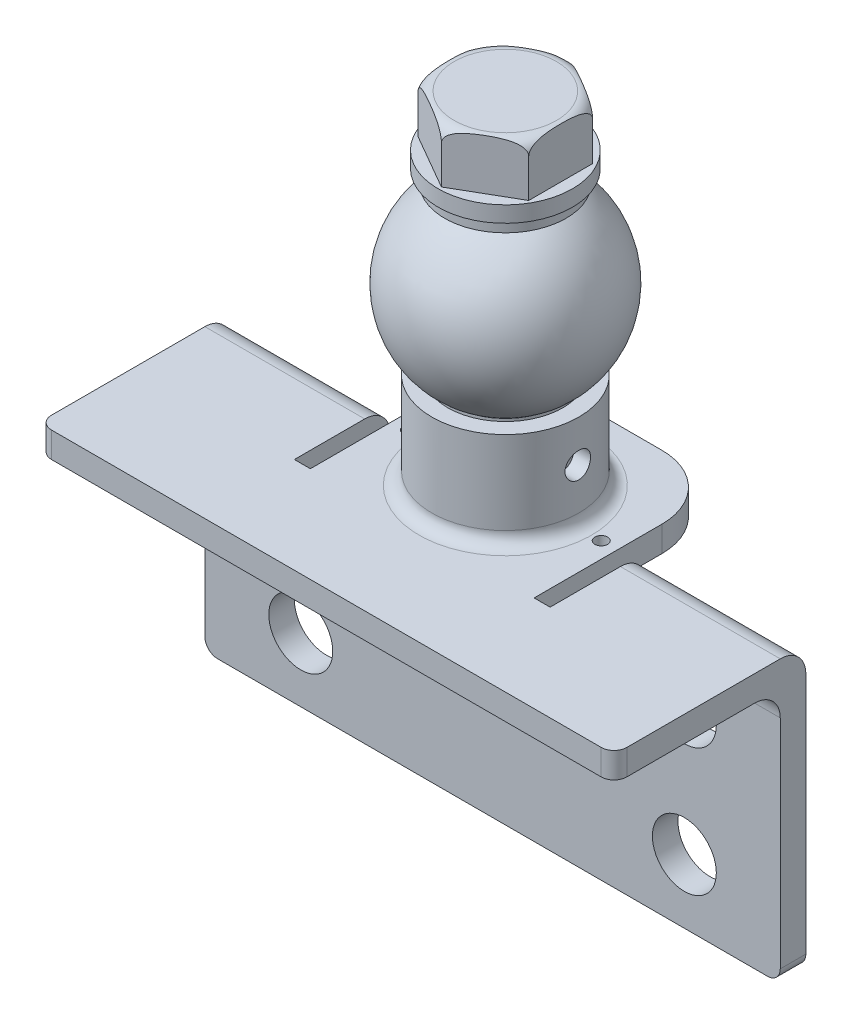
ISO-10303-21;
HEADER;
FILE_DESCRIPTION(('STEP AP214'),'2;1');
FILE_NAME('part.step','',(''),(''),'','','');
FILE_SCHEMA(('AUTOMOTIVE_DESIGN { 1 0 10303 214 1 1 1 1 }'));
ENDSEC;
DATA;
#1=APPLICATION_CONTEXT('core data for automotive mechanical design processes');
#2=APPLICATION_PROTOCOL_DEFINITION('international standard','automotive_design',2000,#1);
#3=PRODUCT_CONTEXT('',#1,'mechanical');
#4=PRODUCT('Part','Part','',(#3));
#5=PRODUCT_RELATED_PRODUCT_CATEGORY('part','',(#4));
#6=PRODUCT_DEFINITION_FORMATION('','',#4);
#7=PRODUCT_DEFINITION_CONTEXT('part definition',#1,'design');
#8=PRODUCT_DEFINITION('design','',#6,#7);
#9=PRODUCT_DEFINITION_SHAPE('','',#8);
#10=(LENGTH_UNIT() NAMED_UNIT(*) SI_UNIT(.MILLI.,.METRE.));
#11=(NAMED_UNIT(*) PLANE_ANGLE_UNIT() SI_UNIT($,.RADIAN.));
#12=(NAMED_UNIT(*) SI_UNIT($,.STERADIAN.) SOLID_ANGLE_UNIT());
#13=UNCERTAINTY_MEASURE_WITH_UNIT(LENGTH_MEASURE(1.E-05),#10,'distance_accuracy_value','');
#14=(GEOMETRIC_REPRESENTATION_CONTEXT(3) GLOBAL_UNCERTAINTY_ASSIGNED_CONTEXT((#13)) GLOBAL_UNIT_ASSIGNED_CONTEXT((#10,
#11,#12)) REPRESENTATION_CONTEXT('',''));
#15=CARTESIAN_POINT('',(0.,0.,0.));
#16=DIRECTION('',(0.,0.,1.));
#17=DIRECTION('',(1.,0.,0.));
#18=AXIS2_PLACEMENT_3D('',#15,#16,#17);
#19=CARTESIAN_POINT('',(0.,84.9177701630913,0.));
#20=DIRECTION('',(0.,-1.,0.));
#21=DIRECTION('',(0.,0.,-1.));
#22=AXIS2_PLACEMENT_3D('',#19,#20,#21);
#23=PLANE('',#22);
#24=CARTESIAN_POINT('',(0.,84.9177701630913,0.));
#25=DIRECTION('',(0.,-1.,0.));
#26=DIRECTION('',(0.,0.,-1.));
#27=AXIS2_PLACEMENT_3D('',#24,#25,#26);
#28=CIRCLE('',#27,9.5);
#29=CARTESIAN_POINT('',(0.,84.9177701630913,-9.5));
#30=VERTEX_POINT('',#29);
#31=EDGE_CURVE('E12',#30,#30,#28,.T.);
#32=ORIENTED_EDGE('',*,*,#31,.T.);
#33=EDGE_LOOP('',(#32));
#34=FACE_BOUND('',#33,.T.);
#35=CARTESIAN_POINT('',(0.,84.9177701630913,0.));
#36=DIRECTION('',(0.,-1.,0.));
#37=DIRECTION('',(0.,0.,-1.));
#38=AXIS2_PLACEMENT_3D('',#35,#36,#37);
#39=CIRCLE('',#38,7.25);
#40=CARTESIAN_POINT('',(0.,84.9177701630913,-7.25));
#41=VERTEX_POINT('',#40);
#42=EDGE_CURVE('E60',#41,#41,#39,.T.);
#43=ORIENTED_EDGE('',*,*,#42,.F.);
#44=EDGE_LOOP('',(#43));
#45=FACE_BOUND('',#44,.T.);
#46=ADVANCED_FACE('F49',(#34,#45),#23,.T.);
#47=CARTESIAN_POINT('',(0.,86.9177701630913,0.));
#48=DIRECTION('',(0.,-1.,0.));
#49=DIRECTION('',(0.,0.,-1.));
#50=AXIS2_PLACEMENT_3D('',#47,#48,#49);
#51=PLANE('',#50);
#52=CARTESIAN_POINT('',(0.,86.9177701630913,0.));
#53=DIRECTION('',(0.,-1.,0.));
#54=DIRECTION('',(0.,0.,-1.));
#55=AXIS2_PLACEMENT_3D('',#52,#53,#54);
#56=CIRCLE('',#55,9.5);
#57=CARTESIAN_POINT('',(0.,86.9177701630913,-9.5));
#58=VERTEX_POINT('',#57);
#59=EDGE_CURVE('E53',#58,#58,#56,.T.);
#60=ORIENTED_EDGE('',*,*,#59,.F.);
#61=EDGE_LOOP('',(#60));
#62=FACE_BOUND('',#61,.T.);
#63=CARTESIAN_POINT('',(0.,86.9177701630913,0.));
#64=DIRECTION('',(0.,-1.,0.));
#65=DIRECTION('',(0.,0.,-1.));
#66=AXIS2_PLACEMENT_3D('',#63,#64,#65);
#67=CIRCLE('',#66,7.25);
#68=CARTESIAN_POINT('',(0.,86.9177701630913,-7.25));
#69=VERTEX_POINT('',#68);
#70=EDGE_CURVE('E62',#69,#69,#67,.T.);
#71=ORIENTED_EDGE('',*,*,#70,.T.);
#72=EDGE_LOOP('',(#71));
#73=FACE_BOUND('',#72,.T.);
#74=ADVANCED_FACE('F72',(#62,#73),#51,.F.);
#75=CARTESIAN_POINT('',(0.,84.9177701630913,0.));
#76=DIRECTION('',(0.,1.,0.));
#77=DIRECTION('',(0.,0.,1.));
#78=AXIS2_PLACEMENT_3D('',#75,#76,#77);
#79=CYLINDRICAL_SURFACE('',#78,9.5);
#80=ORIENTED_EDGE('',*,*,#31,.F.);
#81=EDGE_LOOP('',(#80));
#82=FACE_BOUND('',#81,.T.);
#83=ORIENTED_EDGE('',*,*,#59,.T.);
#84=EDGE_LOOP('',(#83));
#85=FACE_BOUND('',#84,.T.);
#86=ADVANCED_FACE('F51',(#82,#85),#79,.T.);
#87=CARTESIAN_POINT('',(0.,84.9177701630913,0.));
#88=DIRECTION('',(0.,1.,0.));
#89=DIRECTION('',(0.,0.,1.));
#90=AXIS2_PLACEMENT_3D('',#87,#88,#89);
#91=CYLINDRICAL_SURFACE('',#90,7.25);
#92=ORIENTED_EDGE('',*,*,#42,.T.);
#93=EDGE_LOOP('',(#92));
#94=FACE_BOUND('',#93,.T.);
#95=ORIENTED_EDGE('',*,*,#70,.F.);
#96=EDGE_LOOP('',(#95));
#97=FACE_BOUND('',#96,.T.);
#98=ADVANCED_FACE('F68',(#94,#97),#91,.F.);
#99=CLOSED_SHELL('',(#46,#74,#86,#98));
#100=MANIFOLD_SOLID_BREP('B2',#99);
#101=CARTESIAN_POINT('',(0.,86.9177701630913,0.));
#102=DIRECTION('',(0.,1.,0.));
#103=DIRECTION('',(0.,0.,1.));
#104=AXIS2_PLACEMENT_3D('',#101,#102,#103);
#105=CYLINDRICAL_SURFACE('',#104,7.25);
#106=CARTESIAN_POINT('',(0.,89.4177701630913,0.));
#107=DIRECTION('',(0.,1.,0.));
#108=DIRECTION('',(0.,0.,-1.));
#109=AXIS2_PLACEMENT_3D('',#106,#107,#108);
#110=CIRCLE('',#109,7.25);
#111=CARTESIAN_POINT('',(1.59786442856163,89.4177701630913,-7.07172745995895));
#112=VERTEX_POINT('',#111);
#113=CARTESIAN_POINT('',(2.47663303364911,89.4177701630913,-6.81386739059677));
#114=VERTEX_POINT('',#113);
#115=EDGE_CURVE('E184',#112,#114,#110,.T.);
#116=ORIENTED_EDGE('',*,*,#115,.T.);
#117=DIRECTION('',(0.,1.,0.));
#118=VECTOR('',#117,1.);
#119=CARTESIAN_POINT('',(2.47663303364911,86.9177701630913,-6.81386739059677));
#120=LINE('',#119,#118);
#121=CARTESIAN_POINT('',(2.47663303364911,86.9177701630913,-6.81386739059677));
#122=VERTEX_POINT('',#121);
#123=EDGE_CURVE('E47',#122,#114,#120,.T.);
#124=ORIENTED_EDGE('',*,*,#123,.F.);
#125=CARTESIAN_POINT('',(0.,86.9177701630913,0.));
#126=DIRECTION('',(0.,1.,0.));
#127=DIRECTION('',(0.,0.,-1.));
#128=AXIS2_PLACEMENT_3D('',#125,#126,#127);
#129=CIRCLE('',#128,7.25);
#130=CARTESIAN_POINT('',(1.59786442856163,86.9177701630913,-7.07172745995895));
#131=VERTEX_POINT('',#130);
#132=EDGE_CURVE('E172',#131,#122,#129,.T.);
#133=ORIENTED_EDGE('',*,*,#132,.F.);
#134=DIRECTION('',(0.,1.,0.));
#135=VECTOR('',#134,1.);
#136=CARTESIAN_POINT('',(1.59786442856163,86.9177701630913,-7.07172745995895));
#137=LINE('',#136,#135);
#138=EDGE_CURVE('E180',#131,#112,#137,.T.);
#139=ORIENTED_EDGE('',*,*,#138,.T.);
#140=EDGE_LOOP('',(#116,#124,#133,#139));
#141=FACE_BOUND('',#140,.T.);
#142=ADVANCED_FACE('F121',(#141),#105,.F.);
#143=CARTESIAN_POINT('',(2.47663303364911,86.9177701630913,-6.81386739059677));
#144=DIRECTION('',(0.939843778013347,0.,0.341604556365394));
#145=DIRECTION('',(0.341604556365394,0.,-0.939843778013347));
#146=AXIS2_PLACEMENT_3D('',#143,#144,#145);
#147=PLANE('',#146);
#148=DIRECTION('',(0.341604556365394,0.,-0.939843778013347));
#149=VECTOR('',#148,1.);
#150=CARTESIAN_POINT('',(2.47663303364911,89.4177701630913,-6.81386739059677));
#151=LINE('',#150,#149);
#152=CARTESIAN_POINT('',(3.58684784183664,89.4177701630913,-9.86835966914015));
#153=VERTEX_POINT('',#152);
#154=EDGE_CURVE('E176',#114,#153,#151,.T.);
#155=ORIENTED_EDGE('',*,*,#154,.T.);
#156=DIRECTION('',(0.,1.,0.));
#157=VECTOR('',#156,1.);
#158=CARTESIAN_POINT('',(3.58684784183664,86.9177701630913,-9.86835966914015));
#159=LINE('',#158,#157);
#160=CARTESIAN_POINT('',(3.58684784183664,86.9177701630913,-9.86835966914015));
#161=VERTEX_POINT('',#160);
#162=EDGE_CURVE('E129',#161,#153,#159,.T.);
#163=ORIENTED_EDGE('',*,*,#162,.F.);
#164=DIRECTION('',(0.341604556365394,0.,-0.939843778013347));
#165=VECTOR('',#164,1.);
#166=CARTESIAN_POINT('',(2.47663303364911,86.9177701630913,-6.81386739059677));
#167=LINE('',#166,#165);
#168=EDGE_CURVE('E167',#122,#161,#167,.T.);
#169=ORIENTED_EDGE('',*,*,#168,.F.);
#170=ORIENTED_EDGE('',*,*,#123,.T.);
#171=EDGE_LOOP('',(#155,#163,#169,#170));
#172=FACE_BOUND('',#171,.T.);
#173=ADVANCED_FACE('F175',(#172),#147,.F.);
#174=CARTESIAN_POINT('',(0.,86.9177701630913,0.));
#175=DIRECTION('',(0.,1.,0.));
#176=DIRECTION('',(0.,0.,1.));
#177=AXIS2_PLACEMENT_3D('',#174,#175,#176);
#178=CYLINDRICAL_SURFACE('',#177,10.5);
#179=CARTESIAN_POINT('',(0.,89.4177701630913,0.));
#180=DIRECTION('',(0.,-1.,0.));
#181=DIRECTION('',(0.,0.,-1.));
#182=AXIS2_PLACEMENT_3D('',#179,#180,#181);
#183=CIRCLE('',#182,10.5);
#184=CARTESIAN_POINT('',(2.31414848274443,89.4177701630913,-10.2418121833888));
#185=VERTEX_POINT('',#184);
#186=EDGE_CURVE('E154',#153,#185,#183,.T.);
#187=ORIENTED_EDGE('',*,*,#186,.T.);
#188=DIRECTION('',(0.,1.,0.));
#189=VECTOR('',#188,1.);
#190=CARTESIAN_POINT('',(2.31414848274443,86.9177701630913,-10.2418121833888));
#191=LINE('',#190,#189);
#192=CARTESIAN_POINT('',(2.31414848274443,86.9177701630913,-10.2418121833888));
#193=VERTEX_POINT('',#192);
#194=EDGE_CURVE('E177',#193,#185,#191,.T.);
#195=ORIENTED_EDGE('',*,*,#194,.F.);
#196=CARTESIAN_POINT('',(0.,86.9177701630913,0.));
#197=DIRECTION('',(0.,-1.,0.));
#198=DIRECTION('',(0.,0.,-1.));
#199=AXIS2_PLACEMENT_3D('',#196,#197,#198);
#200=CIRCLE('',#199,10.5);
#201=EDGE_CURVE('E170',#161,#193,#200,.T.);
#202=ORIENTED_EDGE('',*,*,#201,.F.);
#203=ORIENTED_EDGE('',*,*,#162,.T.);
#204=EDGE_LOOP('',(#187,#195,#202,#203));
#205=FACE_BOUND('',#204,.T.);
#206=ADVANCED_FACE('F178',(#205),#178,.T.);
#207=CARTESIAN_POINT('',(1.59786442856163,86.9177701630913,-7.07172745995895));
#208=DIRECTION('',(-0.975410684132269,0.,-0.220395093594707));
#209=DIRECTION('',(-0.220395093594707,0.,0.975410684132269));
#210=AXIS2_PLACEMENT_3D('',#207,#208,#209);
#211=PLANE('',#210);
#212=DIRECTION('',(-0.220395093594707,0.,0.975410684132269));
#213=VECTOR('',#212,1.);
#214=CARTESIAN_POINT('',(1.59786442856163,89.4177701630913,-7.07172745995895));
#215=LINE('',#214,#213);
#216=EDGE_CURVE('E160',#185,#112,#215,.T.);
#217=ORIENTED_EDGE('',*,*,#216,.T.);
#218=ORIENTED_EDGE('',*,*,#138,.F.);
#219=DIRECTION('',(-0.220395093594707,0.,0.975410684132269));
#220=VECTOR('',#219,1.);
#221=CARTESIAN_POINT('',(1.59786442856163,86.9177701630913,-7.07172745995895));
#222=LINE('',#221,#220);
#223=EDGE_CURVE('E137',#193,#131,#222,.T.);
#224=ORIENTED_EDGE('',*,*,#223,.F.);
#225=ORIENTED_EDGE('',*,*,#194,.T.);
#226=EDGE_LOOP('',(#217,#218,#224,#225));
#227=FACE_BOUND('',#226,.T.);
#228=ADVANCED_FACE('F191',(#227),#211,.F.);
#229=CARTESIAN_POINT('',(0.,86.9177701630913,0.));
#230=DIRECTION('',(0.,-1.,0.));
#231=DIRECTION('',(0.,0.,-1.));
#232=AXIS2_PLACEMENT_3D('',#229,#230,#231);
#233=PLANE('',#232);
#234=ORIENTED_EDGE('',*,*,#132,.T.);
#235=ORIENTED_EDGE('',*,*,#168,.T.);
#236=ORIENTED_EDGE('',*,*,#201,.T.);
#237=ORIENTED_EDGE('',*,*,#223,.T.);
#238=EDGE_LOOP('',(#234,#235,#236,#237));
#239=FACE_BOUND('',#238,.T.);
#240=ADVANCED_FACE('F168',(#239),#233,.T.);
#241=CARTESIAN_POINT('',(0.,89.4177701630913,0.));
#242=DIRECTION('',(0.,-1.,0.));
#243=DIRECTION('',(0.,0.,-1.));
#244=AXIS2_PLACEMENT_3D('',#241,#242,#243);
#245=PLANE('',#244);
#246=ORIENTED_EDGE('',*,*,#115,.F.);
#247=ORIENTED_EDGE('',*,*,#216,.F.);
#248=ORIENTED_EDGE('',*,*,#186,.F.);
#249=ORIENTED_EDGE('',*,*,#154,.F.);
#250=EDGE_LOOP('',(#246,#247,#248,#249));
#251=FACE_BOUND('',#250,.T.);
#252=ADVANCED_FACE('F194',(#251),#245,.F.);
#253=CLOSED_SHELL('',(#142,#173,#206,#228,#240,#252));
#254=MANIFOLD_SOLID_BREP('B7',#253);
#255=CARTESIAN_POINT('',(-7.,89.4177701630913,0.));
#256=DIRECTION('',(0.,1.,0.));
#257=DIRECTION('',(0.,0.,1.));
#258=AXIS2_PLACEMENT_3D('',#255,#256,#257);
#259=PLANE('',#258);
#260=CARTESIAN_POINT('',(0.,89.4177701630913,0.));
#261=DIRECTION('',(0.,-1.,0.));
#262=DIRECTION('',(0.,0.,-1.));
#263=AXIS2_PLACEMENT_3D('',#260,#261,#262);
#264=CIRCLE('',#263,7.);
#265=CARTESIAN_POINT('',(0.,89.4177701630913,-7.));
#266=VERTEX_POINT('',#265);
#267=EDGE_CURVE('E392',#266,#266,#264,.T.);
#268=ORIENTED_EDGE('',*,*,#267,.F.);
#269=EDGE_LOOP('',(#268));
#270=FACE_BOUND('',#269,.T.);
#271=DIRECTION('',(-0.866025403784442,0.,0.499999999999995));
#272=VECTOR('',#271,1.);
#273=CARTESIAN_POINT('',(-9.5801270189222,89.4177701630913,-4.46891108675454));
#274=LINE('',#273,#272);
#275=CARTESIAN_POINT('',(0.,89.4177701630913,-10.));
#276=VERTEX_POINT('',#275);
#277=CARTESIAN_POINT('',(-8.66025403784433,89.4177701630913,-5.0000000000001));
#278=VERTEX_POINT('',#277);
#279=EDGE_CURVE('E119',#276,#278,#274,.T.);
#280=ORIENTED_EDGE('',*,*,#279,.F.);
#281=DIRECTION('',(-0.866025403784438,0.,-0.500000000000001));
#282=VECTOR('',#281,1.);
#283=CARTESIAN_POINT('',(-0.919872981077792,89.4177701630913,-10.5310889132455));
#284=LINE('',#283,#282);
#285=CARTESIAN_POINT('',(8.6602540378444,89.4177701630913,-4.99999999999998));
#286=VERTEX_POINT('',#285);
#287=EDGE_CURVE('E261',#286,#276,#284,.T.);
#288=ORIENTED_EDGE('',*,*,#287,.F.);
#289=DIRECTION('',(0.,0.,-1.));
#290=VECTOR('',#289,1.);
#291=CARTESIAN_POINT('',(8.66025403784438,89.4177701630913,0.));
#292=LINE('',#291,#290);
#293=CARTESIAN_POINT('',(8.66025403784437,89.4177701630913,5.00000000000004));
#294=VERTEX_POINT('',#293);
#295=EDGE_CURVE('E323',#294,#286,#292,.T.);
#296=ORIENTED_EDGE('',*,*,#295,.F.);
#297=DIRECTION('',(0.866025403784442,0.,-0.499999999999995));
#298=VECTOR('',#297,1.);
#299=CARTESIAN_POINT('',(-0.91987298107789,89.4177701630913,10.5310889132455));
#300=LINE('',#299,#298);
#301=CARTESIAN_POINT('',(0.,89.4177701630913,10.));
#302=VERTEX_POINT('',#301);
#303=EDGE_CURVE('E321',#302,#294,#300,.T.);
#304=ORIENTED_EDGE('',*,*,#303,.F.);
#305=DIRECTION('',(0.866025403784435,0.,0.500000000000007));
#306=VECTOR('',#305,1.);
#307=CARTESIAN_POINT('',(-9.5801270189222,89.4177701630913,4.4689110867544));
#308=LINE('',#307,#306);
#309=CARTESIAN_POINT('',(-8.66025403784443,89.4177701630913,4.99999999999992));
#310=VERTEX_POINT('',#309);
#311=EDGE_CURVE('E307',#310,#302,#308,.T.);
#312=ORIENTED_EDGE('',*,*,#311,.F.);
#313=DIRECTION('',(0.,0.,1.));
#314=VECTOR('',#313,1.);
#315=CARTESIAN_POINT('',(-8.66025403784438,89.4177701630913,0.));
#316=LINE('',#315,#314);
#317=EDGE_CURVE('E302',#278,#310,#316,.T.);
#318=ORIENTED_EDGE('',*,*,#317,.F.);
#319=EDGE_LOOP('',(#280,#288,#296,#304,#312,#318));
#320=FACE_BOUND('',#319,.T.);
#321=ADVANCED_FACE('F253',(#270,#320),#259,.F.);
#322=CARTESIAN_POINT('',(-7.,71.,0.));
#323=DIRECTION('',(0.,1.,0.));
#324=DIRECTION('',(0.,0.,1.));
#325=AXIS2_PLACEMENT_3D('',#322,#323,#324);
#326=PLANE('',#325);
#327=CARTESIAN_POINT('',(0.,71.,0.));
#328=DIRECTION('',(0.,-1.,0.));
#329=DIRECTION('',(0.,0.,-1.));
#330=AXIS2_PLACEMENT_3D('',#327,#328,#329);
#331=CIRCLE('',#330,7.);
#332=CARTESIAN_POINT('',(0.,71.,-7.));
#333=VERTEX_POINT('',#332);
#334=EDGE_CURVE('E382',#333,#333,#331,.T.);
#335=ORIENTED_EDGE('',*,*,#334,.T.);
#336=EDGE_LOOP('',(#335));
#337=FACE_BOUND('',#336,.T.);
#338=ADVANCED_FACE('F255',(#337),#326,.F.);
#339=CARTESIAN_POINT('',(0.,71.,0.));
#340=DIRECTION('',(0.,-1.,0.));
#341=DIRECTION('',(0.,0.,-1.));
#342=AXIS2_PLACEMENT_3D('',#339,#340,#341);
#343=CYLINDRICAL_SURFACE('',#342,7.);
#344=ORIENTED_EDGE('',*,*,#334,.F.);
#345=EDGE_LOOP('',(#344));
#346=FACE_BOUND('',#345,.T.);
#347=ORIENTED_EDGE('',*,*,#267,.T.);
#348=EDGE_LOOP('',(#347));
#349=FACE_BOUND('',#348,.T.);
#350=ADVANCED_FACE('F374',(#346,#349),#343,.T.);
#351=CARTESIAN_POINT('',(-8.66025403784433,86.9177701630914,-5.0000000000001));
#352=DIRECTION('',(-0.499999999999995,0.,-0.866025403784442));
#353=DIRECTION('',(-0.866025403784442,0.,0.499999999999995));
#354=AXIS2_PLACEMENT_3D('',#351,#352,#353);
#355=PLANE('',#354);
#356=CARTESIAN_POINT('',(-8.66025402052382,95.4175701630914,-5.0000000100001));
#357=CARTESIAN_POINT('',(-8.6602640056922,95.4473351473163,-4.99999424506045));
#358=CARTESIAN_POINT('',(-8.65911248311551,95.4770841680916,-5.00065907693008));
#359=CARTESIAN_POINT('',(-8.65454026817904,95.5363278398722,-5.00329884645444));
#360=CARTESIAN_POINT('',(-8.65112120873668,95.5658226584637,-5.00527284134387));
#361=CARTESIAN_POINT('',(-8.63762033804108,95.6531428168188,-5.01306757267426));
#362=CARTESIAN_POINT('',(-8.62429280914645,95.7103331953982,-5.02076222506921));
#363=CARTESIAN_POINT('',(-8.59000445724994,95.8213234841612,-5.04055861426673));
#364=CARTESIAN_POINT('',(-8.56906328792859,95.8751317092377,-5.05264900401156));
#365=CARTESIAN_POINT('',(-8.52079005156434,95.9788673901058,-5.08051957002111));
#366=CARTESIAN_POINT('',(-8.49344419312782,96.028786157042,-5.09630770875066));
#367=CARTESIAN_POINT('',(-8.41543002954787,96.1534226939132,-5.14134920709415));
#368=CARTESIAN_POINT('',(-8.36069667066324,96.2247426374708,-5.17294952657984));
#369=CARTESIAN_POINT('',(-8.24229770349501,96.3566643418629,-5.24130720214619));
#370=CARTESIAN_POINT('',(-8.17861039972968,96.4172392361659,-5.27807708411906));
#371=CARTESIAN_POINT('',(-8.05580807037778,96.520021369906,-5.34897704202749));
#372=CARTESIAN_POINT('',(-7.99754847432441,96.5636190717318,-5.38261323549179));
#373=CARTESIAN_POINT('',(-7.87796038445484,96.6448509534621,-5.45165745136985));
#374=CARTESIAN_POINT('',(-7.81662959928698,96.6824805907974,-5.48706679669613));
#375=CARTESIAN_POINT('',(-7.69167257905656,96.7525651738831,-5.5592107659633));
#376=CARTESIAN_POINT('',(-7.62804229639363,96.7850103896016,-5.59594772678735));
#377=CARTESIAN_POINT('',(-7.49921290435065,96.8453130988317,-5.6703274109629));
#378=CARTESIAN_POINT('',(-7.43401432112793,96.8731721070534,-5.70796983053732));
#379=CARTESIAN_POINT('',(-7.27506664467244,96.9356886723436,-5.79973831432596));
#380=CARTESIAN_POINT('',(-7.18073027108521,96.968348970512,-5.85420344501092));
#381=CARTESIAN_POINT('',(-6.99052379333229,97.0271334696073,-5.96401920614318));
#382=CARTESIAN_POINT('',(-6.89465291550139,97.0532542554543,-6.01937028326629));
#383=CARTESIAN_POINT('',(-6.70176470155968,97.1001405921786,-6.13073434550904));
#384=CARTESIAN_POINT('',(-6.60474559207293,97.1208962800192,-6.18674835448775));
#385=CARTESIAN_POINT('',(-6.41006252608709,97.1579468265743,-6.29914867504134));
#386=CARTESIAN_POINT('',(-6.3123984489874,97.1742408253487,-6.355535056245));
#387=CARTESIAN_POINT('',(-6.11623976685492,97.2032081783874,-6.46878732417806));
#388=CARTESIAN_POINT('',(-6.01774339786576,97.2158653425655,-6.52565422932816));
#389=CARTESIAN_POINT('',(-5.82048701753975,97.2381096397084,-6.63954025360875));
#390=CARTESIAN_POINT('',(-5.72172698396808,97.2476965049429,-6.69655938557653));
#391=CARTESIAN_POINT('',(-5.52415488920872,97.2643077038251,-6.8106276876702));
#392=CARTESIAN_POINT('',(-5.42534299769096,97.2713347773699,-6.86767675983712));
#393=CARTESIAN_POINT('',(-5.22762129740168,97.2832397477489,-6.98183143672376));
#394=CARTESIAN_POINT('',(-5.12871148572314,97.2881175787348,-7.03893704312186));
#395=CARTESIAN_POINT('',(-4.892318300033,97.2975605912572,-7.17541871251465));
#396=CARTESIAN_POINT('',(-4.75480918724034,97.3012647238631,-7.25480963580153));
#397=CARTESIAN_POINT('',(-4.47975702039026,97.3055593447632,-7.4136110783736));
#398=CARTESIAN_POINT('',(-4.34221396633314,97.306149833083,-7.49302159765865));
#399=CARTESIAN_POINT('',(-4.06752576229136,97.3042909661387,-7.65161290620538));
#400=CARTESIAN_POINT('',(-3.93038057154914,97.301850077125,-7.73079371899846));
#401=CARTESIAN_POINT('',(-3.65617029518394,97.2936443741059,-7.88910909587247));
#402=CARTESIAN_POINT('',(-3.51910520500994,97.2878797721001,-7.96824366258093));
#403=CARTESIAN_POINT('',(-3.25321541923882,97.2728044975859,-8.12175520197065));
#404=CARTESIAN_POINT('',(-3.12438126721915,97.2637228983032,-8.19613763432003));
#405=CARTESIAN_POINT('',(-2.86697883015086,97.2411264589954,-8.34474900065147));
#406=CARTESIAN_POINT('',(-2.73841058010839,97.2276110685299,-8.41897791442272));
#407=CARTESIAN_POINT('',(-2.48162626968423,97.1949029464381,-8.56723240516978));
#408=CARTESIAN_POINT('',(-2.35341092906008,97.1757024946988,-8.64125756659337));
#409=CARTESIAN_POINT('',(-2.09795986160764,97.1300204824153,-8.78874230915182));
#410=CARTESIAN_POINT('',(-1.97072383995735,97.1035412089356,-8.86220206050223));
#411=CARTESIAN_POINT('',(-1.75978325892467,97.0515016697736,-8.98398866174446));
#412=CARTESIAN_POINT('',(-1.6756014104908,97.0285348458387,-9.03259107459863));
#413=CARTESIAN_POINT('',(-1.50838635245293,96.9776045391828,-9.12913273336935));
#414=CARTESIAN_POINT('',(-1.42535284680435,96.9496423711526,-9.17707215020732));
#415=CARTESIAN_POINT('',(-1.26111426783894,96.8878485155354,-9.27189533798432));
#416=CARTESIAN_POINT('',(-1.17990566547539,96.8540295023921,-9.31878114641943));
#417=CARTESIAN_POINT('',(-1.01996750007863,96.7793882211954,-9.41112148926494));
#418=CARTESIAN_POINT('',(-0.941236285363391,96.7385707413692,-9.45657697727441));
#419=CARTESIAN_POINT('',(-0.783062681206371,96.6460807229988,-9.54789855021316));
#420=CARTESIAN_POINT('',(-0.703827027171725,96.5939285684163,-9.59364527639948));
#421=CARTESIAN_POINT('',(-0.551530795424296,96.4785245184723,-9.68157354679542));
#422=CARTESIAN_POINT('',(-0.47846756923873,96.4152774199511,-9.72375662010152));
#423=CARTESIAN_POINT('',(-0.356555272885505,96.2907625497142,-9.79414271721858));
#424=CARTESIAN_POINT('',(-0.305860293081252,96.2319314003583,-9.82341147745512));
#425=CARTESIAN_POINT('',(-0.213073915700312,96.1057641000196,-9.87698171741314));
#426=CARTESIAN_POINT('',(-0.170968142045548,96.0384424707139,-9.90129149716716));
#427=CARTESIAN_POINT('',(-0.107590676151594,95.9133749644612,-9.93788249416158));
#428=CARTESIAN_POINT('',(-0.083741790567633,95.857378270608,-9.95165165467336));
#429=CARTESIAN_POINT('',(-0.044348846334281,95.741656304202,-9.97439518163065));
#430=CARTESIAN_POINT('',(-0.0287854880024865,95.681940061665,-9.98338069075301));
#431=CARTESIAN_POINT('',(-0.012040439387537,95.5876874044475,-9.99304844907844));
#432=CARTESIAN_POINT('',(-0.00753866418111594,95.5539061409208,-9.9956475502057));
#433=CARTESIAN_POINT('',(-0.00150864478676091,95.48594792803,-9.99912898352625));
#434=CARTESIAN_POINT('',(1.56760291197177E-05,95.4517705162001,-10.0000090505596));
#435=CARTESIAN_POINT('',(-1.73205086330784E-08,95.4175701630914,-9.99999999));
#436=B_SPLINE_CURVE_WITH_KNOTS('',3,(#356,#357,#358,#359,#360,#361,#362,#363,#364,#365,#366,
#367,#368,#369,#370,#371,#372,#373,#374,#375,#376,#377,#378,#379,#380,#381,#382,#383,#384,#385,
#386,#387,#388,#389,#390,#391,#392,#393,#394,#395,#396,#397,#398,#399,#400,#401,#402,#403,#404,
#405,#406,#407,#408,#409,#410,#411,#412,#413,#414,#415,#416,#417,#418,#419,#420,#421,#422,#423,
#424,#425,#426,#427,#428,#429,#430,#431,#432,#433,#434,#435),.UNSPECIFIED.,.F.,.F.,(4,2,2,2,2,2,
2,2,2,2,2,2,2,2,2,2,2,2,2,2,2,2,2,2,2,2,2,2,2,2,2,2,2,2,2,2,2,2,2,4),(0.,0.0892343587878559,
0.17840452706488,0.355178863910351,0.53150008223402,0.70820452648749,0.992455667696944,
1.27740781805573,1.51755882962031,1.75789176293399,1.99867058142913,2.23936971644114,
2.5802626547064,2.92133324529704,3.26302646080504,3.60478548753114,3.9480431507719,
4.29133073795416,4.63424979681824,4.97717936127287,5.45361785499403,5.93005634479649,
6.40516718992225,6.88024773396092,7.32732230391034,7.77445239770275,8.22219248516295,
8.66979204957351,8.96932948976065,9.26878821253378,9.56760681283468,9.86622177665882,
10.1815466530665,10.4967355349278,10.7449312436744,10.9927080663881,11.1792090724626,
11.3652737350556,11.4676514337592,11.5701639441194),.UNSPECIFIED.);
#437=CARTESIAN_POINT('',(-8.66025403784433,95.4177701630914,-5.0000000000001));
#438=VERTEX_POINT('',#437);
#439=CARTESIAN_POINT('',(0.,95.4177701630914,-10.));
#440=VERTEX_POINT('',#439);
#441=EDGE_CURVE('E340',#438,#440,#436,.T.);
#442=ORIENTED_EDGE('',*,*,#441,.T.);
#443=DIRECTION('',(0.,1.,0.));
#444=VECTOR('',#443,1.);
#445=CARTESIAN_POINT('',(0.,86.9177701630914,-10.));
#446=LINE('',#445,#444);
#447=EDGE_CURVE('E333',#276,#440,#446,.T.);
#448=ORIENTED_EDGE('',*,*,#447,.F.);
#449=ORIENTED_EDGE('',*,*,#279,.T.);
#450=DIRECTION('',(0.,1.,0.));
#451=VECTOR('',#450,1.);
#452=CARTESIAN_POINT('',(-8.66025403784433,86.9177701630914,-5.0000000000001));
#453=LINE('',#452,#451);
#454=EDGE_CURVE('E273',#278,#438,#453,.T.);
#455=ORIENTED_EDGE('',*,*,#454,.T.);
#456=EDGE_LOOP('',(#442,#448,#449,#455));
#457=FACE_BOUND('',#456,.T.);
#458=ADVANCED_FACE('F338',(#457),#355,.T.);
#459=CARTESIAN_POINT('',(0.,86.9177701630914,-10.));
#460=DIRECTION('',(0.500000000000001,0.,-0.866025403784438));
#461=DIRECTION('',(-0.866025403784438,0.,-0.500000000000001));
#462=AXIS2_PLACEMENT_3D('',#459,#460,#461);
#463=PLANE('',#462);
#464=CARTESIAN_POINT('',(1.73205065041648E-08,95.4175701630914,-9.99999999));
#465=CARTESIAN_POINT('',(-9.96784787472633E-06,95.4473351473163,-10.0000057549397));
#466=CARTESIAN_POINT('',(0.00114155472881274,95.4770841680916,-9.99934092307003));
#467=CARTESIAN_POINT('',(0.00571376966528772,95.5363278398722,-9.99670115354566));
#468=CARTESIAN_POINT('',(0.00913282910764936,95.5658226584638,-9.99472715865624));
#469=CARTESIAN_POINT('',(0.0226336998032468,95.6531428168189,-9.98693242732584));
#470=CARTESIAN_POINT('',(0.035961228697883,95.7103331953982,-9.97923777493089));
#471=CARTESIAN_POINT('',(0.0702495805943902,95.8213234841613,-9.95944138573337));
#472=CARTESIAN_POINT('',(0.0911907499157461,95.8751317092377,-9.94735099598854));
#473=CARTESIAN_POINT('',(0.139463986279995,95.9788673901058,-9.91948042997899));
#474=CARTESIAN_POINT('',(0.166809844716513,96.028786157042,-9.90369229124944));
#475=CARTESIAN_POINT('',(0.24482400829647,96.1534226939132,-9.85865079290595));
#476=CARTESIAN_POINT('',(0.299557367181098,96.2247426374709,-9.82705047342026));
#477=CARTESIAN_POINT('',(0.417956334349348,96.3566643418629,-9.75869279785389));
#478=CARTESIAN_POINT('',(0.481643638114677,96.4172392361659,-9.72192291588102));
#479=CARTESIAN_POINT('',(0.604445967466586,96.520021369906,-9.65102295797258));
#480=CARTESIAN_POINT('',(0.662705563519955,96.5636190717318,-9.61738676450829));
#481=CARTESIAN_POINT('',(0.782293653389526,96.6448509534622,-9.54834254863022));
#482=CARTESIAN_POINT('',(0.843624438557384,96.6824805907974,-9.51293320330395));
#483=CARTESIAN_POINT('',(0.968581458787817,96.7525651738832,-9.44078923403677));
#484=CARTESIAN_POINT('',(1.03221174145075,96.7850103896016,-9.40405227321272));
#485=CARTESIAN_POINT('',(1.16104113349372,96.8453130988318,-9.32967258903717));
#486=CARTESIAN_POINT('',(1.22623971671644,96.8731721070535,-9.29203016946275));
#487=CARTESIAN_POINT('',(1.38518739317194,96.9356886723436,-9.2002616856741));
#488=CARTESIAN_POINT('',(1.47952376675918,96.968348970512,-9.14579655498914));
#489=CARTESIAN_POINT('',(1.66973024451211,97.0271334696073,-9.03598079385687));
#490=CARTESIAN_POINT('',(1.76560112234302,97.0532542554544,-8.98062971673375));
#491=CARTESIAN_POINT('',(1.95848933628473,97.1001405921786,-8.869265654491));
#492=CARTESIAN_POINT('',(2.05550844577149,97.1208962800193,-8.81325164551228));
#493=CARTESIAN_POINT('',(2.25019151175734,97.1579468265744,-8.70085132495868));
#494=CARTESIAN_POINT('',(2.34785558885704,97.1742408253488,-8.64446494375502));
#495=CARTESIAN_POINT('',(2.54401427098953,97.2032081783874,-8.53121267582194));
#496=CARTESIAN_POINT('',(2.6425106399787,97.2158653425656,-8.47434577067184));
#497=CARTESIAN_POINT('',(2.83976702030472,97.2381096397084,-8.36045974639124));
#498=CARTESIAN_POINT('',(2.9385270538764,97.2476965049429,-8.30344061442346));
#499=CARTESIAN_POINT('',(3.13609914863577,97.2643077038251,-8.18937231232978));
#500=CARTESIAN_POINT('',(3.23491104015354,97.2713347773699,-8.13232324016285));
#501=CARTESIAN_POINT('',(3.43263274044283,97.2832397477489,-8.0181685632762));
#502=CARTESIAN_POINT('',(3.53154255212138,97.2881175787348,-7.9610629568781));
#503=CARTESIAN_POINT('',(3.76793573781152,97.2975605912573,-7.8245812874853));
#504=CARTESIAN_POINT('',(3.90544485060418,97.3012647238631,-7.74519036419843));
#505=CARTESIAN_POINT('',(4.18049701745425,97.3055593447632,-7.58638892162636));
#506=CARTESIAN_POINT('',(4.31804007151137,97.306149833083,-7.50697840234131));
#507=CARTESIAN_POINT('',(4.59272827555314,97.3042909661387,-7.34838709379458));
#508=CARTESIAN_POINT('',(4.72987346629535,97.301850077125,-7.2692062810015));
#509=CARTESIAN_POINT('',(5.00408374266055,97.2936443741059,-7.1108909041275));
#510=CARTESIAN_POINT('',(5.14114883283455,97.2878797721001,-7.03175633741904));
#511=CARTESIAN_POINT('',(5.40703861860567,97.2728044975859,-6.87824479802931));
#512=CARTESIAN_POINT('',(5.53587277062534,97.2637228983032,-6.80386236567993));
#513=CARTESIAN_POINT('',(5.79327520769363,97.2411264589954,-6.65525099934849));
#514=CARTESIAN_POINT('',(5.9218434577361,97.2276110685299,-6.58102208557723));
#515=CARTESIAN_POINT('',(6.17862776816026,97.1949029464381,-6.43276759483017));
#516=CARTESIAN_POINT('',(6.30684310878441,97.1757024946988,-6.35874243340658));
#517=CARTESIAN_POINT('',(6.56229417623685,97.1300204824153,-6.21125769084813));
#518=CARTESIAN_POINT('',(6.68953019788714,97.1035412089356,-6.13779793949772));
#519=CARTESIAN_POINT('',(6.90047077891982,97.0515016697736,-6.01601133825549));
#520=CARTESIAN_POINT('',(6.98465262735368,97.0285348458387,-5.96740892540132));
#521=CARTESIAN_POINT('',(7.15186768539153,96.9776045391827,-5.8708672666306));
#522=CARTESIAN_POINT('',(7.23490119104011,96.9496423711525,-5.82292784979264));
#523=CARTESIAN_POINT('',(7.39913977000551,96.8878485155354,-5.72810466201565));
#524=CARTESIAN_POINT('',(7.48034837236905,96.8540295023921,-5.68121885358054));
#525=CARTESIAN_POINT('',(7.64028653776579,96.7793882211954,-5.58887851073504));
#526=CARTESIAN_POINT('',(7.71901775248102,96.7385707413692,-5.54342302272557));
#527=CARTESIAN_POINT('',(7.87719135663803,96.6460807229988,-5.45210144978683));
#528=CARTESIAN_POINT('',(7.95642701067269,96.5939285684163,-5.4063547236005));
#529=CARTESIAN_POINT('',(8.10872324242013,96.4785245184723,-5.31842645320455));
#530=CARTESIAN_POINT('',(8.1817864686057,96.415277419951,-5.27624337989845));
#531=CARTESIAN_POINT('',(8.30369876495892,96.2907625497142,-5.20585728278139));
#532=CARTESIAN_POINT('',(8.35439374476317,96.2319314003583,-5.17658852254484));
#533=CARTESIAN_POINT('',(8.4471801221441,96.1057641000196,-5.12301828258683));
#534=CARTESIAN_POINT('',(8.48928589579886,96.0384424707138,-5.09870850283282));
#535=CARTESIAN_POINT('',(8.55266336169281,95.9133749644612,-5.0621175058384));
#536=CARTESIAN_POINT('',(8.57651224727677,95.857378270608,-5.04834834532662));
#537=CARTESIAN_POINT('',(8.61590519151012,95.741656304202,-5.02560481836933));
#538=CARTESIAN_POINT('',(8.63146854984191,95.681940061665,-5.01661930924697));
#539=CARTESIAN_POINT('',(8.64821359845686,95.5876874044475,-5.00695155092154));
#540=CARTESIAN_POINT('',(8.65271537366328,95.5539061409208,-5.00435244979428));
#541=CARTESIAN_POINT('',(8.65874539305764,95.48594792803,-5.00087101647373));
#542=CARTESIAN_POINT('',(8.66026971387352,95.4517705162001,-4.99999094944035));
#543=CARTESIAN_POINT('',(8.66025402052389,95.4175701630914,-5.00000000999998));
#544=B_SPLINE_CURVE_WITH_KNOTS('',3,(#464,#465,#466,#467,#468,#469,#470,#471,#472,#473,#474,
#475,#476,#477,#478,#479,#480,#481,#482,#483,#484,#485,#486,#487,#488,#489,#490,#491,#492,#493,
#494,#495,#496,#497,#498,#499,#500,#501,#502,#503,#504,#505,#506,#507,#508,#509,#510,#511,#512,
#513,#514,#515,#516,#517,#518,#519,#520,#521,#522,#523,#524,#525,#526,#527,#528,#529,#530,#531,
#532,#533,#534,#535,#536,#537,#538,#539,#540,#541,#542,#543),.UNSPECIFIED.,.F.,.F.,(4,2,2,2,2,2,
2,2,2,2,2,2,2,2,2,2,2,2,2,2,2,2,2,2,2,2,2,2,2,2,2,2,2,2,2,2,2,2,2,4),(0.,0.0892343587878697,
0.178404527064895,0.355178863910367,0.531500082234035,0.708204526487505,0.992455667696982,
1.27740781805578,1.51755882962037,1.75789176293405,1.99867058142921,2.23936971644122,
2.5802626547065,2.92133324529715,3.26302646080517,3.6047854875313,3.94804315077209,
4.29133073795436,4.63424979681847,4.97717936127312,5.45361785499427,5.93005634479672,
6.40516718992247,6.88024773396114,7.32732230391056,7.77445239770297,8.22219248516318,
8.66979204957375,8.96932948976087,9.26878821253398,9.56760681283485,9.86622177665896,
10.1815466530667,10.4967355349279,10.7449312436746,10.9927080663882,11.1792090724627,
11.3652737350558,11.4676514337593,11.5701639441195),.UNSPECIFIED.);
#545=CARTESIAN_POINT('',(8.6602540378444,95.4177701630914,-4.99999999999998));
#546=VERTEX_POINT('',#545);
#547=EDGE_CURVE('E383',#440,#546,#544,.T.);
#548=ORIENTED_EDGE('',*,*,#547,.T.);
#549=DIRECTION('',(0.,1.,0.));
#550=VECTOR('',#549,1.);
#551=CARTESIAN_POINT('',(8.6602540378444,86.9177701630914,-4.99999999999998));
#552=LINE('',#551,#550);
#553=EDGE_CURVE('E336',#286,#546,#552,.T.);
#554=ORIENTED_EDGE('',*,*,#553,.F.);
#555=ORIENTED_EDGE('',*,*,#287,.T.);
#556=ORIENTED_EDGE('',*,*,#447,.T.);
#557=EDGE_LOOP('',(#548,#554,#555,#556));
#558=FACE_BOUND('',#557,.T.);
#559=ADVANCED_FACE('F332',(#558),#463,.T.);
#560=CARTESIAN_POINT('',(8.6602540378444,86.9177701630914,-4.99999999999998));
#561=DIRECTION('',(1.,0.,0.));
#562=DIRECTION('',(0.,0.,-1.));
#563=AXIS2_PLACEMENT_3D('',#560,#561,#562);
#564=PLANE('',#563);
#565=CARTESIAN_POINT('',(8.66025403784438,97.3056432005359,0.));
#566=CARTESIAN_POINT('',(8.66025403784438,97.305642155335,0.122717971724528));
#567=CARTESIAN_POINT('',(8.66025403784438,97.3047362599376,0.245435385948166));
#568=CARTESIAN_POINT('',(8.66025403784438,97.3010431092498,0.490843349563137));
#569=CARTESIAN_POINT('',(8.66025403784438,97.2982558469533,0.613533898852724));
#570=CARTESIAN_POINT('',(8.66025403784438,97.2905969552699,0.858927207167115));
#571=CARTESIAN_POINT('',(8.66025403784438,97.2857240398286,0.981629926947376));
#572=CARTESIAN_POINT('',(8.66025403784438,97.2735536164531,1.22691435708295));
#573=CARTESIAN_POINT('',(8.66025403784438,97.2662561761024,1.34949607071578));
#574=CARTESIAN_POINT('',(8.66025403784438,97.2487245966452,1.59486799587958));
#575=CARTESIAN_POINT('',(8.66025403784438,97.2384806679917,1.71765752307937));
#576=CARTESIAN_POINT('',(8.66025403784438,97.2144247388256,1.96288095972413));
#577=CARTESIAN_POINT('',(8.66025403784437,97.2006131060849,2.08531490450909));
#578=CARTESIAN_POINT('',(8.66025403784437,97.1686273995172,2.3294606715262));
#579=CARTESIAN_POINT('',(8.66025403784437,97.150459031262,2.45117322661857));
#580=CARTESIAN_POINT('',(8.66025403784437,97.1087335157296,2.693720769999));
#581=CARTESIAN_POINT('',(8.66025403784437,97.085174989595,2.81455552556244));
#582=CARTESIAN_POINT('',(8.66025403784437,97.030972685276,3.05675637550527));
#583=CARTESIAN_POINT('',(8.66025403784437,97.0002180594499,3.1780981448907));
#584=CARTESIAN_POINT('',(8.66025403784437,96.9302273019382,3.41827446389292));
#585=CARTESIAN_POINT('',(8.66025403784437,96.8909970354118,3.5371106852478));
#586=CARTESIAN_POINT('',(8.66025403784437,96.802320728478,3.76998988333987));
#587=CARTESIAN_POINT('',(8.66025403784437,96.7529514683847,3.88406155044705));
#588=CARTESIAN_POINT('',(8.66025403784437,96.6414164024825,4.10565860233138));
#589=CARTESIAN_POINT('',(8.66025403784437,96.5792804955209,4.21319853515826));
#590=CARTESIAN_POINT('',(8.66025403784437,96.4539774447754,4.39617638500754));
#591=CARTESIAN_POINT('',(8.66025403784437,96.3937670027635,4.47361323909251));
#592=CARTESIAN_POINT('',(8.66025403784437,96.2621004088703,4.61835932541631));
#593=CARTESIAN_POINT('',(8.66025403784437,96.1906661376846,4.68568777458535));
#594=CARTESIAN_POINT('',(8.66025403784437,96.0603110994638,4.78630349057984));
#595=CARTESIAN_POINT('',(8.66025403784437,96.0045305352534,4.82363463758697));
#596=CARTESIAN_POINT('',(8.66025403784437,95.8877246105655,4.8890371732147));
#597=CARTESIAN_POINT('',(8.66025403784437,95.8267026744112,4.91711455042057));
#598=CARTESIAN_POINT('',(8.66025403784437,95.6998825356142,4.9620461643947));
#599=CARTESIAN_POINT('',(8.66025403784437,95.6340426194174,4.97878518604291));
#600=CARTESIAN_POINT('',(8.66025403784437,95.500355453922,4.99883579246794));
#601=CARTESIAN_POINT('',(8.66025403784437,95.432510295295,5.00216089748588));
#602=CARTESIAN_POINT('',(8.66025403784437,95.3071205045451,4.99556060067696));
#603=CARTESIAN_POINT('',(8.66025403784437,95.2494723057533,4.98743738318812));
#604=CARTESIAN_POINT('',(8.66025403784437,95.1363370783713,4.96174033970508));
#605=CARTESIAN_POINT('',(8.66025403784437,95.0808508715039,4.94416295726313));
#606=CARTESIAN_POINT('',(8.66025403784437,94.9598746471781,4.89539291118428));
#607=CARTESIAN_POINT('',(8.66025403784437,94.8953149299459,4.86190512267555));
#608=CARTESIAN_POINT('',(8.66025403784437,94.7725057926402,4.78489305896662));
#609=CARTESIAN_POINT('',(8.66025403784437,94.7142679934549,4.74135074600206));
#610=CARTESIAN_POINT('',(8.66025403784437,94.578519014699,4.62459706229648));
#611=CARTESIAN_POINT('',(8.66025403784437,94.5047684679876,4.547045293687));
#612=CARTESIAN_POINT('',(8.66025403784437,94.3700079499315,4.38167984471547));
#613=CARTESIAN_POINT('',(8.66025403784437,94.3090226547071,4.29384679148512));
#614=CARTESIAN_POINT('',(8.66025403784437,94.2039824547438,4.12157662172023));
#615=CARTESIAN_POINT('',(8.66025403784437,94.1588077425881,4.03780842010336));
#616=CARTESIAN_POINT('',(8.66025403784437,94.0757888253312,3.86667326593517));
#617=CARTESIAN_POINT('',(8.66025403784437,94.037950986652,3.77930326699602));
#618=CARTESIAN_POINT('',(8.66025403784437,93.9684391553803,3.60191841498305));
#619=CARTESIAN_POINT('',(8.66025403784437,93.9367812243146,3.5118973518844));
#620=CARTESIAN_POINT('',(8.66025403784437,93.8788104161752,3.33022028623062));
#621=CARTESIAN_POINT('',(8.66025403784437,93.852495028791,3.23856507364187));
#622=CARTESIAN_POINT('',(8.66025403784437,93.7888281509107,2.99451914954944));
#623=CARTESIAN_POINT('',(8.66025403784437,93.7553235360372,2.84112834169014));
#624=CARTESIAN_POINT('',(8.66025403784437,93.6976206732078,2.53257459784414));
#625=CARTESIAN_POINT('',(8.66025403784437,93.6734287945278,2.37741052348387));
#626=CARTESIAN_POINT('',(8.66025403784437,93.6321510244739,2.06575693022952));
#627=CARTESIAN_POINT('',(8.66025403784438,93.6150835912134,1.90926502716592));
#628=CARTESIAN_POINT('',(8.66025403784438,93.586488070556,1.59583309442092));
#629=CARTESIAN_POINT('',(8.66025403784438,93.5749586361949,1.43889318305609));
#630=CARTESIAN_POINT('',(8.66025403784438,93.5561674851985,1.12387906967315));
#631=CARTESIAN_POINT('',(8.66025403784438,93.548930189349,0.965803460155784));
#632=CARTESIAN_POINT('',(8.66025403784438,93.5379958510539,0.649525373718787));
#633=CARTESIAN_POINT('',(8.66025403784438,93.5342990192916,0.491322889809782));
#634=CARTESIAN_POINT('',(8.66025403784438,93.5300018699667,0.175103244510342));
#635=CARTESIAN_POINT('',(8.66025403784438,93.52939713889,0.0170861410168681));
#636=CARTESIAN_POINT('',(8.66025403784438,93.5311997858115,-0.298923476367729));
#637=CARTESIAN_POINT('',(8.66025403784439,93.5336070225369,-0.456915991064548));
#638=CARTESIAN_POINT('',(8.66025403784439,93.5424371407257,-0.800772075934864));
#639=CARTESIAN_POINT('',(8.66025403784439,93.5494952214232,-0.986620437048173));
#640=CARTESIAN_POINT('',(8.66025403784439,93.5693186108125,-1.35810737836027));
#641=CARTESIAN_POINT('',(8.66025403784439,93.5820863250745,-1.54374583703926));
#642=CARTESIAN_POINT('',(8.66025403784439,93.6151437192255,-1.91328655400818));
#643=CARTESIAN_POINT('',(8.66025403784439,93.6353890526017,-2.09719262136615));
#644=CARTESIAN_POINT('',(8.66025403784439,93.6861137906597,-2.46354801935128));
#645=CARTESIAN_POINT('',(8.66025403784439,93.7165867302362,-2.64599819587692));
#646=CARTESIAN_POINT('',(8.66025403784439,93.7870063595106,-2.98610700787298));
#647=CARTESIAN_POINT('',(8.66025403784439,93.8253563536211,-3.14408931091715));
#648=CARTESIAN_POINT('',(8.66025403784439,93.9165731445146,-3.45672101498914));
#649=CARTESIAN_POINT('',(8.66025403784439,93.9694973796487,-3.61135456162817));
#650=CARTESIAN_POINT('',(8.66025403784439,94.0637294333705,-3.83858210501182));
#651=CARTESIAN_POINT('',(8.66025403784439,94.0979455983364,-3.91411548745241));
#652=CARTESIAN_POINT('',(8.66025403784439,94.1721357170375,-4.06239017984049));
#653=CARTESIAN_POINT('',(8.66025403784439,94.2121126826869,-4.13513000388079));
#654=CARTESIAN_POINT('',(8.66025403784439,94.2983964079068,-4.27619102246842));
#655=CARTESIAN_POINT('',(8.6602540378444,94.3446630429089,-4.34453647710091));
#656=CARTESIAN_POINT('',(8.6602540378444,94.4445346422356,-4.47556634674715));
#657=CARTESIAN_POINT('',(8.6602540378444,94.4981273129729,-4.53825995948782));
#658=CARTESIAN_POINT('',(8.6602540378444,94.6050862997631,-4.64721621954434));
#659=CARTESIAN_POINT('',(8.6602540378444,94.6573570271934,-4.69454303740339));
#660=CARTESIAN_POINT('',(8.6602540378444,94.7680958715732,-4.78145356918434));
#661=CARTESIAN_POINT('',(8.6602540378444,94.8265648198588,-4.82103624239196));
#662=CARTESIAN_POINT('',(8.6602540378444,94.9500418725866,-4.89039162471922));
#663=CARTESIAN_POINT('',(8.6602540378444,95.0151161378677,-4.9200489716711));
#664=CARTESIAN_POINT('',(8.6602540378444,95.1497764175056,-4.96622100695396));
#665=CARTESIAN_POINT('',(8.6602540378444,95.2193549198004,-4.98275699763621));
#666=CARTESIAN_POINT('',(8.6602540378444,95.3522446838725,-4.99981292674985));
#667=CARTESIAN_POINT('',(8.6602540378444,95.4153462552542,-5.00196876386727));
#668=CARTESIAN_POINT('',(8.6602540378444,95.540826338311,-4.99439187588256));
#669=CARTESIAN_POINT('',(8.6602540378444,95.6032048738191,-4.98465954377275));
#670=CARTESIAN_POINT('',(8.6602540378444,95.7192665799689,-4.95571865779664));
#671=CARTESIAN_POINT('',(8.6602540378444,95.7732077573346,-4.93751590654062));
#672=CARTESIAN_POINT('',(8.6602540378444,95.8778011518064,-4.8933959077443));
#673=CARTESIAN_POINT('',(8.6602540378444,95.9284523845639,-4.86747636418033));
#674=CARTESIAN_POINT('',(8.6602540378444,96.050145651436,-4.79478271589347));
#675=CARTESIAN_POINT('',(8.6602540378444,96.1188182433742,-4.74404500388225));
#676=CARTESIAN_POINT('',(8.6602540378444,96.247256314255,-4.63234501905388));
#677=CARTESIAN_POINT('',(8.6602540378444,96.3069994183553,-4.57135784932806));
#678=CARTESIAN_POINT('',(8.6602540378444,96.451537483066,-4.40356099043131));
#679=CARTESIAN_POINT('',(8.66025403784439,96.5298535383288,-4.29121463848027));
#680=CARTESIAN_POINT('',(8.66025403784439,96.6691016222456,-4.0563566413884));
#681=CARTESIAN_POINT('',(8.66025403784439,96.7299909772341,-3.93382097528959));
#682=CARTESIAN_POINT('',(8.66025403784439,96.8501189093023,-3.65469779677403));
#683=CARTESIAN_POINT('',(8.66025403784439,96.9059046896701,-3.49665115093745));
#684=CARTESIAN_POINT('',(8.66025403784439,97.0020475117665,-3.17583394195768));
#685=CARTESIAN_POINT('',(8.66025403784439,97.0423757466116,-3.01305516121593));
#686=CARTESIAN_POINT('',(8.66025403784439,97.1114984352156,-2.68445750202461));
#687=CARTESIAN_POINT('',(8.66025403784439,97.1402460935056,-2.51862906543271));
#688=CARTESIAN_POINT('',(8.66025403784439,97.188880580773,-2.18584647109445));
#689=CARTESIAN_POINT('',(8.66025403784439,97.2087736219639,-2.01889318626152));
#690=CARTESIAN_POINT('',(8.66025403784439,97.2405744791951,-1.69767946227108));
#691=CARTESIAN_POINT('',(8.66025403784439,97.2529922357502,-1.54346756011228));
#692=CARTESIAN_POINT('',(8.66025403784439,97.2734189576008,-1.23474136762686));
#693=CARTESIAN_POINT('',(8.66025403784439,97.2814273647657,-1.08022704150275));
#694=CARTESIAN_POINT('',(8.66025403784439,97.2938796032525,-0.771457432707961));
#695=CARTESIAN_POINT('',(8.66025403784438,97.2983325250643,-0.617202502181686));
#696=CARTESIAN_POINT('',(8.66025403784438,97.3042150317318,-0.30863142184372));
#697=CARTESIAN_POINT('',(8.66025403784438,97.3056445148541,-0.154315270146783));
#698=CARTESIAN_POINT('',(8.66025403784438,97.3056432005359,0.));
#699=B_SPLINE_CURVE_WITH_KNOTS('',3,(#565,#566,#567,#568,#569,#570,#571,#572,#573,#574,#575,
#576,#577,#578,#579,#580,#581,#582,#583,#584,#585,#586,#587,#588,#589,#590,#591,#592,#593,#594,
#595,#596,#597,#598,#599,#600,#601,#602,#603,#604,#605,#606,#607,#608,#609,#610,#611,#612,#613,
#614,#615,#616,#617,#618,#619,#620,#621,#622,#623,#624,#625,#626,#627,#628,#629,#630,#631,#632,
#633,#634,#635,#636,#637,#638,#639,#640,#641,#642,#643,#644,#645,#646,#647,#648,#649,#650,#651,
#652,#653,#654,#655,#656,#657,#658,#659,#660,#661,#662,#663,#664,#665,#666,#667,#668,#669,#670,
#671,#672,#673,#674,#675,#676,#677,#678,#679,#680,#681,#682,#683,#684,#685,#686,#687,#688,#689,
#690,#691,#692,#693,#694,#695,#696,#697,#698),.UNSPECIFIED.,.T.,.F.,(4,2,2,2,2,2,2,2,2,2,2,2,2,
2,2,2,2,2,2,2,2,2,2,2,2,2,2,2,2,2,2,2,2,2,2,2,2,2,2,2,2,2,2,2,2,2,2,2,2,2,2,2,2,2,2,2,2,2,2,2,2,
2,2,2,2,2,4),(0.,0.368149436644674,0.73630024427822,1.10467838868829,1.47304626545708,
1.84265244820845,2.21222054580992,2.58130727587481,2.95048852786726,3.32578203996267,
3.70081667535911,4.07310957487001,4.44454032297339,4.73797131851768,5.0308372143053,
5.23150544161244,5.43204355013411,5.63459003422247,5.83693231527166,6.01074483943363,
6.18462279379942,6.40160879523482,6.61898713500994,6.93825319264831,7.25813082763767,
7.5432327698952,7.82858100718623,8.11466126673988,8.40060679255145,8.8712029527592,
9.34212039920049,9.81425044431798,10.2862655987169,10.7609412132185,11.2356450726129,
11.7096711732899,12.1836750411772,12.7415545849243,13.2996693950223,13.8545260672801,
14.4090326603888,14.8963052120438,15.38552633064,15.6341004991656,15.8828051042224,
16.129991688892,16.3767684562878,16.5877364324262,16.7987327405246,17.0121025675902,
17.2251252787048,17.4134278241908,17.6017241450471,17.771837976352,17.9420024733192,
18.1966953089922,18.4520160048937,18.86054281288,19.2700616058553,19.771705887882,
20.2742805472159,20.7788661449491,21.2830971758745,21.7471535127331,22.2112685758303,
22.6741931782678,23.1371333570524),.UNSPECIFIED.);
#700=CARTESIAN_POINT('',(8.66025403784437,95.4177701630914,5.00000000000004));
#701=VERTEX_POINT('',#700);
#702=EDGE_CURVE('E492',#546,#701,#699,.T.);
#703=ORIENTED_EDGE('',*,*,#702,.T.);
#704=DIRECTION('',(0.,1.,0.));
#705=VECTOR('',#704,1.);
#706=CARTESIAN_POINT('',(8.66025403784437,86.9177701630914,5.00000000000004));
#707=LINE('',#706,#705);
#708=EDGE_CURVE('E344',#294,#701,#707,.T.);
#709=ORIENTED_EDGE('',*,*,#708,.F.);
#710=ORIENTED_EDGE('',*,*,#295,.T.);
#711=ORIENTED_EDGE('',*,*,#553,.T.);
#712=EDGE_LOOP('',(#703,#709,#710,#711));
#713=FACE_BOUND('',#712,.T.);
#714=ADVANCED_FACE('F428',(#713),#564,.T.);
#715=CARTESIAN_POINT('',(8.66025403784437,86.9177701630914,5.00000000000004));
#716=DIRECTION('',(0.499999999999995,0.,0.866025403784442));
#717=DIRECTION('',(0.866025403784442,0.,-0.499999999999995));
#718=AXIS2_PLACEMENT_3D('',#715,#716,#717);
#719=PLANE('',#718);
#720=CARTESIAN_POINT('',(8.66025402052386,95.4175701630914,5.00000001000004));
#721=CARTESIAN_POINT('',(8.66026400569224,95.4473351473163,4.99999424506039));
#722=CARTESIAN_POINT('',(8.65911248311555,95.4770841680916,5.00065907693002));
#723=CARTESIAN_POINT('',(8.65454026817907,95.5363278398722,5.00329884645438));
#724=CARTESIAN_POINT('',(8.65112120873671,95.5658226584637,5.00527284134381));
#725=CARTESIAN_POINT('',(8.63762033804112,95.6531428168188,5.0130675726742));
#726=CARTESIAN_POINT('',(8.62429280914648,95.7103331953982,5.02076222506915));
#727=CARTESIAN_POINT('',(8.59000445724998,95.8213234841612,5.04055861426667));
#728=CARTESIAN_POINT('',(8.56906328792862,95.8751317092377,5.0526490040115));
#729=CARTESIAN_POINT('',(8.52079005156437,95.9788673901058,5.08051957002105));
#730=CARTESIAN_POINT('',(8.49344419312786,96.028786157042,5.0963077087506));
#731=CARTESIAN_POINT('',(8.4154300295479,96.1534226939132,5.14134920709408));
#732=CARTESIAN_POINT('',(8.36069667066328,96.2247426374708,5.17294952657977));
#733=CARTESIAN_POINT('',(8.24229770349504,96.3566643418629,5.24130720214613));
#734=CARTESIAN_POINT('',(8.17861039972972,96.4172392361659,5.278077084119));
#735=CARTESIAN_POINT('',(8.05580807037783,96.520021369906,5.34897704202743));
#736=CARTESIAN_POINT('',(7.99754847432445,96.5636190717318,5.38261323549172));
#737=CARTESIAN_POINT('',(7.87796038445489,96.6448509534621,5.45165745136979));
#738=CARTESIAN_POINT('',(7.81662959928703,96.6824805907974,5.48706679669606));
#739=CARTESIAN_POINT('',(7.6916725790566,96.7525651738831,5.55921076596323));
#740=CARTESIAN_POINT('',(7.62804229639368,96.7850103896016,5.59594772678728));
#741=CARTESIAN_POINT('',(7.4992129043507,96.8453130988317,5.67032741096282));
#742=CARTESIAN_POINT('',(7.43401432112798,96.8731721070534,5.70796983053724));
#743=CARTESIAN_POINT('',(7.2750666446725,96.9356886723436,5.79973831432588));
#744=CARTESIAN_POINT('',(7.18073027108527,96.968348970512,5.85420344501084));
#745=CARTESIAN_POINT('',(6.99052379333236,97.0271334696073,5.96401920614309));
#746=CARTESIAN_POINT('',(6.89465291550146,97.0532542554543,6.01937028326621));
#747=CARTESIAN_POINT('',(6.70176470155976,97.1001405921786,6.13073434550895));
#748=CARTESIAN_POINT('',(6.60474559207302,97.1208962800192,6.18674835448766));
#749=CARTESIAN_POINT('',(6.41006252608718,97.1579468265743,6.29914867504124));
#750=CARTESIAN_POINT('',(6.3123984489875,97.1742408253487,6.3555350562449));
#751=CARTESIAN_POINT('',(6.11623976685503,97.2032081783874,6.46878732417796));
#752=CARTESIAN_POINT('',(6.01774339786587,97.2158653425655,6.52565422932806));
#753=CARTESIAN_POINT('',(5.82048701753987,97.2381096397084,6.63954025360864));
#754=CARTESIAN_POINT('',(5.7217269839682,97.2476965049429,6.69655938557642));
#755=CARTESIAN_POINT('',(5.52415488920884,97.2643077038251,6.81062768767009));
#756=CARTESIAN_POINT('',(5.42534299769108,97.2713347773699,6.86767675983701));
#757=CARTESIAN_POINT('',(5.22762129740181,97.2832397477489,6.98183143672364));
#758=CARTESIAN_POINT('',(5.12871148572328,97.2881175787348,7.03893704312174));
#759=CARTESIAN_POINT('',(4.89231830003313,97.2975605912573,7.17541871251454));
#760=CARTESIAN_POINT('',(4.75480918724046,97.3012647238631,7.25480963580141));
#761=CARTESIAN_POINT('',(4.47975702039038,97.3055593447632,7.41361107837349));
#762=CARTESIAN_POINT('',(4.34221396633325,97.306149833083,7.49302159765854));
#763=CARTESIAN_POINT('',(4.06752576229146,97.3042909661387,7.65161290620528));
#764=CARTESIAN_POINT('',(3.93038057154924,97.301850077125,7.73079371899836));
#765=CARTESIAN_POINT('',(3.65617029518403,97.2936443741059,7.88910909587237));
#766=CARTESIAN_POINT('',(3.51910520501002,97.2878797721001,7.96824366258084));
#767=CARTESIAN_POINT('',(3.2532154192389,97.272804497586,8.12175520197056));
#768=CARTESIAN_POINT('',(3.12438126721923,97.2637228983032,8.19613763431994));
#769=CARTESIAN_POINT('',(2.86697883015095,97.2411264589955,8.34474900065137));
#770=CARTESIAN_POINT('',(2.73841058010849,97.2276110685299,8.41897791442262));
#771=CARTESIAN_POINT('',(2.48162626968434,97.1949029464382,8.56723240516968));
#772=CARTESIAN_POINT('',(2.35341092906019,97.1757024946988,8.64125756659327));
#773=CARTESIAN_POINT('',(2.09795986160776,97.1300204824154,8.78874230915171));
#774=CARTESIAN_POINT('',(1.97072383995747,97.1035412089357,8.86220206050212));
#775=CARTESIAN_POINT('',(1.75978325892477,97.0515016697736,8.98398866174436));
#776=CARTESIAN_POINT('',(1.67560141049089,97.0285348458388,9.03259107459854));
#777=CARTESIAN_POINT('',(1.50838635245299,96.9776045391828,9.12913273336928));
#778=CARTESIAN_POINT('',(1.42535284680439,96.9496423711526,9.17707215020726));
#779=CARTESIAN_POINT('',(1.26111426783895,96.8878485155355,9.27189533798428));
#780=CARTESIAN_POINT('',(1.17990566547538,96.8540295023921,9.31878114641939));
#781=CARTESIAN_POINT('',(1.01996750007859,96.7793882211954,9.41112148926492));
#782=CARTESIAN_POINT('',(0.941236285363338,96.7385707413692,9.4565769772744));
#783=CARTESIAN_POINT('',(0.783062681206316,96.6460807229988,9.54789855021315));
#784=CARTESIAN_POINT('',(0.703827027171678,96.5939285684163,9.59364527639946));
#785=CARTESIAN_POINT('',(0.551530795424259,96.4785245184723,9.6815735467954));
#786=CARTESIAN_POINT('',(0.478467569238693,96.4152774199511,9.7237566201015));
#787=CARTESIAN_POINT('',(0.356555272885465,96.2907625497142,9.79414271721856));
#788=CARTESIAN_POINT('',(0.305860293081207,96.2319314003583,9.82341147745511));
#789=CARTESIAN_POINT('',(0.213073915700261,96.1057641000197,9.87698171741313));
#790=CARTESIAN_POINT('',(0.170968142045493,96.0384424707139,9.90129149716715));
#791=CARTESIAN_POINT('',(0.107590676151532,95.9133749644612,9.93788249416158));
#792=CARTESIAN_POINT('',(0.0837417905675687,95.857378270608,9.95165165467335));
#793=CARTESIAN_POINT('',(0.0443488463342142,95.741656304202,9.97439518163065));
#794=CARTESIAN_POINT('',(0.0287854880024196,95.681940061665,9.98338069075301));
#795=CARTESIAN_POINT('',(0.0120404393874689,95.5876874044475,9.99304844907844));
#796=CARTESIAN_POINT('',(0.00753866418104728,95.5539061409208,9.9956475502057));
#797=CARTESIAN_POINT('',(0.00150864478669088,95.48594792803,9.99912898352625));
#798=CARTESIAN_POINT('',(-1.56760291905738E-05,95.4517705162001,10.0000090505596));
#799=CARTESIAN_POINT('',(1.73204363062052E-08,95.4175701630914,9.99999999));
#800=B_SPLINE_CURVE_WITH_KNOTS('',3,(#720,#721,#722,#723,#724,#725,#726,#727,#728,#729,#730,
#731,#732,#733,#734,#735,#736,#737,#738,#739,#740,#741,#742,#743,#744,#745,#746,#747,#748,#749,
#750,#751,#752,#753,#754,#755,#756,#757,#758,#759,#760,#761,#762,#763,#764,#765,#766,#767,#768,
#769,#770,#771,#772,#773,#774,#775,#776,#777,#778,#779,#780,#781,#782,#783,#784,#785,#786,#787,
#788,#789,#790,#791,#792,#793,#794,#795,#796,#797,#798,#799),.UNSPECIFIED.,.F.,.F.,(4,2,2,2,2,2,
2,2,2,2,2,2,2,2,2,2,2,2,2,2,2,2,2,2,2,2,2,2,2,2,2,2,2,2,2,2,2,2,2,4),(0.,0.0892343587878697,
0.17840452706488,0.355178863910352,0.531500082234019,0.708204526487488,0.992455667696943,
1.27740781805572,1.5175588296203,1.75789176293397,1.99867058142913,2.23936971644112,
2.58026265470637,2.92133324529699,3.26302646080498,3.60478548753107,3.94804315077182,
4.29133073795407,4.63424979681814,4.97717936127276,5.45361785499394,5.93005634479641,
6.40516718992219,6.88024773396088,7.32732230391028,7.77445239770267,8.22219248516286,
8.66979204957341,8.96932948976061,9.2687882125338,9.56760681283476,9.86622177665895,
10.1815466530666,10.4967355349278,10.7449312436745,10.9927080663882,11.1792090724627,
11.3652737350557,11.4676514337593,11.5701639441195),.UNSPECIFIED.);
#801=CARTESIAN_POINT('',(0.,95.4177701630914,10.));
#802=VERTEX_POINT('',#801);
#803=EDGE_CURVE('E487',#701,#802,#800,.T.);
#804=ORIENTED_EDGE('',*,*,#803,.T.);
#805=DIRECTION('',(0.,1.,0.));
#806=VECTOR('',#805,1.);
#807=CARTESIAN_POINT('',(0.,86.9177701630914,10.));
#808=LINE('',#807,#806);
#809=EDGE_CURVE('E317',#302,#802,#808,.T.);
#810=ORIENTED_EDGE('',*,*,#809,.F.);
#811=ORIENTED_EDGE('',*,*,#303,.T.);
#812=ORIENTED_EDGE('',*,*,#708,.T.);
#813=EDGE_LOOP('',(#804,#810,#811,#812));
#814=FACE_BOUND('',#813,.T.);
#815=ADVANCED_FACE('F434',(#814),#719,.T.);
#816=CARTESIAN_POINT('',(0.,86.9177701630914,10.));
#817=DIRECTION('',(-0.500000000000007,0.,0.866025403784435));
#818=DIRECTION('',(0.866025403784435,0.,0.500000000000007));
#819=AXIS2_PLACEMENT_3D('',#816,#817,#818);
#820=PLANE('',#819);
#821=CARTESIAN_POINT('',(-1.73205763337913E-08,95.4175701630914,9.99999999));
#822=CARTESIAN_POINT('',(9.96784780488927E-06,95.4473351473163,10.0000057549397));
#823=CARTESIAN_POINT('',(-0.00114155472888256,95.4770841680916,9.99934092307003));
#824=CARTESIAN_POINT('',(-0.00571376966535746,95.5363278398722,9.99670115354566));
#825=CARTESIAN_POINT('',(-0.00913282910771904,95.5658226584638,9.99472715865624));
#826=CARTESIAN_POINT('',(-0.0226336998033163,95.6531428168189,9.98693242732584));
#827=CARTESIAN_POINT('',(-0.0359612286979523,95.7103331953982,9.97923777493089));
#828=CARTESIAN_POINT('',(-0.0702495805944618,95.8213234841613,9.95944138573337));
#829=CARTESIAN_POINT('',(-0.0911907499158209,95.8751317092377,9.94735099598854));
#830=CARTESIAN_POINT('',(-0.139463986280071,95.9788673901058,9.91948042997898));
#831=CARTESIAN_POINT('',(-0.166809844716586,96.0287861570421,9.90369229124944));
#832=CARTESIAN_POINT('',(-0.244824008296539,96.1534226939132,9.85865079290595));
#833=CARTESIAN_POINT('',(-0.299557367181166,96.2247426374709,9.82705047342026));
#834=CARTESIAN_POINT('',(-0.417956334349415,96.3566643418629,9.75869279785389));
#835=CARTESIAN_POINT('',(-0.481643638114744,96.4172392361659,9.72192291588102));
#836=CARTESIAN_POINT('',(-0.604445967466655,96.520021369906,9.65102295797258));
#837=CARTESIAN_POINT('',(-0.662705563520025,96.5636190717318,9.61738676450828));
#838=CARTESIAN_POINT('',(-0.782293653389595,96.6448509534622,9.54834254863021));
#839=CARTESIAN_POINT('',(-0.843624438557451,96.6824805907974,9.51293320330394));
#840=CARTESIAN_POINT('',(-0.968581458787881,96.7525651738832,9.44078923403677));
#841=CARTESIAN_POINT('',(-1.03221174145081,96.7850103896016,9.40405227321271));
#842=CARTESIAN_POINT('',(-1.16104113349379,96.8453130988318,9.32967258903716));
#843=CARTESIAN_POINT('',(-1.22623971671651,96.8731721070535,9.29203016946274));
#844=CARTESIAN_POINT('',(-1.385187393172,96.9356886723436,9.20026168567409));
#845=CARTESIAN_POINT('',(-1.47952376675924,96.968348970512,9.14579655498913));
#846=CARTESIAN_POINT('',(-1.66973024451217,97.0271334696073,9.03598079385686));
#847=CARTESIAN_POINT('',(-1.76560112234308,97.0532542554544,8.98062971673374));
#848=CARTESIAN_POINT('',(-1.9584893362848,97.1001405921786,8.86926565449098));
#849=CARTESIAN_POINT('',(-2.05550844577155,97.1208962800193,8.81325164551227));
#850=CARTESIAN_POINT('',(-2.2501915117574,97.1579468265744,8.70085132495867));
#851=CARTESIAN_POINT('',(-2.3478555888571,97.1742408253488,8.644464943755));
#852=CARTESIAN_POINT('',(-2.54401427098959,97.2032081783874,8.53121267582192));
#853=CARTESIAN_POINT('',(-2.64251063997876,97.2158653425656,8.47434577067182));
#854=CARTESIAN_POINT('',(-2.83976702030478,97.2381096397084,8.36045974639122));
#855=CARTESIAN_POINT('',(-2.93852705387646,97.2476965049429,8.30344061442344));
#856=CARTESIAN_POINT('',(-3.13609914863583,97.2643077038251,8.18937231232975));
#857=CARTESIAN_POINT('',(-3.2349110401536,97.2713347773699,8.13232324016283));
#858=CARTESIAN_POINT('',(-3.43263274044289,97.2832397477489,8.01816856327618));
#859=CARTESIAN_POINT('',(-3.53154255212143,97.2881175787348,7.96106295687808));
#860=CARTESIAN_POINT('',(-3.76793573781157,97.2975605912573,7.82458128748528));
#861=CARTESIAN_POINT('',(-3.90544485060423,97.3012647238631,7.7451903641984));
#862=CARTESIAN_POINT('',(-4.1804970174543,97.3055593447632,7.58638892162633));
#863=CARTESIAN_POINT('',(-4.31804007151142,97.306149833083,7.50697840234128));
#864=CARTESIAN_POINT('',(-4.59272827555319,97.3042909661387,7.34838709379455));
#865=CARTESIAN_POINT('',(-4.7298734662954,97.301850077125,7.26920628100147));
#866=CARTESIAN_POINT('',(-5.00408374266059,97.2936443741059,7.11089090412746));
#867=CARTESIAN_POINT('',(-5.14114883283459,97.2878797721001,7.031756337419));
#868=CARTESIAN_POINT('',(-5.4070386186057,97.2728044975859,6.87824479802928));
#869=CARTESIAN_POINT('',(-5.53587277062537,97.2637228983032,6.8038623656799));
#870=CARTESIAN_POINT('',(-5.79327520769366,97.2411264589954,6.65525099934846));
#871=CARTESIAN_POINT('',(-5.92184345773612,97.2276110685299,6.5810220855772));
#872=CARTESIAN_POINT('',(-6.17862776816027,97.1949029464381,6.43276759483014));
#873=CARTESIAN_POINT('',(-6.30684310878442,97.1757024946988,6.35874243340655));
#874=CARTESIAN_POINT('',(-6.56229417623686,97.1300204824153,6.21125769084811));
#875=CARTESIAN_POINT('',(-6.68953019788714,97.1035412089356,6.1377979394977));
#876=CARTESIAN_POINT('',(-6.90047077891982,97.0515016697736,6.01601133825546));
#877=CARTESIAN_POINT('',(-6.98465262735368,97.0285348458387,5.96740892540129));
#878=CARTESIAN_POINT('',(-7.15186768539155,96.9776045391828,5.87086726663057));
#879=CARTESIAN_POINT('',(-7.23490119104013,96.9496423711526,5.8229278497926));
#880=CARTESIAN_POINT('',(-7.39913977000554,96.8878485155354,5.7281046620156));
#881=CARTESIAN_POINT('',(-7.48034837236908,96.8540295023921,5.68121885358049));
#882=CARTESIAN_POINT('',(-7.64028653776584,96.7793882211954,5.58887851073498));
#883=CARTESIAN_POINT('',(-7.71901775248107,96.7385707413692,5.54342302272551));
#884=CARTESIAN_POINT('',(-7.87719135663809,96.6460807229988,5.45210144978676));
#885=CARTESIAN_POINT('',(-7.95642701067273,96.5939285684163,5.40635472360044));
#886=CARTESIAN_POINT('',(-8.10872324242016,96.4785245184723,5.3184264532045));
#887=CARTESIAN_POINT('',(-8.18178646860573,96.4152774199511,5.2762433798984));
#888=CARTESIAN_POINT('',(-8.30369876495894,96.2907625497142,5.20585728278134));
#889=CARTESIAN_POINT('',(-8.35439374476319,96.2319314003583,5.17658852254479));
#890=CARTESIAN_POINT('',(-8.44718012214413,96.1057641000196,5.12301828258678));
#891=CARTESIAN_POINT('',(-8.48928589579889,96.0384424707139,5.09870850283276));
#892=CARTESIAN_POINT('',(-8.55266336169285,95.9133749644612,5.06211750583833));
#893=CARTESIAN_POINT('',(-8.57651224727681,95.857378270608,5.04834834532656));
#894=CARTESIAN_POINT('',(-8.61590519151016,95.741656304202,5.02560481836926));
#895=CARTESIAN_POINT('',(-8.63146854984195,95.681940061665,5.01661930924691));
#896=CARTESIAN_POINT('',(-8.6482135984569,95.5876874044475,5.00695155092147));
#897=CARTESIAN_POINT('',(-8.65271537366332,95.5539061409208,5.00435244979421));
#898=CARTESIAN_POINT('',(-8.65874539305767,95.48594792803,5.00087101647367));
#899=CARTESIAN_POINT('',(-8.66026971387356,95.4517705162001,4.99999094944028));
#900=CARTESIAN_POINT('',(-8.66025402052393,95.4175701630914,5.00000000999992));
#901=B_SPLINE_CURVE_WITH_KNOTS('',3,(#821,#822,#823,#824,#825,#826,#827,#828,#829,#830,#831,
#832,#833,#834,#835,#836,#837,#838,#839,#840,#841,#842,#843,#844,#845,#846,#847,#848,#849,#850,
#851,#852,#853,#854,#855,#856,#857,#858,#859,#860,#861,#862,#863,#864,#865,#866,#867,#868,#869,
#870,#871,#872,#873,#874,#875,#876,#877,#878,#879,#880,#881,#882,#883,#884,#885,#886,#887,#888,
#889,#890,#891,#892,#893,#894,#895,#896,#897,#898,#899,#900),.UNSPECIFIED.,.F.,.F.,(4,2,2,2,2,2,
2,2,2,2,2,2,2,2,2,2,2,2,2,2,2,2,2,2,2,2,2,2,2,2,2,2,2,2,2,2,2,2,2,4),(0.,0.0892343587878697,
0.178404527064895,0.355178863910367,0.531500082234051,0.708204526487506,0.992455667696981,
1.27740781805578,1.51755882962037,1.75789176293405,1.99867058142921,2.23936971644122,
2.5802626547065,2.92133324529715,3.26302646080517,3.6047854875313,3.94804315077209,
4.29133073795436,4.63424979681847,4.97717936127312,5.45361785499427,5.93005634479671,
6.40516718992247,6.88024773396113,7.32732230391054,7.77445239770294,8.22219248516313,
8.66979204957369,8.96932948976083,9.26878821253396,9.56760681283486,9.86622177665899,
10.1815466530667,10.4967355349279,10.7449312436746,10.9927080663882,11.1792090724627,
11.3652737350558,11.4676514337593,11.5701639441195),.UNSPECIFIED.);
#902=CARTESIAN_POINT('',(-8.66025403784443,95.4177701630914,4.99999999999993));
#903=VERTEX_POINT('',#902);
#904=EDGE_CURVE('E315',#802,#903,#901,.T.);
#905=ORIENTED_EDGE('',*,*,#904,.T.);
#906=DIRECTION('',(0.,1.,0.));
#907=VECTOR('',#906,1.);
#908=CARTESIAN_POINT('',(-8.66025403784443,86.9177701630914,4.99999999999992));
#909=LINE('',#908,#907);
#910=EDGE_CURVE('E268',#310,#903,#909,.T.);
#911=ORIENTED_EDGE('',*,*,#910,.F.);
#912=ORIENTED_EDGE('',*,*,#311,.T.);
#913=ORIENTED_EDGE('',*,*,#809,.T.);
#914=EDGE_LOOP('',(#905,#911,#912,#913));
#915=FACE_BOUND('',#914,.T.);
#916=ADVANCED_FACE('F311',(#915),#820,.T.);
#917=CARTESIAN_POINT('',(-8.66025403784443,86.9177701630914,4.99999999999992));
#918=DIRECTION('',(-1.,0.,0.));
#919=DIRECTION('',(0.,0.,1.));
#920=AXIS2_PLACEMENT_3D('',#917,#918,#919);
#921=PLANE('',#920);
#922=CARTESIAN_POINT('',(-8.66025403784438,97.3056432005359,0.));
#923=CARTESIAN_POINT('',(-8.66025403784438,97.305642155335,-0.12271797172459));
#924=CARTESIAN_POINT('',(-8.66025403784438,97.3047362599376,-0.245435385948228));
#925=CARTESIAN_POINT('',(-8.66025403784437,97.3010431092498,-0.4908433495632));
#926=CARTESIAN_POINT('',(-8.66025403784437,97.2982558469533,-0.613533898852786));
#927=CARTESIAN_POINT('',(-8.66025403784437,97.2905969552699,-0.858927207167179));
#928=CARTESIAN_POINT('',(-8.66025403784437,97.2857240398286,-0.98162992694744));
#929=CARTESIAN_POINT('',(-8.66025403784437,97.2735536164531,-1.22691435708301));
#930=CARTESIAN_POINT('',(-8.66025403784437,97.2662561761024,-1.34949607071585));
#931=CARTESIAN_POINT('',(-8.66025403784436,97.2487245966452,-1.59486799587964));
#932=CARTESIAN_POINT('',(-8.66025403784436,97.2384806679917,-1.71765752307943));
#933=CARTESIAN_POINT('',(-8.66025403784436,97.2144247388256,-1.96288095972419));
#934=CARTESIAN_POINT('',(-8.66025403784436,97.2006131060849,-2.08531490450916));
#935=CARTESIAN_POINT('',(-8.66025403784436,97.1686273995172,-2.32946067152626));
#936=CARTESIAN_POINT('',(-8.66025403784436,97.150459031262,-2.45117322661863));
#937=CARTESIAN_POINT('',(-8.66025403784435,97.1087335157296,-2.69372076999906));
#938=CARTESIAN_POINT('',(-8.66025403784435,97.085174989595,-2.8145555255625));
#939=CARTESIAN_POINT('',(-8.66025403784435,97.030972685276,-3.05675637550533));
#940=CARTESIAN_POINT('',(-8.66025403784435,97.0002180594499,-3.17809814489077));
#941=CARTESIAN_POINT('',(-8.66025403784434,96.9302273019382,-3.41827446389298));
#942=CARTESIAN_POINT('',(-8.66025403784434,96.8909970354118,-3.53711068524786));
#943=CARTESIAN_POINT('',(-8.66025403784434,96.802320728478,-3.76998988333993));
#944=CARTESIAN_POINT('',(-8.66025403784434,96.7529514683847,-3.88406155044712));
#945=CARTESIAN_POINT('',(-8.66025403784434,96.6414164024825,-4.10565860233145));
#946=CARTESIAN_POINT('',(-8.66025403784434,96.5792804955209,-4.21319853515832));
#947=CARTESIAN_POINT('',(-8.66025403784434,96.4539774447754,-4.3961763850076));
#948=CARTESIAN_POINT('',(-8.66025403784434,96.3937670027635,-4.47361323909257));
#949=CARTESIAN_POINT('',(-8.66025403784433,96.2621004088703,-4.61835932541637));
#950=CARTESIAN_POINT('',(-8.66025403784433,96.1906661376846,-4.68568777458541));
#951=CARTESIAN_POINT('',(-8.66025403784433,96.0603110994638,-4.78630349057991));
#952=CARTESIAN_POINT('',(-8.66025403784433,96.0045305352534,-4.82363463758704));
#953=CARTESIAN_POINT('',(-8.66025403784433,95.8877246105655,-4.88903717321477));
#954=CARTESIAN_POINT('',(-8.66025403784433,95.8267026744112,-4.91711455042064));
#955=CARTESIAN_POINT('',(-8.66025403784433,95.6998825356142,-4.96204616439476));
#956=CARTESIAN_POINT('',(-8.66025403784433,95.6340426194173,-4.97878518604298));
#957=CARTESIAN_POINT('',(-8.66025403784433,95.5003554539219,-4.99883579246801));
#958=CARTESIAN_POINT('',(-8.66025403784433,95.432510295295,-5.00216089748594));
#959=CARTESIAN_POINT('',(-8.66025403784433,95.3071205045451,-4.99556060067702));
#960=CARTESIAN_POINT('',(-8.66025403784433,95.2494723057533,-4.98743738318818));
#961=CARTESIAN_POINT('',(-8.66025403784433,95.1363370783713,-4.96174033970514));
#962=CARTESIAN_POINT('',(-8.66025403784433,95.0808508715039,-4.94416295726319));
#963=CARTESIAN_POINT('',(-8.66025403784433,94.9598746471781,-4.89539291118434));
#964=CARTESIAN_POINT('',(-8.66025403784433,94.8953149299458,-4.86190512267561));
#965=CARTESIAN_POINT('',(-8.66025403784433,94.7725057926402,-4.78489305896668));
#966=CARTESIAN_POINT('',(-8.66025403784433,94.7142679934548,-4.74135074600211));
#967=CARTESIAN_POINT('',(-8.66025403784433,94.578519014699,-4.62459706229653));
#968=CARTESIAN_POINT('',(-8.66025403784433,94.5047684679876,-4.54704529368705));
#969=CARTESIAN_POINT('',(-8.66025403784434,94.3700079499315,-4.38167984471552));
#970=CARTESIAN_POINT('',(-8.66025403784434,94.3090226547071,-4.29384679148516));
#971=CARTESIAN_POINT('',(-8.66025403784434,94.2039824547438,-4.12157662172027));
#972=CARTESIAN_POINT('',(-8.66025403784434,94.1588077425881,-4.03780842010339));
#973=CARTESIAN_POINT('',(-8.66025403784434,94.0757888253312,-3.86667326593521));
#974=CARTESIAN_POINT('',(-8.66025403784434,94.037950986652,-3.77930326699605));
#975=CARTESIAN_POINT('',(-8.66025403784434,93.9684391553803,-3.60191841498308));
#976=CARTESIAN_POINT('',(-8.66025403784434,93.9367812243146,-3.51189735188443));
#977=CARTESIAN_POINT('',(-8.66025403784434,93.8788104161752,-3.33022028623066));
#978=CARTESIAN_POINT('',(-8.66025403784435,93.852495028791,-3.23856507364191));
#979=CARTESIAN_POINT('',(-8.66025403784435,93.7888281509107,-2.99451914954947));
#980=CARTESIAN_POINT('',(-8.66025403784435,93.7553235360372,-2.84112834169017));
#981=CARTESIAN_POINT('',(-8.66025403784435,93.6976206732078,-2.53257459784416));
#982=CARTESIAN_POINT('',(-8.66025403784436,93.6734287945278,-2.37741052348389));
#983=CARTESIAN_POINT('',(-8.66025403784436,93.6321510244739,-2.06575693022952));
#984=CARTESIAN_POINT('',(-8.66025403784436,93.6150835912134,-1.90926502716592));
#985=CARTESIAN_POINT('',(-8.66025403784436,93.586488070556,-1.59583309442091));
#986=CARTESIAN_POINT('',(-8.66025403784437,93.5749586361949,-1.43889318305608));
#987=CARTESIAN_POINT('',(-8.66025403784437,93.5561674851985,-1.12387906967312));
#988=CARTESIAN_POINT('',(-8.66025403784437,93.548930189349,-0.965803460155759));
#989=CARTESIAN_POINT('',(-8.66025403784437,93.5379958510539,-0.649525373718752));
#990=CARTESIAN_POINT('',(-8.66025403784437,93.5342990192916,-0.491322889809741));
#991=CARTESIAN_POINT('',(-8.66025403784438,93.5300018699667,-0.175103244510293));
#992=CARTESIAN_POINT('',(-8.66025403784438,93.52939713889,-0.0170861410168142));
#993=CARTESIAN_POINT('',(-8.66025403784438,93.5311997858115,0.298923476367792));
#994=CARTESIAN_POINT('',(-8.66025403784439,93.5336070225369,0.456915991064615));
#995=CARTESIAN_POINT('',(-8.66025403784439,93.5424371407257,0.800772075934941));
#996=CARTESIAN_POINT('',(-8.66025403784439,93.5494952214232,0.986620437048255));
#997=CARTESIAN_POINT('',(-8.66025403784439,93.5693186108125,1.35810737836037));
#998=CARTESIAN_POINT('',(-8.66025403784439,93.5820863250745,1.54374583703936));
#999=CARTESIAN_POINT('',(-8.6602540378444,93.6151437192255,1.91328655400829));
#1000=CARTESIAN_POINT('',(-8.6602540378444,93.6353890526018,2.09719262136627));
#1001=CARTESIAN_POINT('',(-8.6602540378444,93.6861137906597,2.4635480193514));
#1002=CARTESIAN_POINT('',(-8.66025403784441,93.7165867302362,2.64599819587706));
#1003=CARTESIAN_POINT('',(-8.66025403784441,93.7870063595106,2.98610700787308));
#1004=CARTESIAN_POINT('',(-8.66025403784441,93.8253563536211,3.14408931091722));
#1005=CARTESIAN_POINT('',(-8.66025403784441,93.9165731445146,3.45672101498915));
#1006=CARTESIAN_POINT('',(-8.66025403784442,93.9694973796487,3.61135456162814));
#1007=CARTESIAN_POINT('',(-8.66025403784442,94.0637294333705,3.83858210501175));
#1008=CARTESIAN_POINT('',(-8.66025403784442,94.0979455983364,3.91411548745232));
#1009=CARTESIAN_POINT('',(-8.66025403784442,94.1721357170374,4.06239017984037));
#1010=CARTESIAN_POINT('',(-8.66025403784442,94.2121126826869,4.13513000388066));
#1011=CARTESIAN_POINT('',(-8.66025403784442,94.2983964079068,4.27619102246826));
#1012=CARTESIAN_POINT('',(-8.66025403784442,94.3446630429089,4.34453647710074));
#1013=CARTESIAN_POINT('',(-8.66025403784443,94.4445346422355,4.47556634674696));
#1014=CARTESIAN_POINT('',(-8.66025403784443,94.4981273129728,4.53825995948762));
#1015=CARTESIAN_POINT('',(-8.66025403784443,94.605086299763,4.64721621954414));
#1016=CARTESIAN_POINT('',(-8.66025403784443,94.6573570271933,4.6945430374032));
#1017=CARTESIAN_POINT('',(-8.66025403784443,94.768095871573,4.78145356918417));
#1018=CARTESIAN_POINT('',(-8.66025403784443,94.8265648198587,4.82103624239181));
#1019=CARTESIAN_POINT('',(-8.66025403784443,94.9500418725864,4.8903916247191));
#1020=CARTESIAN_POINT('',(-8.66025403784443,95.0151161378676,4.92004897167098));
#1021=CARTESIAN_POINT('',(-8.66025403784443,95.1497764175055,4.96622100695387));
#1022=CARTESIAN_POINT('',(-8.66025403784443,95.2193549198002,4.98275699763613));
#1023=CARTESIAN_POINT('',(-8.66025403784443,95.3522446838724,4.99981292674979));
#1024=CARTESIAN_POINT('',(-8.66025403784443,95.4153462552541,5.00196876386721));
#1025=CARTESIAN_POINT('',(-8.66025403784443,95.5408263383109,4.99439187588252));
#1026=CARTESIAN_POINT('',(-8.66025403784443,95.603204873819,4.98465954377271));
#1027=CARTESIAN_POINT('',(-8.66025403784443,95.7192665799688,4.95571865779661));
#1028=CARTESIAN_POINT('',(-8.66025403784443,95.7732077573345,4.93751590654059));
#1029=CARTESIAN_POINT('',(-8.66025403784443,95.8778011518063,4.89339590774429));
#1030=CARTESIAN_POINT('',(-8.66025403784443,95.9284523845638,4.86747636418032));
#1031=CARTESIAN_POINT('',(-8.66025403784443,96.0501456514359,4.79478271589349));
#1032=CARTESIAN_POINT('',(-8.66025403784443,96.1188182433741,4.74404500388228));
#1033=CARTESIAN_POINT('',(-8.66025403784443,96.2472563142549,4.63234501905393));
#1034=CARTESIAN_POINT('',(-8.66025403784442,96.3069994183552,4.57135784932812));
#1035=CARTESIAN_POINT('',(-8.66025403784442,96.4515374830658,4.4035609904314));
#1036=CARTESIAN_POINT('',(-8.66025403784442,96.5298535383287,4.29121463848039));
#1037=CARTESIAN_POINT('',(-8.66025403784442,96.6691016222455,4.05635664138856));
#1038=CARTESIAN_POINT('',(-8.66025403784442,96.729990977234,3.93382097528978));
#1039=CARTESIAN_POINT('',(-8.66025403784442,96.8501189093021,3.65469779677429));
#1040=CARTESIAN_POINT('',(-8.66025403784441,96.90590468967,3.49665115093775));
#1041=CARTESIAN_POINT('',(-8.66025403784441,97.0020475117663,3.17583394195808));
#1042=CARTESIAN_POINT('',(-8.66025403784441,97.0423757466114,3.01305516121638));
#1043=CARTESIAN_POINT('',(-8.66025403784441,97.1114984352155,2.68445750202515));
#1044=CARTESIAN_POINT('',(-8.66025403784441,97.1402460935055,2.51862906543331));
#1045=CARTESIAN_POINT('',(-8.6602540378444,97.1888805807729,2.18584647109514));
#1046=CARTESIAN_POINT('',(-8.6602540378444,97.2087736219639,2.01889318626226));
#1047=CARTESIAN_POINT('',(-8.6602540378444,97.240574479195,1.69767946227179));
#1048=CARTESIAN_POINT('',(-8.66025403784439,97.2529922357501,1.54346756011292));
#1049=CARTESIAN_POINT('',(-8.66025403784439,97.2734189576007,1.23474136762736));
#1050=CARTESIAN_POINT('',(-8.66025403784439,97.2814273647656,1.08022704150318));
#1051=CARTESIAN_POINT('',(-8.66025403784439,97.2938796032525,0.771457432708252));
#1052=CARTESIAN_POINT('',(-8.66025403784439,97.2983325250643,0.617202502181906));
#1053=CARTESIAN_POINT('',(-8.66025403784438,97.3042150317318,0.308631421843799));
#1054=CARTESIAN_POINT('',(-8.66025403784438,97.3056445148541,0.154315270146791));
#1055=CARTESIAN_POINT('',(-8.66025403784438,97.3056432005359,0.));
#1056=B_SPLINE_CURVE_WITH_KNOTS('',3,(#922,#923,#924,#925,#926,#927,#928,#929,#930,#931,#932,
#933,#934,#935,#936,#937,#938,#939,#940,#941,#942,#943,#944,#945,#946,#947,#948,#949,#950,#951,
#952,#953,#954,#955,#956,#957,#958,#959,#960,#961,#962,#963,#964,#965,#966,#967,#968,#969,#970,
#971,#972,#973,#974,#975,#976,#977,#978,#979,#980,#981,#982,#983,#984,#985,#986,#987,#988,#989,
#990,#991,#992,#993,#994,#995,#996,#997,#998,#999,#1000,#1001,#1002,#1003,#1004,#1005,#1006,
#1007,#1008,#1009,#1010,#1011,#1012,#1013,#1014,#1015,#1016,#1017,#1018,#1019,#1020,#1021,#1022,
#1023,#1024,#1025,#1026,#1027,#1028,#1029,#1030,#1031,#1032,#1033,#1034,#1035,#1036,#1037,#1038,
#1039,#1040,#1041,#1042,#1043,#1044,#1045,#1046,#1047,#1048,#1049,#1050,#1051,#1052,#1053,#1054,
#1055),.UNSPECIFIED.,.T.,.F.,(4,2,2,2,2,2,2,2,2,2,2,2,2,2,2,2,2,2,2,2,2,2,2,2,2,2,2,2,2,2,2,2,2,
2,2,2,2,2,2,2,2,2,2,2,2,2,2,2,2,2,2,2,2,2,2,2,2,2,2,2,2,2,2,2,2,2,4),(0.,0.368149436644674,
0.736300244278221,1.10467838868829,1.47304626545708,1.84265244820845,2.21222054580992,
2.58130727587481,2.95048852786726,3.32578203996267,3.70081667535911,4.07310957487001,
4.44454032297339,4.73797131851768,5.0308372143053,5.23150544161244,5.43204355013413,
5.63459003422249,5.83693231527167,6.01074483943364,6.18462279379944,6.40160879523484,
6.61898713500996,6.93825319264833,7.2581308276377,7.54323276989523,7.82858100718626,
8.11466126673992,8.40060679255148,8.87120295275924,9.34212039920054,9.81425044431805,
10.286265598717,10.7609412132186,11.235645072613,11.70967117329,12.1836750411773,
12.7415545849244,13.2996693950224,13.8545260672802,14.409032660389,14.8963052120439,
15.38552633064,15.6341004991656,15.8828051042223,16.1299916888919,16.3767684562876,
16.587736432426,16.7987327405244,17.0121025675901,17.2251252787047,17.4134278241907,
17.6017241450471,17.771837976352,17.9420024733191,18.1966953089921,18.4520160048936,
18.8605428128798,19.270061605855,19.7717058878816,20.2742805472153,20.7788661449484,
21.2830971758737,21.7471535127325,22.2112685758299,22.6741931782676,23.1371333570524),.UNSPECIFIED.);
#1057=EDGE_CURVE('E341',#903,#438,#1056,.T.);
#1058=ORIENTED_EDGE('',*,*,#1057,.T.);
#1059=ORIENTED_EDGE('',*,*,#454,.F.);
#1060=ORIENTED_EDGE('',*,*,#317,.T.);
#1061=ORIENTED_EDGE('',*,*,#910,.T.);
#1062=EDGE_LOOP('',(#1058,#1059,#1060,#1061));
#1063=FACE_BOUND('',#1062,.T.);
#1064=ADVANCED_FACE('F303',(#1063),#921,.T.);
#1065=CARTESIAN_POINT('',(-8.,97.4177701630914,0.));
#1066=DIRECTION('',(0.,-1.,0.));
#1067=DIRECTION('',(0.,0.,-1.));
#1068=AXIS2_PLACEMENT_3D('',#1065,#1066,#1067);
#1069=PLANE('',#1068);
#1070=CARTESIAN_POINT('',(0.,97.4177701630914,0.));
#1071=DIRECTION('',(0.,-1.,0.));
#1072=DIRECTION('',(0.,0.,-1.));
#1073=AXIS2_PLACEMENT_3D('',#1070,#1071,#1072);
#1074=CIRCLE('',#1073,8.);
#1075=CARTESIAN_POINT('',(0.,97.4177701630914,-8.));
#1076=VERTEX_POINT('',#1075);
#1077=EDGE_CURVE('E308',#1076,#1076,#1074,.T.);
#1078=ORIENTED_EDGE('',*,*,#1077,.F.);
#1079=EDGE_LOOP('',(#1078));
#1080=FACE_BOUND('',#1079,.T.);
#1081=ADVANCED_FACE('F368',(#1080),#1069,.F.);
#1082=CARTESIAN_POINT('',(0.,95.4177701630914,0.));
#1083=DIRECTION('',(0.,-1.,0.));
#1084=DIRECTION('',(0.,0.,-1.));
#1085=AXIS2_PLACEMENT_3D('',#1082,#1083,#1084);
#1086=TOROIDAL_SURFACE('',#1085,8.,2.);
#1087=ORIENTED_EDGE('',*,*,#1077,.T.);
#1088=EDGE_LOOP('',(#1087));
#1089=FACE_BOUND('',#1088,.T.);
#1090=ORIENTED_EDGE('',*,*,#441,.F.);
#1091=ORIENTED_EDGE('',*,*,#1057,.F.);
#1092=ORIENTED_EDGE('',*,*,#904,.F.);
#1093=ORIENTED_EDGE('',*,*,#803,.F.);
#1094=ORIENTED_EDGE('',*,*,#702,.F.);
#1095=ORIENTED_EDGE('',*,*,#547,.F.);
#1096=EDGE_LOOP('',(#1090,#1091,#1092,#1093,#1094,#1095));
#1097=FACE_BOUND('',#1096,.T.);
#1098=ADVANCED_FACE('F362',(#1089,#1097),#1086,.T.);
#1099=CLOSED_SHELL('',(#321,#338,#350,#458,#559,#714,#815,#916,#1064,#1081,#1098));
#1100=MANIFOLD_SOLID_BREP('B41',#1099);
#1101=CARTESIAN_POINT('',(0.,71.4273891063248,0.));
#1102=DIRECTION('',(0.,-1.,0.));
#1103=DIRECTION('',(0.,0.,1.));
#1104=AXIS2_PLACEMENT_3D('',#1101,#1102,#1103);
#1105=SPHERICAL_SURFACE('',#1104,15.);
#1106=CARTESIAN_POINT('',(0.,59.,0.));
#1107=DIRECTION('',(0.,-1.,0.));
#1108=DIRECTION('',(0.,0.,-1.));
#1109=AXIS2_PLACEMENT_3D('',#1106,#1107,#1108);
#1110=CIRCLE('',#1109,8.4);
#1111=CARTESIAN_POINT('',(0.,59.,8.4));
#1112=VERTEX_POINT('',#1111);
#1113=EDGE_CURVE('E525',#1112,#1112,#1110,.T.);
#1114=CARTESIAN_POINT('',(0.,84.4177701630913,0.));
#1115=DIRECTION('',(0.,-1.,0.));
#1116=DIRECTION('',(0.,0.,-1.));
#1117=AXIS2_PLACEMENT_3D('',#1114,#1115,#1116);
#1118=CIRCLE('',#1117,7.5);
#1119=CARTESIAN_POINT('',(0.,84.4177701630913,7.5));
#1120=VERTEX_POINT('',#1119);
#1121=EDGE_CURVE('E521',#1120,#1120,#1118,.F.);
#1122=CARTESIAN_POINT('',(0.,59.,8.4));
#1123=CARTESIAN_POINT('',(0.,59.1770543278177,8.66196880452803));
#1124=CARTESIAN_POINT('',(0.,59.3624139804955,8.91832192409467));
#1125=CARTESIAN_POINT('',(0.,59.7489530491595,9.41881049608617));
#1126=CARTESIAN_POINT('',(0.,59.9501324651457,9.66294594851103));
#1127=CARTESIAN_POINT('',(0.,60.3675201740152,10.138012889));
#1128=CARTESIAN_POINT('',(0.,60.5837284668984,10.3689443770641));
#1129=CARTESIAN_POINT('',(0.,61.0303060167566,10.8166829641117));
#1130=CARTESIAN_POINT('',(0.,61.2606752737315,11.0334900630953));
#1131=CARTESIAN_POINT('',(0.,61.7346547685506,11.4521124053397));
#1132=CARTESIAN_POINT('',(0.,61.9782650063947,11.6539276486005));
#1133=CARTESIAN_POINT('',(0.,62.4777523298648,12.0417596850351));
#1134=CARTESIAN_POINT('',(0.,62.7336294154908,12.2277764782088));
#1135=CARTESIAN_POINT('',(0.,63.2566275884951,12.5832679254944));
#1136=CARTESIAN_POINT('',(0.,63.5237486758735,12.7527425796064));
#1137=CARTESIAN_POINT('',(0.,64.0681669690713,13.0744722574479));
#1138=CARTESIAN_POINT('',(0.,64.3454641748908,13.2267272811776));
#1139=CARTESIAN_POINT('',(0.,64.9091261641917,13.5134090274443));
#1140=CARTESIAN_POINT('',(0.,65.1954909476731,13.6478357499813));
#1141=CARTESIAN_POINT('',(0.,65.7761432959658,13.8983234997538));
#1142=CARTESIAN_POINT('',(0.,66.070430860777,14.0143845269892));
#1143=CARTESIAN_POINT('',(0.,66.6657523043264,14.2276769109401));
#1144=CARTESIAN_POINT('',(0.,66.9667861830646,14.3249082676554));
#1145=CARTESIAN_POINT('',(0.,67.5743968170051,14.5001526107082));
#1146=CARTESIAN_POINT('',(0.,67.8809735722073,14.5781655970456));
#1147=CARTESIAN_POINT('',(0.,68.4984443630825,14.7146613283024));
#1148=CARTESIAN_POINT('',(0.,68.8093383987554,14.7731440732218));
#1149=CARTESIAN_POINT('',(0.,69.434200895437,14.8703455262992));
#1150=CARTESIAN_POINT('',(0.,69.7481693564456,14.9090642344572));
#1151=CARTESIAN_POINT('',(0.,70.3779255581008,14.9665828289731));
#1152=CARTESIAN_POINT('',(0.,70.6937132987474,14.9853827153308));
#1153=CARTESIAN_POINT('',(0.,71.3258456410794,15.002988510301));
#1154=CARTESIAN_POINT('',(0.,71.6421902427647,15.0017944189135));
#1155=CARTESIAN_POINT('',(0.,72.2741716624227,14.9794170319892));
#1156=CARTESIAN_POINT('',(0.,72.5898084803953,14.9582337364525));
#1157=CARTESIAN_POINT('',(0.,73.2191125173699,14.8959626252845));
#1158=CARTESIAN_POINT('',(0.,73.5327797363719,14.8548748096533));
#1159=CARTESIAN_POINT('',(0.,74.1568906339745,14.7529589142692));
#1160=CARTESIAN_POINT('',(0.,74.4673343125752,14.6921308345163));
#1161=CARTESIAN_POINT('',(0.,75.0837570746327,14.5509775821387));
#1162=CARTESIAN_POINT('',(0.,75.3897361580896,14.470652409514));
#1163=CARTESIAN_POINT('',(0.,75.9960065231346,14.2908260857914));
#1164=CARTESIAN_POINT('',(0.,76.2962978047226,14.1913249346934));
#1165=CARTESIAN_POINT('',(0.,76.8899920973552,13.9735444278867));
#1166=CARTESIAN_POINT('',(0.,77.1833951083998,13.8552650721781));
#1167=CARTESIAN_POINT('',(0.,77.7621399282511,13.6004009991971));
#1168=CARTESIAN_POINT('',(0.,78.0474817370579,13.4638162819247));
#1169=CARTESIAN_POINT('',(0.,78.6089634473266,13.1728875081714));
#1170=CARTESIAN_POINT('',(0.,78.8851033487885,13.0185434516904));
#1171=CARTESIAN_POINT('',(0.,79.4270773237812,12.6927130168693));
#1172=CARTESIAN_POINT('',(0.,79.692911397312,12.5212266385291));
#1173=CARTESIAN_POINT('',(0.,80.2132110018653,12.1617971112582));
#1174=CARTESIAN_POINT('',(0.,80.4676765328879,11.9738539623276));
#1175=CARTESIAN_POINT('',(0.,80.9642217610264,11.5822622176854));
#1176=CARTESIAN_POINT('',(0.,81.2063014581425,11.3786136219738));
#1177=CARTESIAN_POINT('',(0.,81.6771073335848,10.9564251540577));
#1178=CARTESIAN_POINT('',(0.,81.9058335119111,10.7378852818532));
#1179=CARTESIAN_POINT('',(0.,82.3490177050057,10.2867877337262));
#1180=CARTESIAN_POINT('',(0.,82.5634757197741,10.0542300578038));
#1181=CARTESIAN_POINT('',(0.,82.9772672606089,9.57602726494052));
#1182=CARTESIAN_POINT('',(0.,83.1766007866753,9.33038214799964));
#1183=CARTESIAN_POINT('',(0.,83.5593427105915,8.82698397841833));
#1184=CARTESIAN_POINT('',(0.,83.7427511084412,8.56923092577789));
#1185=CARTESIAN_POINT('',(0.,84.0929236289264,8.04265664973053));
#1186=CARTESIAN_POINT('',(0.,84.2596877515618,7.77383542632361));
#1187=CARTESIAN_POINT('',(0.,84.4177701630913,7.5));
#1188=B_SPLINE_CURVE_WITH_KNOTS('',3,(#1122,#1123,#1124,#1125,#1126,#1127,#1128,#1129,#1130,
#1131,#1132,#1133,#1134,#1135,#1136,#1137,#1138,#1139,#1140,#1141,#1142,#1143,#1144,#1145,#1146,
#1147,#1148,#1149,#1150,#1151,#1152,#1153,#1154,#1155,#1156,#1157,#1158,#1159,#1160,#1161,#1162,
#1163,#1164,#1165,#1166,#1167,#1168,#1169,#1170,#1171,#1172,#1173,#1174,#1175,#1176,#1177,#1178,
#1179,#1180,#1181,#1182,#1183,#1184,#1185,#1186,#1187),.UNSPECIFIED.,.F.,.F.,(4,2,2,2,2,2,2,2,2,
2,2,2,2,2,2,2,2,2,2,2,2,2,2,2,2,2,2,2,2,2,2,2,4),(0.,0.948408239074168,1.89681647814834,
2.84522471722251,3.79363295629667,4.74204119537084,5.69044943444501,6.63885767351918,
7.58726591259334,8.53567415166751,9.48408239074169,10.4324906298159,11.38089886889,
12.3293071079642,13.2777153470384,14.2261235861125,15.1745318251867,16.1229400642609,
17.071348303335,18.0197565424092,18.9681647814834,19.9165730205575,20.8649812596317,
21.8133894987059,22.7617977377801,23.7102059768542,24.6586142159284,25.6070224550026,
26.5554306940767,27.5038389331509,28.4522471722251,29.4006554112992,30.3490636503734),.UNSPECIFIED.);
#1189=EDGE_CURVE('BSEAM517',#1112,#1120,#1188,.T.);
#1190=ORIENTED_EDGE('',*,*,#1113,.F.);
#1191=ORIENTED_EDGE('',*,*,#1121,.F.);
#1192=ORIENTED_EDGE('',*,*,#1189,.T.);
#1193=ORIENTED_EDGE('',*,*,#1189,.F.);
#1194=EDGE_LOOP('',(#1190,#1192,#1191,#1193));
#1195=FACE_BOUND('',#1194,.T.);
#1196=ADVANCED_FACE('F517',(#1195),#1105,.T.);
#1197=CARTESIAN_POINT('',(0.,40.,8.4));
#1198=DIRECTION('',(0.,1.,0.));
#1199=DIRECTION('',(0.,0.,1.));
#1200=AXIS2_PLACEMENT_3D('',#1197,#1198,#1199);
#1201=PLANE('',#1200);
#1202=CARTESIAN_POINT('',(0.,40.,0.));
#1203=DIRECTION('',(0.,-1.,0.));
#1204=DIRECTION('',(0.,0.,-1.));
#1205=AXIS2_PLACEMENT_3D('',#1202,#1203,#1204);
#1206=CIRCLE('',#1205,8.4);
#1207=CARTESIAN_POINT('',(0.,40.,-8.4));
#1208=VERTEX_POINT('',#1207);
#1209=EDGE_CURVE('E252',#1208,#1208,#1206,.T.);
#1210=ORIENTED_EDGE('',*,*,#1209,.T.);
#1211=EDGE_LOOP('',(#1210));
#1212=FACE_BOUND('',#1211,.T.);
#1213=ADVANCED_FACE('F519',(#1212),#1201,.F.);
#1214=CARTESIAN_POINT('',(0.,40.,0.));
#1215=DIRECTION('',(0.,-1.,0.));
#1216=DIRECTION('',(0.,0.,-1.));
#1217=AXIS2_PLACEMENT_3D('',#1214,#1215,#1216);
#1218=CYLINDRICAL_SURFACE('',#1217,8.4);
#1219=CARTESIAN_POINT('',(-8.15843122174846,52.5,-2.));
#1220=CARTESIAN_POINT('',(-8.15843341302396,52.6106187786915,-1.99999657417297));
#1221=CARTESIAN_POINT('',(-8.16070555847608,52.7212766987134,-1.99079136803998));
#1222=CARTESIAN_POINT('',(-8.16952803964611,52.9394270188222,-1.9542651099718));
#1223=CARTESIAN_POINT('',(-8.17608110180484,53.0469173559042,-1.92693251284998));
#1224=CARTESIAN_POINT('',(-8.1926821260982,53.2555455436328,-1.85507626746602));
#1225=CARTESIAN_POINT('',(-8.20272584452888,53.3566909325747,-1.81057348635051));
#1226=CARTESIAN_POINT('',(-8.22517130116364,53.5500876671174,-1.70570229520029));
#1227=CARTESIAN_POINT('',(-8.23757308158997,53.6423388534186,-1.6453336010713));
#1228=CARTESIAN_POINT('',(-8.26361445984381,53.8171718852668,-1.50915697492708));
#1229=CARTESIAN_POINT('',(-8.27727231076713,53.8995499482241,-1.43309085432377));
#1230=CARTESIAN_POINT('',(-8.30412802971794,54.050507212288,-1.26823525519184));
#1231=CARTESIAN_POINT('',(-8.31732585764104,54.1190852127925,-1.17944467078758));
#1232=CARTESIAN_POINT('',(-8.34197522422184,54.2413185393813,-0.990276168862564));
#1233=CARTESIAN_POINT('',(-8.3534027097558,54.2947753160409,-0.889766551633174));
#1234=CARTESIAN_POINT('',(-8.37301639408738,54.3839603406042,-0.680871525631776));
#1235=CARTESIAN_POINT('',(-8.38120302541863,54.4196909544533,-0.572487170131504));
#1236=CARTESIAN_POINT('',(-8.39328357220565,54.4717613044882,-0.353041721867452));
#1237=CARTESIAN_POINT('',(-8.39725390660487,54.4884466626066,-0.242066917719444));
#1238=CARTESIAN_POINT('',(-8.40072020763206,54.5030360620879,-0.0188270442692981));
#1239=CARTESIAN_POINT('',(-8.40021677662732,54.5009426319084,0.0934378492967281));
#1240=CARTESIAN_POINT('',(-8.39484975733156,54.4782859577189,0.31367977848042));
#1241=CARTESIAN_POINT('',(-8.39007419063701,54.4580955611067,0.421697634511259));
#1242=CARTESIAN_POINT('',(-8.37680108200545,54.4004153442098,0.63276601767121));
#1243=CARTESIAN_POINT('',(-8.36830335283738,54.362924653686,0.735816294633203));
#1244=CARTESIAN_POINT('',(-8.34840332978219,54.2713954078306,0.935027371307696));
#1245=CARTESIAN_POINT('',(-8.33697728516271,54.2172207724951,1.03112317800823));
#1246=CARTESIAN_POINT('',(-8.31246547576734,54.0939639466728,1.21299262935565));
#1247=CARTESIAN_POINT('',(-8.29937944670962,54.0248793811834,1.2987646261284));
#1248=CARTESIAN_POINT('',(-8.27259909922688,53.871752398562,1.45977330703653));
#1249=CARTESIAN_POINT('',(-8.25889773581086,53.7873838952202,1.53469900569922));
#1250=CARTESIAN_POINT('',(-8.23272821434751,53.6071361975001,1.66940360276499));
#1251=CARTESIAN_POINT('',(-8.22026010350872,53.51125656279,1.72918192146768));
#1252=CARTESIAN_POINT('',(-8.19794592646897,53.3101410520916,1.83206939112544));
#1253=CARTESIAN_POINT('',(-8.18811067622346,53.2048688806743,1.87511010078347));
#1254=CARTESIAN_POINT('',(-8.17231833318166,52.9882938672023,1.94279019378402));
#1255=CARTESIAN_POINT('',(-8.16636049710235,52.8769921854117,1.96743310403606));
#1256=CARTESIAN_POINT('',(-8.15915187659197,52.6543849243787,1.99711551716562));
#1257=CARTESIAN_POINT('',(-8.15779137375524,52.5431437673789,2.00261206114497));
#1258=CARTESIAN_POINT('',(-8.15963386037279,52.3213342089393,1.99509150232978));
#1259=CARTESIAN_POINT('',(-8.16283647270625,52.2107657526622,1.98207592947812));
#1260=CARTESIAN_POINT('',(-8.17333979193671,51.9950950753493,1.93829974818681));
#1261=CARTESIAN_POINT('',(-8.18058032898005,51.8899368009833,1.90779949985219));
#1262=CARTESIAN_POINT('',(-8.19828767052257,51.6862243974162,1.83020572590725));
#1263=CARTESIAN_POINT('',(-8.2087548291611,51.587670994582,1.78311037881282));
#1264=CARTESIAN_POINT('',(-8.2319709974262,51.3980130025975,1.67268690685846));
#1265=CARTESIAN_POINT('',(-8.24475763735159,51.3070741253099,1.60908224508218));
#1266=CARTESIAN_POINT('',(-8.2710770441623,51.1369925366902,1.46780006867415));
#1267=CARTESIAN_POINT('',(-8.28460992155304,51.0578515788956,1.39012046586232));
#1268=CARTESIAN_POINT('',(-8.31126483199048,50.9117916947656,1.22080736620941));
#1269=CARTESIAN_POINT('',(-8.32437081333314,50.8451871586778,1.12889967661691));
#1270=CARTESIAN_POINT('',(-8.34837876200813,50.7283600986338,0.934936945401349));
#1271=CARTESIAN_POINT('',(-8.35928084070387,50.6781367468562,0.832882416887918));
#1272=CARTESIAN_POINT('',(-8.37758604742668,50.59591193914,0.622207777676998));
#1273=CARTESIAN_POINT('',(-8.38501329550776,50.5637845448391,0.513639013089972));
#1274=CARTESIAN_POINT('',(-8.3956371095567,50.5182787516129,0.292445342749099));
#1275=CARTESIAN_POINT('',(-8.39883441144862,50.5048970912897,0.179821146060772));
#1276=CARTESIAN_POINT('',(-8.4006112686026,50.4974316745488,-0.0433210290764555));
#1277=CARTESIAN_POINT('',(-8.39930233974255,50.5028818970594,-0.15382277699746));
#1278=CARTESIAN_POINT('',(-8.39245778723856,50.5318680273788,-0.372287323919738));
#1279=CARTESIAN_POINT('',(-8.38692226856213,50.5554034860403,-0.480250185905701));
#1280=CARTESIAN_POINT('',(-8.37226028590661,50.619652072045,-0.690134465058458));
#1281=CARTESIAN_POINT('',(-8.36314996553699,50.6602880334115,-0.792080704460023));
#1282=CARTESIAN_POINT('',(-8.34230279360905,50.7575126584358,-0.98776426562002));
#1283=CARTESIAN_POINT('',(-8.33056563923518,50.8141031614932,-1.08150063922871));
#1284=CARTESIAN_POINT('',(-8.30541315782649,50.9430906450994,-1.26033918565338));
#1285=CARTESIAN_POINT('',(-8.29196654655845,51.0158084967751,-1.34520554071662));
#1286=CARTESIAN_POINT('',(-8.26506180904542,51.1743537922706,-1.50168961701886));
#1287=CARTESIAN_POINT('',(-8.25160368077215,51.2601844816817,-1.57330404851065));
#1288=CARTESIAN_POINT('',(-8.22594894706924,51.4442235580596,-1.70240365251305));
#1289=CARTESIAN_POINT('',(-8.21377681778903,51.5426127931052,-1.75963622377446));
#1290=CARTESIAN_POINT('',(-8.19239228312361,51.7478888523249,-1.85666235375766));
#1291=CARTESIAN_POINT('',(-8.18317758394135,51.8547690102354,-1.89646943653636));
#1292=CARTESIAN_POINT('',(-8.17029726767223,52.0513220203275,-1.95111511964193));
#1293=CARTESIAN_POINT('',(-8.16587937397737,52.1400009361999,-1.96940895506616));
#1294=CARTESIAN_POINT('',(-8.15994555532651,52.3191112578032,-1.99385237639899));
#1295=CARTESIAN_POINT('',(-8.15842942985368,52.4095425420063,-2.00000280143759));
#1296=CARTESIAN_POINT('',(-8.15843122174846,52.5,-2.));
#1297=B_SPLINE_CURVE_WITH_KNOTS('',3,(#1219,#1220,#1221,#1222,#1223,#1224,#1225,#1226,#1227,
#1228,#1229,#1230,#1231,#1232,#1233,#1234,#1235,#1236,#1237,#1238,#1239,#1240,#1241,#1242,#1243,
#1244,#1245,#1246,#1247,#1248,#1249,#1250,#1251,#1252,#1253,#1254,#1255,#1256,#1257,#1258,#1259,
#1260,#1261,#1262,#1263,#1264,#1265,#1266,#1267,#1268,#1269,#1270,#1271,#1272,#1273,#1274,#1275,
#1276,#1277,#1278,#1279,#1280,#1281,#1282,#1283,#1284,#1285,#1286,#1287,#1288,#1289,#1290,#1291,
#1292,#1293,#1294,#1295,#1296),.UNSPECIFIED.,.T.,.F.,(4,2,2,2,2,2,2,2,2,2,2,2,2,2,2,2,2,2,2,2,2,
2,2,2,2,2,2,2,2,2,2,2,2,2,2,2,2,2,4),(0.,0.33152442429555,0.663260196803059,0.994594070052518,
1.3259338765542,1.66323384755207,2.00056315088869,2.34213543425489,2.68366211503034,
3.01888719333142,3.35406713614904,3.68249626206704,4.01094191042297,4.34214079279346,
4.67339247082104,5.01279094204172,5.35220240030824,5.69298749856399,6.03370725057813,
6.36623578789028,6.69873684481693,7.02641075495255,7.35412064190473,7.68772042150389,
8.02136973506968,8.36251197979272,8.70363698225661,9.04235763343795,9.38101934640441,
9.71136105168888,10.0416945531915,10.370553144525,10.6994496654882,11.0355947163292,
11.3718231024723,11.713598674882,12.0551085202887,12.3262282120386,12.5973291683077),.UNSPECIFIED.);
#1298=CARTESIAN_POINT('',(-8.15843122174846,52.5,-2.));
#1299=VERTEX_POINT('',#1298);
#1300=EDGE_CURVE('E530',#1299,#1299,#1297,.T.);
#1301=ORIENTED_EDGE('',*,*,#1300,.T.);
#1302=EDGE_LOOP('',(#1301));
#1303=FACE_BOUND('',#1302,.T.);
#1304=CARTESIAN_POINT('',(8.15843122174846,52.5,-2.));
#1305=CARTESIAN_POINT('',(8.15843341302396,52.3893812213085,-1.99999657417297));
#1306=CARTESIAN_POINT('',(8.16070555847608,52.2787233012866,-1.99079136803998));
#1307=CARTESIAN_POINT('',(8.16952803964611,52.0605729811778,-1.9542651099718));
#1308=CARTESIAN_POINT('',(8.17608110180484,51.9530826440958,-1.92693251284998));
#1309=CARTESIAN_POINT('',(8.1926821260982,51.7444544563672,-1.85507626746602));
#1310=CARTESIAN_POINT('',(8.20272584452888,51.6433090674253,-1.81057348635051));
#1311=CARTESIAN_POINT('',(8.22517130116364,51.4499123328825,-1.70570229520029));
#1312=CARTESIAN_POINT('',(8.23757308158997,51.3576611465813,-1.6453336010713));
#1313=CARTESIAN_POINT('',(8.26361445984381,51.1828281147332,-1.50915697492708));
#1314=CARTESIAN_POINT('',(8.27727231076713,51.1004500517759,-1.43309085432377));
#1315=CARTESIAN_POINT('',(8.30412802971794,50.949492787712,-1.26823525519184));
#1316=CARTESIAN_POINT('',(8.31732585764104,50.8809147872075,-1.17944467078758));
#1317=CARTESIAN_POINT('',(8.34197522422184,50.7586814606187,-0.990276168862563));
#1318=CARTESIAN_POINT('',(8.3534027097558,50.7052246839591,-0.889766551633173));
#1319=CARTESIAN_POINT('',(8.37301639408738,50.6160396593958,-0.680871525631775));
#1320=CARTESIAN_POINT('',(8.38120302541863,50.5803090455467,-0.572487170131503));
#1321=CARTESIAN_POINT('',(8.39328357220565,50.5282386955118,-0.353041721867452));
#1322=CARTESIAN_POINT('',(8.39725390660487,50.5115533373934,-0.242066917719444));
#1323=CARTESIAN_POINT('',(8.40072020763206,50.4969639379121,-0.018827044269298));
#1324=CARTESIAN_POINT('',(8.40021677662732,50.4990573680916,0.0934378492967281));
#1325=CARTESIAN_POINT('',(8.39484975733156,50.5217140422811,0.31367977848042));
#1326=CARTESIAN_POINT('',(8.39007419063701,50.5419044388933,0.421697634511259));
#1327=CARTESIAN_POINT('',(8.37680108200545,50.5995846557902,0.63276601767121));
#1328=CARTESIAN_POINT('',(8.36830335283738,50.637075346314,0.735816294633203));
#1329=CARTESIAN_POINT('',(8.34840332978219,50.7286045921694,0.935027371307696));
#1330=CARTESIAN_POINT('',(8.33697728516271,50.7827792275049,1.03112317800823));
#1331=CARTESIAN_POINT('',(8.31246547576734,50.9060360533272,1.21299262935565));
#1332=CARTESIAN_POINT('',(8.29937944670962,50.9751206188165,1.2987646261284));
#1333=CARTESIAN_POINT('',(8.27259909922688,51.1282476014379,1.45977330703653));
#1334=CARTESIAN_POINT('',(8.25889773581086,51.2126161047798,1.53469900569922));
#1335=CARTESIAN_POINT('',(8.23272821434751,51.3928638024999,1.66940360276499));
#1336=CARTESIAN_POINT('',(8.22026010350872,51.4887434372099,1.72918192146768));
#1337=CARTESIAN_POINT('',(8.19794592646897,51.6898589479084,1.83206939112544));
#1338=CARTESIAN_POINT('',(8.18811067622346,51.7951311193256,1.87511010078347));
#1339=CARTESIAN_POINT('',(8.17231833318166,52.0117061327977,1.94279019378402));
#1340=CARTESIAN_POINT('',(8.16636049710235,52.1230078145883,1.96743310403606));
#1341=CARTESIAN_POINT('',(8.15915187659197,52.3456150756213,1.99711551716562));
#1342=CARTESIAN_POINT('',(8.15779137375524,52.4568562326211,2.00261206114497));
#1343=CARTESIAN_POINT('',(8.15963386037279,52.6786657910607,1.99509150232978));
#1344=CARTESIAN_POINT('',(8.16283647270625,52.7892342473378,1.98207592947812));
#1345=CARTESIAN_POINT('',(8.17333979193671,53.0049049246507,1.93829974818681));
#1346=CARTESIAN_POINT('',(8.18058032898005,53.1100631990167,1.90779949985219));
#1347=CARTESIAN_POINT('',(8.19828767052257,53.3137756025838,1.83020572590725));
#1348=CARTESIAN_POINT('',(8.2087548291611,53.412329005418,1.78311037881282));
#1349=CARTESIAN_POINT('',(8.2319709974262,53.6019869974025,1.67268690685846));
#1350=CARTESIAN_POINT('',(8.24475763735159,53.6929258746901,1.60908224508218));
#1351=CARTESIAN_POINT('',(8.2710770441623,53.8630074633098,1.46780006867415));
#1352=CARTESIAN_POINT('',(8.28460992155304,53.9421484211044,1.39012046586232));
#1353=CARTESIAN_POINT('',(8.31126483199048,54.0882083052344,1.22080736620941));
#1354=CARTESIAN_POINT('',(8.32437081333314,54.1548128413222,1.12889967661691));
#1355=CARTESIAN_POINT('',(8.34837876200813,54.2716399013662,0.934936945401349));
#1356=CARTESIAN_POINT('',(8.35928084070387,54.3218632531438,0.832882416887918));
#1357=CARTESIAN_POINT('',(8.37758604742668,54.4040880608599,0.622207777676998));
#1358=CARTESIAN_POINT('',(8.38501329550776,54.4362154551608,0.513639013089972));
#1359=CARTESIAN_POINT('',(8.3956371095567,54.4817212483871,0.292445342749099));
#1360=CARTESIAN_POINT('',(8.39883441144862,54.4951029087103,0.179821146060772));
#1361=CARTESIAN_POINT('',(8.4006112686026,54.5025683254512,-0.0433210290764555));
#1362=CARTESIAN_POINT('',(8.39930233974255,54.4971181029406,-0.15382277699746));
#1363=CARTESIAN_POINT('',(8.39245778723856,54.4681319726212,-0.372287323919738));
#1364=CARTESIAN_POINT('',(8.38692226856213,54.4445965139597,-0.480250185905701));
#1365=CARTESIAN_POINT('',(8.37226028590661,54.3803479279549,-0.690134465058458));
#1366=CARTESIAN_POINT('',(8.36314996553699,54.3397119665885,-0.792080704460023));
#1367=CARTESIAN_POINT('',(8.34230279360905,54.2424873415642,-0.98776426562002));
#1368=CARTESIAN_POINT('',(8.33056563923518,54.1858968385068,-1.08150063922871));
#1369=CARTESIAN_POINT('',(8.30541315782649,54.0569093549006,-1.26033918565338));
#1370=CARTESIAN_POINT('',(8.29196654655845,53.9841915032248,-1.34520554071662));
#1371=CARTESIAN_POINT('',(8.26506180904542,53.8256462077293,-1.50168961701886));
#1372=CARTESIAN_POINT('',(8.25160368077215,53.7398155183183,-1.57330404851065));
#1373=CARTESIAN_POINT('',(8.22594894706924,53.5557764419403,-1.70240365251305));
#1374=CARTESIAN_POINT('',(8.21377681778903,53.4573872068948,-1.75963622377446));
#1375=CARTESIAN_POINT('',(8.19239228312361,53.2521111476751,-1.85666235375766));
#1376=CARTESIAN_POINT('',(8.18317758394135,53.1452309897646,-1.89646943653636));
#1377=CARTESIAN_POINT('',(8.17029726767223,52.9486779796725,-1.95111511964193));
#1378=CARTESIAN_POINT('',(8.16587937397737,52.8599990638,-1.96940895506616));
#1379=CARTESIAN_POINT('',(8.15994555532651,52.6808887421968,-1.99385237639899));
#1380=CARTESIAN_POINT('',(8.15842942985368,52.5904574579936,-2.00000280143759));
#1381=CARTESIAN_POINT('',(8.15843122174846,52.5,-2.));
#1382=B_SPLINE_CURVE_WITH_KNOTS('',3,(#1304,#1305,#1306,#1307,#1308,#1309,#1310,#1311,#1312,
#1313,#1314,#1315,#1316,#1317,#1318,#1319,#1320,#1321,#1322,#1323,#1324,#1325,#1326,#1327,#1328,
#1329,#1330,#1331,#1332,#1333,#1334,#1335,#1336,#1337,#1338,#1339,#1340,#1341,#1342,#1343,#1344,
#1345,#1346,#1347,#1348,#1349,#1350,#1351,#1352,#1353,#1354,#1355,#1356,#1357,#1358,#1359,#1360,
#1361,#1362,#1363,#1364,#1365,#1366,#1367,#1368,#1369,#1370,#1371,#1372,#1373,#1374,#1375,#1376,
#1377,#1378,#1379,#1380,#1381),.UNSPECIFIED.,.T.,.F.,(4,2,2,2,2,2,2,2,2,2,2,2,2,2,2,2,2,2,2,2,2,
2,2,2,2,2,2,2,2,2,2,2,2,2,2,2,2,2,4),(0.,0.33152442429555,0.663260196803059,0.994594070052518,
1.3259338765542,1.66323384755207,2.00056315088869,2.34213543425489,2.68366211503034,
3.01888719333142,3.35406713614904,3.68249626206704,4.01094191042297,4.34214079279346,
4.67339247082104,5.01279094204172,5.35220240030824,5.69298749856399,6.03370725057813,
6.36623578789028,6.69873684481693,7.02641075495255,7.35412064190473,7.68772042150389,
8.02136973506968,8.36251197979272,8.70363698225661,9.04235763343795,9.38101934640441,
9.71136105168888,10.0416945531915,10.370553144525,10.6994496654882,11.0355947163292,
11.3718231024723,11.713598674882,12.0551085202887,12.3262282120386,12.5973291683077),.UNSPECIFIED.);
#1383=CARTESIAN_POINT('',(8.15843122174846,52.5,-2.));
#1384=VERTEX_POINT('',#1383);
#1385=EDGE_CURVE('E534',#1384,#1384,#1382,.T.);
#1386=ORIENTED_EDGE('',*,*,#1385,.T.);
#1387=EDGE_LOOP('',(#1386));
#1388=FACE_BOUND('',#1387,.T.);
#1389=ORIENTED_EDGE('',*,*,#1209,.F.);
#1390=EDGE_LOOP('',(#1389));
#1391=FACE_BOUND('',#1390,.T.);
#1392=ORIENTED_EDGE('',*,*,#1113,.T.);
#1393=EDGE_LOOP('',(#1392));
#1394=FACE_BOUND('',#1393,.T.);
#1395=ADVANCED_FACE('F543',(#1303,#1388,#1391,#1394),#1218,.T.);
#1396=CARTESIAN_POINT('',(-28.,52.5,0.));
#1397=DIRECTION('',(1.,0.,0.));
#1398=DIRECTION('',(0.,0.,-1.));
#1399=AXIS2_PLACEMENT_3D('',#1396,#1397,#1398);
#1400=CYLINDRICAL_SURFACE('',#1399,2.);
#1401=ORIENTED_EDGE('',*,*,#1385,.F.);
#1402=EDGE_LOOP('',(#1401));
#1403=FACE_BOUND('',#1402,.T.);
#1404=ORIENTED_EDGE('',*,*,#1300,.F.);
#1405=EDGE_LOOP('',(#1404));
#1406=FACE_BOUND('',#1405,.T.);
#1407=ADVANCED_FACE('F546',(#1403,#1406),#1400,.F.);
#1408=CARTESIAN_POINT('',(0.,103.5,0.));
#1409=DIRECTION('',(0.,-1.,0.));
#1410=DIRECTION('',(0.,0.,-1.));
#1411=AXIS2_PLACEMENT_3D('',#1408,#1409,#1410);
#1412=CYLINDRICAL_SURFACE('',#1411,7.5);
#1413=CARTESIAN_POINT('',(0.,71.,0.));
#1414=DIRECTION('',(0.,1.,0.));
#1415=DIRECTION('',(0.,0.,1.));
#1416=AXIS2_PLACEMENT_3D('',#1413,#1414,#1415);
#1417=CIRCLE('',#1416,7.5);
#1418=CARTESIAN_POINT('',(0.,71.,7.5));
#1419=VERTEX_POINT('',#1418);
#1420=EDGE_CURVE('E564',#1419,#1419,#1417,.T.);
#1421=ORIENTED_EDGE('',*,*,#1420,.F.);
#1422=EDGE_LOOP('',(#1421));
#1423=FACE_BOUND('',#1422,.T.);
#1424=ORIENTED_EDGE('',*,*,#1121,.T.);
#1425=EDGE_LOOP('',(#1424));
#1426=FACE_BOUND('',#1425,.T.);
#1427=ADVANCED_FACE('F550',(#1423,#1426),#1412,.F.);
#1428=CARTESIAN_POINT('',(0.,71.,0.));
#1429=DIRECTION('',(0.,1.,0.));
#1430=DIRECTION('',(0.,0.,1.));
#1431=AXIS2_PLACEMENT_3D('',#1428,#1429,#1430);
#1432=PLANE('',#1431);
#1433=ORIENTED_EDGE('',*,*,#1420,.T.);
#1434=EDGE_LOOP('',(#1433));
#1435=FACE_BOUND('',#1434,.T.);
#1436=ADVANCED_FACE('F568',(#1435),#1432,.T.);
#1437=CLOSED_SHELL('',(#1196,#1213,#1395,#1407,#1427,#1436));
#1438=MANIFOLD_SOLID_BREP('B113',#1437);
#1439=CARTESIAN_POINT('',(45.,44.,2.00000000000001));
#1440=DIRECTION('',(0.,-1.,0.));
#1441=DIRECTION('',(0.,0.,-1.));
#1442=AXIS2_PLACEMENT_3D('',#1439,#1440,#1441);
#1443=PLANE('',#1442);
#1444=CARTESIAN_POINT('',(0.,44.,0.));
#1445=DIRECTION('',(0.,-1.,0.));
#1446=DIRECTION('',(0.,0.,-1.));
#1447=AXIS2_PLACEMENT_3D('',#1444,#1445,#1446);
#1448=CIRCLE('',#1447,13.5);
#1449=CARTESIAN_POINT('',(0.,44.,-13.5));
#1450=VERTEX_POINT('',#1449);
#1451=EDGE_CURVE('E974',#1450,#1450,#1448,.T.);
#1452=ORIENTED_EDGE('',*,*,#1451,.T.);
#1453=EDGE_LOOP('',(#1452));
#1454=FACE_BOUND('',#1453,.T.);
#1455=DIRECTION('',(0.,0.,1.));
#1456=VECTOR('',#1455,1.);
#1457=CARTESIAN_POINT('',(-45.,44.,2.00000000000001));
#1458=LINE('',#1457,#1456);
#1459=CARTESIAN_POINT('',(-45.,44.,2.00000000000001));
#1460=VERTEX_POINT('',#1459);
#1461=CARTESIAN_POINT('',(-45.,44.,26.));
#1462=VERTEX_POINT('',#1461);
#1463=EDGE_CURVE('E895',#1460,#1462,#1458,.T.);
#1464=ORIENTED_EDGE('',*,*,#1463,.T.);
#1465=CARTESIAN_POINT('',(-43.,44.,26.));
#1466=DIRECTION('',(0.,-1.,0.));
#1467=DIRECTION('',(0.,0.,-1.));
#1468=AXIS2_PLACEMENT_3D('',#1465,#1466,#1467);
#1469=CIRCLE('',#1468,2.);
#1470=CARTESIAN_POINT('',(-43.,44.,28.));
#1471=VERTEX_POINT('',#1470);
#1472=EDGE_CURVE('E515',#1462,#1471,#1469,.F.);
#1473=ORIENTED_EDGE('',*,*,#1472,.T.);
#1474=DIRECTION('',(-1.,0.,0.));
#1475=VECTOR('',#1474,1.);
#1476=CARTESIAN_POINT('',(45.,44.,28.));
#1477=LINE('',#1476,#1475);
#1478=CARTESIAN_POINT('',(43.,44.,28.));
#1479=VERTEX_POINT('',#1478);
#1480=EDGE_CURVE('E909',#1479,#1471,#1477,.T.);
#1481=ORIENTED_EDGE('',*,*,#1480,.F.);
#1482=CARTESIAN_POINT('',(43.,44.,26.));
#1483=DIRECTION('',(0.,-1.,0.));
#1484=DIRECTION('',(0.,0.,-1.));
#1485=AXIS2_PLACEMENT_3D('',#1482,#1483,#1484);
#1486=CIRCLE('',#1485,2.);
#1487=CARTESIAN_POINT('',(45.,44.,26.));
#1488=VERTEX_POINT('',#1487);
#1489=EDGE_CURVE('E633',#1479,#1488,#1486,.F.);
#1490=ORIENTED_EDGE('',*,*,#1489,.T.);
#1491=DIRECTION('',(0.,0.,1.));
#1492=VECTOR('',#1491,1.);
#1493=CARTESIAN_POINT('',(45.,44.,2.00000000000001));
#1494=LINE('',#1493,#1492);
#1495=CARTESIAN_POINT('',(45.,44.,2.00000000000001));
#1496=VERTEX_POINT('',#1495);
#1497=EDGE_CURVE('E906',#1496,#1488,#1494,.T.);
#1498=ORIENTED_EDGE('',*,*,#1497,.F.);
#1499=DIRECTION('',(-1.,0.,0.));
#1500=VECTOR('',#1499,1.);
#1501=CARTESIAN_POINT('',(45.,44.,2.00000000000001));
#1502=LINE('',#1501,#1500);
#1503=CARTESIAN_POINT('',(20.,44.,2.));
#1504=VERTEX_POINT('',#1503);
#1505=EDGE_CURVE('E925',#1496,#1504,#1502,.T.);
#1506=ORIENTED_EDGE('',*,*,#1505,.T.);
#1507=DIRECTION('',(0.,0.,-1.));
#1508=VECTOR('',#1507,1.);
#1509=CARTESIAN_POINT('',(20.,44.,-13.));
#1510=LINE('',#1509,#1508);
#1511=CARTESIAN_POINT('',(20.,44.,13.));
#1512=VERTEX_POINT('',#1511);
#1513=EDGE_CURVE('E808',#1512,#1504,#1510,.T.);
#1514=ORIENTED_EDGE('',*,*,#1513,.F.);
#1515=DIRECTION('',(1.,0.,0.));
#1516=VECTOR('',#1515,1.);
#1517=CARTESIAN_POINT('',(-20.,44.,13.));
#1518=LINE('',#1517,#1516);
#1519=CARTESIAN_POINT('',(17.5,44.,13.));
#1520=VERTEX_POINT('',#1519);
#1521=EDGE_CURVE('E826',#1520,#1512,#1518,.T.);
#1522=ORIENTED_EDGE('',*,*,#1521,.F.);
#1523=DIRECTION('',(0.,0.,1.));
#1524=VECTOR('',#1523,1.);
#1525=CARTESIAN_POINT('',(17.5,44.,-17.));
#1526=LINE('',#1525,#1524);
#1527=CARTESIAN_POINT('',(17.5,44.,-6.99999999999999));
#1528=VERTEX_POINT('',#1527);
#1529=EDGE_CURVE('E809',#1528,#1520,#1526,.T.);
#1530=ORIENTED_EDGE('',*,*,#1529,.F.);
#1531=CARTESIAN_POINT('',(7.5,44.,-6.99999999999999));
#1532=DIRECTION('',(0.,-1.,0.));
#1533=DIRECTION('',(0.,0.,-1.));
#1534=AXIS2_PLACEMENT_3D('',#1531,#1532,#1533);
#1535=CIRCLE('',#1534,10.);
#1536=CARTESIAN_POINT('',(7.5,44.,-17.));
#1537=VERTEX_POINT('',#1536);
#1538=EDGE_CURVE('E967',#1528,#1537,#1535,.F.);
#1539=ORIENTED_EDGE('',*,*,#1538,.T.);
#1540=DIRECTION('',(1.,0.,0.));
#1541=VECTOR('',#1540,1.);
#1542=CARTESIAN_POINT('',(17.5,44.,-17.));
#1543=LINE('',#1542,#1541);
#1544=CARTESIAN_POINT('',(-7.50000000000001,44.,-17.));
#1545=VERTEX_POINT('',#1544);
#1546=EDGE_CURVE('E1187',#1545,#1537,#1543,.T.);
#1547=ORIENTED_EDGE('',*,*,#1546,.F.);
#1548=CARTESIAN_POINT('',(-7.50000000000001,44.,-6.99999999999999));
#1549=DIRECTION('',(0.,-1.,0.));
#1550=DIRECTION('',(0.,0.,-1.));
#1551=AXIS2_PLACEMENT_3D('',#1548,#1549,#1550);
#1552=CIRCLE('',#1551,10.);
#1553=CARTESIAN_POINT('',(-17.5,44.,-6.99999999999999));
#1554=VERTEX_POINT('',#1553);
#1555=EDGE_CURVE('E805',#1545,#1554,#1552,.F.);
#1556=ORIENTED_EDGE('',*,*,#1555,.T.);
#1557=DIRECTION('',(0.,0.,1.));
#1558=VECTOR('',#1557,1.);
#1559=CARTESIAN_POINT('',(-17.5,44.,-17.));
#1560=LINE('',#1559,#1558);
#1561=CARTESIAN_POINT('',(-17.5,44.,13.));
#1562=VERTEX_POINT('',#1561);
#1563=EDGE_CURVE('E798',#1554,#1562,#1560,.T.);
#1564=ORIENTED_EDGE('',*,*,#1563,.T.);
#1565=CARTESIAN_POINT('',(-20.,44.,13.));
#1566=VERTEX_POINT('',#1565);
#1567=EDGE_CURVE('E803',#1566,#1562,#1518,.T.);
#1568=ORIENTED_EDGE('',*,*,#1567,.F.);
#1569=DIRECTION('',(0.,0.,-1.));
#1570=VECTOR('',#1569,1.);
#1571=CARTESIAN_POINT('',(-20.,44.,2.00000000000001));
#1572=LINE('',#1571,#1570);
#1573=CARTESIAN_POINT('',(-20.,44.,2.00000000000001));
#1574=VERTEX_POINT('',#1573);
#1575=EDGE_CURVE('E949',#1566,#1574,#1572,.T.);
#1576=ORIENTED_EDGE('',*,*,#1575,.T.);
#1577=EDGE_CURVE('E924',#1574,#1460,#1502,.T.);
#1578=ORIENTED_EDGE('',*,*,#1577,.T.);
#1579=EDGE_LOOP('',(#1464,#1473,#1481,#1490,#1498,#1506,#1514,#1522,#1530,#1539,#1547,#1556,
#1564,#1568,#1576,#1578));
#1580=FACE_BOUND('',#1579,.T.);
#1581=CARTESIAN_POINT('',(15.,44.,0.));
#1582=DIRECTION('',(0.,1.,0.));
#1583=DIRECTION('',(0.,0.,-1.));
#1584=AXIS2_PLACEMENT_3D('',#1581,#1582,#1583);
#1585=CIRCLE('',#1584,1.);
#1586=CARTESIAN_POINT('',(15.,44.,1.00000000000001));
#1587=VERTEX_POINT('',#1586);
#1588=EDGE_CURVE('E1201',#1587,#1587,#1585,.T.);
#1589=ORIENTED_EDGE('',*,*,#1588,.F.);
#1590=EDGE_LOOP('',(#1589));
#1591=FACE_BOUND('',#1590,.T.);
#1592=CARTESIAN_POINT('',(-15.,44.,0.));
#1593=DIRECTION('',(0.,1.,0.));
#1594=DIRECTION('',(0.,0.,1.));
#1595=AXIS2_PLACEMENT_3D('',#1592,#1593,#1594);
#1596=CIRCLE('',#1595,1.);
#1597=CARTESIAN_POINT('',(-15.,44.,1.00000000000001));
#1598=VERTEX_POINT('',#1597);
#1599=EDGE_CURVE('E1202',#1598,#1598,#1596,.T.);
#1600=ORIENTED_EDGE('',*,*,#1599,.F.);
#1601=EDGE_LOOP('',(#1600));
#1602=FACE_BOUND('',#1601,.T.);
#1603=ADVANCED_FACE('F619',(#1454,#1580,#1591,#1602),#1443,.F.);
#1604=CARTESIAN_POINT('',(-20.,21.,13.));
#1605=DIRECTION('',(0.,0.,1.));
#1606=DIRECTION('',(1.,0.,0.));
#1607=AXIS2_PLACEMENT_3D('',#1604,#1605,#1606);
#1608=PLANE('',#1607);
#1609=DIRECTION('',(0.,1.,0.));
#1610=VECTOR('',#1609,1.);
#1611=CARTESIAN_POINT('',(-17.5,44.,13.));
#1612=LINE('',#1611,#1610);
#1613=CARTESIAN_POINT('',(-17.5,40.,13.));
#1614=VERTEX_POINT('',#1613);
#1615=EDGE_CURVE('E812',#1614,#1562,#1612,.T.);
#1616=ORIENTED_EDGE('',*,*,#1615,.F.);
#1617=DIRECTION('',(1.,0.,0.));
#1618=VECTOR('',#1617,1.);
#1619=CARTESIAN_POINT('',(45.,40.,13.));
#1620=LINE('',#1619,#1618);
#1621=CARTESIAN_POINT('',(-20.,40.,13.));
#1622=VERTEX_POINT('',#1621);
#1623=EDGE_CURVE('E851',#1622,#1614,#1620,.T.);
#1624=ORIENTED_EDGE('',*,*,#1623,.F.);
#1625=DIRECTION('',(0.,1.,0.));
#1626=VECTOR('',#1625,1.);
#1627=CARTESIAN_POINT('',(-20.,21.,13.));
#1628=LINE('',#1627,#1626);
#1629=EDGE_CURVE('E823',#1622,#1566,#1628,.T.);
#1630=ORIENTED_EDGE('',*,*,#1629,.T.);
#1631=ORIENTED_EDGE('',*,*,#1567,.T.);
#1632=EDGE_LOOP('',(#1616,#1624,#1630,#1631));
#1633=FACE_BOUND('',#1632,.T.);
#1634=ADVANCED_FACE('F821',(#1633),#1608,.F.);
#1635=DIRECTION('',(0.,-1.,0.));
#1636=VECTOR('',#1635,1.);
#1637=CARTESIAN_POINT('',(17.5,44.,13.));
#1638=LINE('',#1637,#1636);
#1639=CARTESIAN_POINT('',(17.5,40.,13.));
#1640=VERTEX_POINT('',#1639);
#1641=EDGE_CURVE('E818',#1520,#1640,#1638,.T.);
#1642=ORIENTED_EDGE('',*,*,#1641,.F.);
#1643=ORIENTED_EDGE('',*,*,#1521,.T.);
#1644=DIRECTION('',(0.,1.,0.));
#1645=VECTOR('',#1644,1.);
#1646=CARTESIAN_POINT('',(20.,21.,13.));
#1647=LINE('',#1646,#1645);
#1648=CARTESIAN_POINT('',(20.,40.,13.));
#1649=VERTEX_POINT('',#1648);
#1650=EDGE_CURVE('E834',#1649,#1512,#1647,.T.);
#1651=ORIENTED_EDGE('',*,*,#1650,.F.);
#1652=EDGE_CURVE('E850',#1640,#1649,#1620,.T.);
#1653=ORIENTED_EDGE('',*,*,#1652,.F.);
#1654=EDGE_LOOP('',(#1642,#1643,#1651,#1653));
#1655=FACE_BOUND('',#1654,.T.);
#1656=ADVANCED_FACE('F1067',(#1655),#1608,.F.);
#1657=CARTESIAN_POINT('',(45.,36.,6.));
#1658=DIRECTION('',(-1.,0.,0.));
#1659=DIRECTION('',(0.,0.,1.));
#1660=AXIS2_PLACEMENT_3D('',#1657,#1658,#1659);
#1661=CYLINDRICAL_SURFACE('',#1660,4.);
#1662=CARTESIAN_POINT('',(20.,36.,6.));
#1663=DIRECTION('',(1.,0.,0.));
#1664=DIRECTION('',(0.,0.,-1.));
#1665=AXIS2_PLACEMENT_3D('',#1662,#1663,#1664);
#1666=CIRCLE('',#1665,4.);
#1667=CARTESIAN_POINT('',(20.,36.,2.));
#1668=VERTEX_POINT('',#1667);
#1669=CARTESIAN_POINT('',(20.,40.,6.));
#1670=VERTEX_POINT('',#1669);
#1671=EDGE_CURVE('E859',#1668,#1670,#1666,.T.);
#1672=ORIENTED_EDGE('',*,*,#1671,.F.);
#1673=DIRECTION('',(-1.,0.,0.));
#1674=VECTOR('',#1673,1.);
#1675=CARTESIAN_POINT('',(45.,36.,2.));
#1676=LINE('',#1675,#1674);
#1677=CARTESIAN_POINT('',(45.,36.,2.));
#1678=VERTEX_POINT('',#1677);
#1679=EDGE_CURVE('E939',#1678,#1668,#1676,.T.);
#1680=ORIENTED_EDGE('',*,*,#1679,.F.);
#1681=CARTESIAN_POINT('',(45.,36.,6.));
#1682=DIRECTION('',(1.,0.,0.));
#1683=DIRECTION('',(0.,0.,-1.));
#1684=AXIS2_PLACEMENT_3D('',#1681,#1682,#1683);
#1685=CIRCLE('',#1684,4.);
#1686=CARTESIAN_POINT('',(45.,40.,6.));
#1687=VERTEX_POINT('',#1686);
#1688=EDGE_CURVE('E894',#1678,#1687,#1685,.T.);
#1689=ORIENTED_EDGE('',*,*,#1688,.T.);
#1690=DIRECTION('',(-1.,0.,0.));
#1691=VECTOR('',#1690,1.);
#1692=CARTESIAN_POINT('',(45.,40.,6.));
#1693=LINE('',#1692,#1691);
#1694=EDGE_CURVE('E943',#1687,#1670,#1693,.T.);
#1695=ORIENTED_EDGE('',*,*,#1694,.T.);
#1696=EDGE_LOOP('',(#1672,#1680,#1689,#1695));
#1697=FACE_BOUND('',#1696,.T.);
#1698=ADVANCED_FACE('F1124',(#1697),#1661,.F.);
#1699=CARTESIAN_POINT('',(45.,40.,2.));
#1700=DIRECTION('',(-1.,0.,0.));
#1701=DIRECTION('',(0.,0.,1.));
#1702=AXIS2_PLACEMENT_3D('',#1699,#1700,#1701);
#1703=CYLINDRICAL_SURFACE('',#1702,4.);
#1704=CARTESIAN_POINT('',(20.,40.,2.));
#1705=DIRECTION('',(1.,0.,0.));
#1706=DIRECTION('',(0.,0.,-1.));
#1707=AXIS2_PLACEMENT_3D('',#1704,#1705,#1706);
#1708=CIRCLE('',#1707,4.);
#1709=CARTESIAN_POINT('',(20.,40.,-1.99999999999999));
#1710=VERTEX_POINT('',#1709);
#1711=EDGE_CURVE('E853',#1504,#1710,#1708,.F.);
#1712=ORIENTED_EDGE('',*,*,#1711,.F.);
#1713=ORIENTED_EDGE('',*,*,#1505,.F.);
#1714=CARTESIAN_POINT('',(45.,40.,2.));
#1715=DIRECTION('',(-1.,0.,0.));
#1716=DIRECTION('',(0.,0.,1.));
#1717=AXIS2_PLACEMENT_3D('',#1714,#1715,#1716);
#1718=CIRCLE('',#1717,4.);
#1719=CARTESIAN_POINT('',(45.,40.,-2.));
#1720=VERTEX_POINT('',#1719);
#1721=EDGE_CURVE('E903',#1496,#1720,#1718,.T.);
#1722=ORIENTED_EDGE('',*,*,#1721,.T.);
#1723=DIRECTION('',(-1.,0.,0.));
#1724=VECTOR('',#1723,1.);
#1725=CARTESIAN_POINT('',(45.,40.,-2.));
#1726=LINE('',#1725,#1724);
#1727=EDGE_CURVE('E929',#1720,#1710,#1726,.T.);
#1728=ORIENTED_EDGE('',*,*,#1727,.T.);
#1729=EDGE_LOOP('',(#1712,#1713,#1722,#1728));
#1730=FACE_BOUND('',#1729,.T.);
#1731=ADVANCED_FACE('F1107',(#1730),#1703,.T.);
#1732=CARTESIAN_POINT('',(45.,44.,28.));
#1733=DIRECTION('',(0.,0.,-1.));
#1734=DIRECTION('',(-1.,0.,0.));
#1735=AXIS2_PLACEMENT_3D('',#1732,#1733,#1734);
#1736=PLANE('',#1735);
#1737=ORIENTED_EDGE('',*,*,#1480,.T.);
#1738=DIRECTION('',(0.,-1.,0.));
#1739=VECTOR('',#1738,1.);
#1740=CARTESIAN_POINT('',(-43.,44.,28.));
#1741=LINE('',#1740,#1739);
#1742=CARTESIAN_POINT('',(-43.,40.,28.));
#1743=VERTEX_POINT('',#1742);
#1744=EDGE_CURVE('E1001',#1471,#1743,#1741,.T.);
#1745=ORIENTED_EDGE('',*,*,#1744,.T.);
#1746=DIRECTION('',(-1.,0.,0.));
#1747=VECTOR('',#1746,1.);
#1748=CARTESIAN_POINT('',(45.,40.,28.));
#1749=LINE('',#1748,#1747);
#1750=CARTESIAN_POINT('',(43.,40.,28.));
#1751=VERTEX_POINT('',#1750);
#1752=EDGE_CURVE('E946',#1751,#1743,#1749,.T.);
#1753=ORIENTED_EDGE('',*,*,#1752,.F.);
#1754=DIRECTION('',(0.,-1.,0.));
#1755=VECTOR('',#1754,1.);
#1756=CARTESIAN_POINT('',(43.,44.,28.));
#1757=LINE('',#1756,#1755);
#1758=EDGE_CURVE('E646',#1751,#1479,#1757,.F.);
#1759=ORIENTED_EDGE('',*,*,#1758,.T.);
#1760=EDGE_LOOP('',(#1737,#1745,#1753,#1759));
#1761=FACE_BOUND('',#1760,.T.);
#1762=ADVANCED_FACE('F1127',(#1761),#1736,.F.);
#1763=CARTESIAN_POINT('',(45.,40.,28.));
#1764=DIRECTION('',(0.,1.,0.));
#1765=DIRECTION('',(0.,0.,1.));
#1766=AXIS2_PLACEMENT_3D('',#1763,#1764,#1765);
#1767=PLANE('',#1766);
#1768=CARTESIAN_POINT('',(-15.,40.,0.));
#1769=DIRECTION('',(0.,1.,0.));
#1770=DIRECTION('',(0.,0.,1.));
#1771=AXIS2_PLACEMENT_3D('',#1768,#1769,#1770);
#1772=CIRCLE('',#1771,1.);
#1773=CARTESIAN_POINT('',(-15.,40.,1.00000000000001));
#1774=VERTEX_POINT('',#1773);
#1775=EDGE_CURVE('E819',#1774,#1774,#1772,.T.);
#1776=ORIENTED_EDGE('',*,*,#1775,.T.);
#1777=EDGE_LOOP('',(#1776));
#1778=FACE_BOUND('',#1777,.T.);
#1779=CARTESIAN_POINT('',(15.,40.,0.));
#1780=DIRECTION('',(0.,1.,0.));
#1781=DIRECTION('',(0.,0.,1.));
#1782=AXIS2_PLACEMENT_3D('',#1779,#1780,#1781);
#1783=CIRCLE('',#1782,1.);
#1784=CARTESIAN_POINT('',(15.,40.,1.00000000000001));
#1785=VERTEX_POINT('',#1784);
#1786=EDGE_CURVE('E1195',#1785,#1785,#1783,.T.);
#1787=ORIENTED_EDGE('',*,*,#1786,.T.);
#1788=EDGE_LOOP('',(#1787));
#1789=FACE_BOUND('',#1788,.T.);
#1790=CARTESIAN_POINT('',(0.,40.,0.));
#1791=DIRECTION('',(0.,1.,0.));
#1792=DIRECTION('',(0.,0.,1.));
#1793=AXIS2_PLACEMENT_3D('',#1790,#1791,#1792);
#1794=CIRCLE('',#1793,9.);
#1795=CARTESIAN_POINT('',(0.,40.,9.00000000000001));
#1796=VERTEX_POINT('',#1795);
#1797=EDGE_CURVE('E1198',#1796,#1796,#1794,.T.);
#1798=ORIENTED_EDGE('',*,*,#1797,.T.);
#1799=EDGE_LOOP('',(#1798));
#1800=FACE_BOUND('',#1799,.T.);
#1801=ORIENTED_EDGE('',*,*,#1752,.T.);
#1802=CARTESIAN_POINT('',(-43.,40.,26.));
#1803=DIRECTION('',(0.,1.,0.));
#1804=DIRECTION('',(0.,0.,1.));
#1805=AXIS2_PLACEMENT_3D('',#1802,#1803,#1804);
#1806=CIRCLE('',#1805,2.);
#1807=CARTESIAN_POINT('',(-45.,40.,26.));
#1808=VERTEX_POINT('',#1807);
#1809=EDGE_CURVE('E1006',#1743,#1808,#1806,.F.);
#1810=ORIENTED_EDGE('',*,*,#1809,.T.);
#1811=DIRECTION('',(0.,0.,-1.));
#1812=VECTOR('',#1811,1.);
#1813=CARTESIAN_POINT('',(-45.,40.,28.));
#1814=LINE('',#1813,#1812);
#1815=CARTESIAN_POINT('',(-45.,40.,6.));
#1816=VERTEX_POINT('',#1815);
#1817=EDGE_CURVE('E891',#1808,#1816,#1814,.T.);
#1818=ORIENTED_EDGE('',*,*,#1817,.T.);
#1819=CARTESIAN_POINT('',(-20.,40.,6.));
#1820=VERTEX_POINT('',#1819);
#1821=EDGE_CURVE('E942',#1820,#1816,#1693,.T.);
#1822=ORIENTED_EDGE('',*,*,#1821,.F.);
#1823=DIRECTION('',(0.,0.,1.));
#1824=VECTOR('',#1823,1.);
#1825=CARTESIAN_POINT('',(-20.,40.,28.));
#1826=LINE('',#1825,#1824);
#1827=EDGE_CURVE('E847',#1820,#1622,#1826,.T.);
#1828=ORIENTED_EDGE('',*,*,#1827,.T.);
#1829=ORIENTED_EDGE('',*,*,#1623,.T.);
#1830=DIRECTION('',(0.,0.,1.));
#1831=VECTOR('',#1830,1.);
#1832=CARTESIAN_POINT('',(-17.5,40.,-17.));
#1833=LINE('',#1832,#1831);
#1834=CARTESIAN_POINT('',(-17.5,40.,-6.99999999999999));
#1835=VERTEX_POINT('',#1834);
#1836=EDGE_CURVE('E815',#1835,#1614,#1833,.T.);
#1837=ORIENTED_EDGE('',*,*,#1836,.F.);
#1838=CARTESIAN_POINT('',(-7.50000000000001,40.,-6.99999999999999));
#1839=DIRECTION('',(0.,1.,0.));
#1840=DIRECTION('',(0.,0.,1.));
#1841=AXIS2_PLACEMENT_3D('',#1838,#1839,#1840);
#1842=CIRCLE('',#1841,10.);
#1843=CARTESIAN_POINT('',(-7.50000000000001,40.,-17.));
#1844=VERTEX_POINT('',#1843);
#1845=EDGE_CURVE('E960',#1835,#1844,#1842,.F.);
#1846=ORIENTED_EDGE('',*,*,#1845,.T.);
#1847=DIRECTION('',(-1.,0.,0.));
#1848=VECTOR('',#1847,1.);
#1849=CARTESIAN_POINT('',(17.5,40.,-17.));
#1850=LINE('',#1849,#1848);
#1851=CARTESIAN_POINT('',(7.5,40.,-17.));
#1852=VERTEX_POINT('',#1851);
#1853=EDGE_CURVE('E1185',#1852,#1844,#1850,.T.);
#1854=ORIENTED_EDGE('',*,*,#1853,.F.);
#1855=CARTESIAN_POINT('',(7.5,40.,-6.99999999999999));
#1856=DIRECTION('',(0.,1.,0.));
#1857=DIRECTION('',(0.,0.,1.));
#1858=AXIS2_PLACEMENT_3D('',#1855,#1856,#1857);
#1859=CIRCLE('',#1858,10.);
#1860=CARTESIAN_POINT('',(17.5,40.,-6.99999999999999));
#1861=VERTEX_POINT('',#1860);
#1862=EDGE_CURVE('E962',#1852,#1861,#1859,.F.);
#1863=ORIENTED_EDGE('',*,*,#1862,.T.);
#1864=DIRECTION('',(0.,0.,1.));
#1865=VECTOR('',#1864,1.);
#1866=CARTESIAN_POINT('',(17.5,40.,-17.));
#1867=LINE('',#1866,#1865);
#1868=EDGE_CURVE('E1182',#1861,#1640,#1867,.T.);
#1869=ORIENTED_EDGE('',*,*,#1868,.T.);
#1870=ORIENTED_EDGE('',*,*,#1652,.T.);
#1871=DIRECTION('',(0.,0.,-1.));
#1872=VECTOR('',#1871,1.);
#1873=CARTESIAN_POINT('',(20.,40.,28.));
#1874=LINE('',#1873,#1872);
#1875=EDGE_CURVE('E861',#1649,#1670,#1874,.T.);
#1876=ORIENTED_EDGE('',*,*,#1875,.T.);
#1877=ORIENTED_EDGE('',*,*,#1694,.F.);
#1878=DIRECTION('',(0.,0.,-1.));
#1879=VECTOR('',#1878,1.);
#1880=CARTESIAN_POINT('',(45.,40.,28.));
#1881=LINE('',#1880,#1879);
#1882=CARTESIAN_POINT('',(45.,40.,26.));
#1883=VERTEX_POINT('',#1882);
#1884=EDGE_CURVE('E892',#1883,#1687,#1881,.T.);
#1885=ORIENTED_EDGE('',*,*,#1884,.F.);
#1886=CARTESIAN_POINT('',(43.,40.,26.));
#1887=DIRECTION('',(0.,1.,0.));
#1888=DIRECTION('',(0.,0.,1.));
#1889=AXIS2_PLACEMENT_3D('',#1886,#1887,#1888);
#1890=CIRCLE('',#1889,2.);
#1891=EDGE_CURVE('E1004',#1883,#1751,#1890,.F.);
#1892=ORIENTED_EDGE('',*,*,#1891,.T.);
#1893=EDGE_LOOP('',(#1801,#1810,#1818,#1822,#1828,#1829,#1837,#1846,#1854,#1863,#1869,#1870,
#1876,#1877,#1885,#1892));
#1894=FACE_BOUND('',#1893,.T.);
#1895=ADVANCED_FACE('F1122',(#1778,#1789,#1800,#1894),#1767,.F.);
#1896=CARTESIAN_POINT('',(-20.,36.,6.));
#1897=DIRECTION('',(-1.,0.,0.));
#1898=DIRECTION('',(0.,0.,1.));
#1899=AXIS2_PLACEMENT_3D('',#1896,#1897,#1898);
#1900=CIRCLE('',#1899,4.);
#1901=CARTESIAN_POINT('',(-20.,36.,2.));
#1902=VERTEX_POINT('',#1901);
#1903=EDGE_CURVE('E845',#1820,#1902,#1900,.T.);
#1904=ORIENTED_EDGE('',*,*,#1903,.F.);
#1905=ORIENTED_EDGE('',*,*,#1821,.T.);
#1906=CARTESIAN_POINT('',(-45.,36.,6.));
#1907=DIRECTION('',(1.,0.,0.));
#1908=DIRECTION('',(0.,0.,-1.));
#1909=AXIS2_PLACEMENT_3D('',#1906,#1907,#1908);
#1910=CIRCLE('',#1909,4.);
#1911=CARTESIAN_POINT('',(-45.,36.,2.));
#1912=VERTEX_POINT('',#1911);
#1913=EDGE_CURVE('E911',#1912,#1816,#1910,.T.);
#1914=ORIENTED_EDGE('',*,*,#1913,.F.);
#1915=EDGE_CURVE('E938',#1902,#1912,#1676,.T.);
#1916=ORIENTED_EDGE('',*,*,#1915,.F.);
#1917=EDGE_LOOP('',(#1904,#1905,#1914,#1916));
#1918=FACE_BOUND('',#1917,.T.);
#1919=ADVANCED_FACE('F1118',(#1918),#1661,.F.);
#1920=CARTESIAN_POINT('',(45.,0.,2.));
#1921=DIRECTION('',(0.,0.,1.));
#1922=DIRECTION('',(1.,0.,0.));
#1923=AXIS2_PLACEMENT_3D('',#1920,#1921,#1922);
#1924=PLANE('',#1923);
#1925=DIRECTION('',(0.,1.,0.));
#1926=VECTOR('',#1925,1.);
#1927=CARTESIAN_POINT('',(-45.,0.,2.));
#1928=LINE('',#1927,#1926);
#1929=CARTESIAN_POINT('',(-45.,2.,2.));
#1930=VERTEX_POINT('',#1929);
#1931=EDGE_CURVE('E914',#1930,#1912,#1928,.T.);
#1932=ORIENTED_EDGE('',*,*,#1931,.F.);
#1933=CARTESIAN_POINT('',(-43.,2.,2.));
#1934=DIRECTION('',(0.,0.,1.));
#1935=DIRECTION('',(1.,0.,0.));
#1936=AXIS2_PLACEMENT_3D('',#1933,#1934,#1935);
#1937=CIRCLE('',#1936,2.);
#1938=CARTESIAN_POINT('',(-43.,0.,2.));
#1939=VERTEX_POINT('',#1938);
#1940=EDGE_CURVE('E992',#1930,#1939,#1937,.T.);
#1941=ORIENTED_EDGE('',*,*,#1940,.T.);
#1942=DIRECTION('',(-1.,0.,0.));
#1943=VECTOR('',#1942,1.);
#1944=CARTESIAN_POINT('',(45.,0.,2.));
#1945=LINE('',#1944,#1943);
#1946=CARTESIAN_POINT('',(43.,0.,2.));
#1947=VERTEX_POINT('',#1946);
#1948=EDGE_CURVE('E935',#1947,#1939,#1945,.T.);
#1949=ORIENTED_EDGE('',*,*,#1948,.F.);
#1950=CARTESIAN_POINT('',(43.,2.,2.));
#1951=DIRECTION('',(0.,0.,1.));
#1952=DIRECTION('',(1.,0.,0.));
#1953=AXIS2_PLACEMENT_3D('',#1950,#1951,#1952);
#1954=CIRCLE('',#1953,2.);
#1955=CARTESIAN_POINT('',(45.,2.,2.));
#1956=VERTEX_POINT('',#1955);
#1957=EDGE_CURVE('E990',#1947,#1956,#1954,.T.);
#1958=ORIENTED_EDGE('',*,*,#1957,.T.);
#1959=DIRECTION('',(0.,1.,0.));
#1960=VECTOR('',#1959,1.);
#1961=CARTESIAN_POINT('',(45.,0.,2.));
#1962=LINE('',#1961,#1960);
#1963=EDGE_CURVE('E898',#1956,#1678,#1962,.T.);
#1964=ORIENTED_EDGE('',*,*,#1963,.T.);
#1965=ORIENTED_EDGE('',*,*,#1679,.T.);
#1966=DIRECTION('',(0.,1.,0.));
#1967=VECTOR('',#1966,1.);
#1968=CARTESIAN_POINT('',(20.,0.,2.));
#1969=LINE('',#1968,#1967);
#1970=CARTESIAN_POINT('',(20.,21.,2.));
#1971=VERTEX_POINT('',#1970);
#1972=EDGE_CURVE('E857',#1971,#1668,#1969,.T.);
#1973=ORIENTED_EDGE('',*,*,#1972,.F.);
#1974=DIRECTION('',(-1.,0.,0.));
#1975=VECTOR('',#1974,1.);
#1976=CARTESIAN_POINT('',(45.,21.,2.));
#1977=LINE('',#1976,#1975);
#1978=CARTESIAN_POINT('',(-20.,21.,2.));
#1979=VERTEX_POINT('',#1978);
#1980=EDGE_CURVE('E864',#1971,#1979,#1977,.T.);
#1981=ORIENTED_EDGE('',*,*,#1980,.T.);
#1982=DIRECTION('',(0.,-1.,0.));
#1983=VECTOR('',#1982,1.);
#1984=CARTESIAN_POINT('',(-20.,0.,2.));
#1985=LINE('',#1984,#1983);
#1986=EDGE_CURVE('E842',#1902,#1979,#1985,.T.);
#1987=ORIENTED_EDGE('',*,*,#1986,.F.);
#1988=ORIENTED_EDGE('',*,*,#1915,.T.);
#1989=EDGE_LOOP('',(#1932,#1941,#1949,#1958,#1964,#1965,#1973,#1981,#1987,#1988));
#1990=FACE_BOUND('',#1989,.T.);
#1991=CARTESIAN_POINT('',(-30.,30.,2.));
#1992=DIRECTION('',(0.,0.,1.));
#1993=DIRECTION('',(1.,0.,0.));
#1994=AXIS2_PLACEMENT_3D('',#1991,#1992,#1993);
#1995=CIRCLE('',#1994,5.);
#1996=CARTESIAN_POINT('',(-25.,30.,2.));
#1997=VERTEX_POINT('',#1996);
#1998=EDGE_CURVE('E888',#1997,#1997,#1995,.T.);
#1999=ORIENTED_EDGE('',*,*,#1998,.F.);
#2000=EDGE_LOOP('',(#1999));
#2001=FACE_BOUND('',#2000,.T.);
#2002=CARTESIAN_POINT('',(-30.,10.,2.));
#2003=DIRECTION('',(0.,0.,1.));
#2004=DIRECTION('',(1.,0.,0.));
#2005=AXIS2_PLACEMENT_3D('',#2002,#2003,#2004);
#2006=CIRCLE('',#2005,5.);
#2007=CARTESIAN_POINT('',(-25.,10.,2.));
#2008=VERTEX_POINT('',#2007);
#2009=EDGE_CURVE('E885',#2008,#2008,#2006,.T.);
#2010=ORIENTED_EDGE('',*,*,#2009,.F.);
#2011=EDGE_LOOP('',(#2010));
#2012=FACE_BOUND('',#2011,.T.);
#2013=CARTESIAN_POINT('',(30.,10.,2.));
#2014=DIRECTION('',(0.,0.,1.));
#2015=DIRECTION('',(1.,0.,0.));
#2016=AXIS2_PLACEMENT_3D('',#2013,#2014,#2015);
#2017=CIRCLE('',#2016,5.);
#2018=CARTESIAN_POINT('',(35.,10.,2.));
#2019=VERTEX_POINT('',#2018);
#2020=EDGE_CURVE('E882',#2019,#2019,#2017,.T.);
#2021=ORIENTED_EDGE('',*,*,#2020,.F.);
#2022=EDGE_LOOP('',(#2021));
#2023=FACE_BOUND('',#2022,.T.);
#2024=CARTESIAN_POINT('',(30.,30.,2.));
#2025=DIRECTION('',(0.,0.,1.));
#2026=DIRECTION('',(1.,0.,0.));
#2027=AXIS2_PLACEMENT_3D('',#2024,#2025,#2026);
#2028=CIRCLE('',#2027,5.);
#2029=CARTESIAN_POINT('',(35.,30.,2.));
#2030=VERTEX_POINT('',#2029);
#2031=EDGE_CURVE('E879',#2030,#2030,#2028,.T.);
#2032=ORIENTED_EDGE('',*,*,#2031,.F.);
#2033=EDGE_LOOP('',(#2032));
#2034=FACE_BOUND('',#2033,.T.);
#2035=ADVANCED_FACE('F1114',(#1990,#2001,#2012,#2023,#2034),#1924,.T.);
#2036=CARTESIAN_POINT('',(45.,0.,2.));
#2037=DIRECTION('',(0.,1.,0.));
#2038=DIRECTION('',(0.,0.,1.));
#2039=AXIS2_PLACEMENT_3D('',#2036,#2037,#2038);
#2040=PLANE('',#2039);
#2041=ORIENTED_EDGE('',*,*,#1948,.T.);
#2042=DIRECTION('',(0.,0.,-1.));
#2043=VECTOR('',#2042,1.);
#2044=CARTESIAN_POINT('',(-43.,0.,2.));
#2045=LINE('',#2044,#2043);
#2046=CARTESIAN_POINT('',(-43.,0.,-2.));
#2047=VERTEX_POINT('',#2046);
#2048=EDGE_CURVE('E979',#1939,#2047,#2045,.T.);
#2049=ORIENTED_EDGE('',*,*,#2048,.T.);
#2050=DIRECTION('',(-1.,0.,0.));
#2051=VECTOR('',#2050,1.);
#2052=CARTESIAN_POINT('',(45.,0.,-2.));
#2053=LINE('',#2052,#2051);
#2054=CARTESIAN_POINT('',(43.,0.,-2.));
#2055=VERTEX_POINT('',#2054);
#2056=EDGE_CURVE('E932',#2055,#2047,#2053,.T.);
#2057=ORIENTED_EDGE('',*,*,#2056,.F.);
#2058=DIRECTION('',(0.,0.,-1.));
#2059=VECTOR('',#2058,1.);
#2060=CARTESIAN_POINT('',(43.,0.,2.));
#2061=LINE('',#2060,#2059);
#2062=EDGE_CURVE('E977',#2055,#1947,#2061,.F.);
#2063=ORIENTED_EDGE('',*,*,#2062,.T.);
#2064=EDGE_LOOP('',(#2041,#2049,#2057,#2063));
#2065=FACE_BOUND('',#2064,.T.);
#2066=ADVANCED_FACE('F1110',(#2065),#2040,.F.);
#2067=CARTESIAN_POINT('',(45.,40.,-2.));
#2068=DIRECTION('',(0.,0.,-1.));
#2069=DIRECTION('',(0.,1.,0.));
#2070=AXIS2_PLACEMENT_3D('',#2067,#2068,#2069);
#2071=PLANE('',#2070);
#2072=ORIENTED_EDGE('',*,*,#2056,.T.);
#2073=CARTESIAN_POINT('',(-43.,2.,-2.));
#2074=DIRECTION('',(0.,0.,-1.));
#2075=DIRECTION('',(0.,1.,0.));
#2076=AXIS2_PLACEMENT_3D('',#2073,#2074,#2075);
#2077=CIRCLE('',#2076,2.);
#2078=CARTESIAN_POINT('',(-45.,2.,-2.));
#2079=VERTEX_POINT('',#2078);
#2080=EDGE_CURVE('E984',#2047,#2079,#2077,.T.);
#2081=ORIENTED_EDGE('',*,*,#2080,.T.);
#2082=DIRECTION('',(0.,-1.,0.));
#2083=VECTOR('',#2082,1.);
#2084=CARTESIAN_POINT('',(-45.,40.,-2.));
#2085=LINE('',#2084,#2083);
#2086=CARTESIAN_POINT('',(-45.,40.,-2.));
#2087=VERTEX_POINT('',#2086);
#2088=EDGE_CURVE('E916',#2087,#2079,#2085,.T.);
#2089=ORIENTED_EDGE('',*,*,#2088,.F.);
#2090=CARTESIAN_POINT('',(-20.,40.,-1.99999999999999));
#2091=VERTEX_POINT('',#2090);
#2092=EDGE_CURVE('E928',#2091,#2087,#1726,.T.);
#2093=ORIENTED_EDGE('',*,*,#2092,.F.);
#2094=DIRECTION('',(0.,1.,0.));
#2095=VECTOR('',#2094,1.);
#2096=CARTESIAN_POINT('',(-20.,40.,-2.));
#2097=LINE('',#2096,#2095);
#2098=CARTESIAN_POINT('',(-20.,21.,-2.));
#2099=VERTEX_POINT('',#2098);
#2100=EDGE_CURVE('E840',#2099,#2091,#2097,.T.);
#2101=ORIENTED_EDGE('',*,*,#2100,.F.);
#2102=DIRECTION('',(1.,0.,0.));
#2103=VECTOR('',#2102,1.);
#2104=CARTESIAN_POINT('',(45.,21.,-2.));
#2105=LINE('',#2104,#2103);
#2106=CARTESIAN_POINT('',(20.,21.,-2.));
#2107=VERTEX_POINT('',#2106);
#2108=EDGE_CURVE('E951',#2099,#2107,#2105,.T.);
#2109=ORIENTED_EDGE('',*,*,#2108,.T.);
#2110=DIRECTION('',(0.,-1.,0.));
#2111=VECTOR('',#2110,1.);
#2112=CARTESIAN_POINT('',(20.,40.,-2.));
#2113=LINE('',#2112,#2111);
#2114=EDGE_CURVE('E855',#1710,#2107,#2113,.T.);
#2115=ORIENTED_EDGE('',*,*,#2114,.F.);
#2116=ORIENTED_EDGE('',*,*,#1727,.F.);
#2117=DIRECTION('',(0.,-1.,0.));
#2118=VECTOR('',#2117,1.);
#2119=CARTESIAN_POINT('',(45.,40.,-2.));
#2120=LINE('',#2119,#2118);
#2121=CARTESIAN_POINT('',(45.,2.,-2.));
#2122=VERTEX_POINT('',#2121);
#2123=EDGE_CURVE('E900',#1720,#2122,#2120,.T.);
#2124=ORIENTED_EDGE('',*,*,#2123,.T.);
#2125=CARTESIAN_POINT('',(43.,2.,-2.));
#2126=DIRECTION('',(0.,0.,-1.));
#2127=DIRECTION('',(0.,1.,0.));
#2128=AXIS2_PLACEMENT_3D('',#2125,#2126,#2127);
#2129=CIRCLE('',#2128,2.);
#2130=EDGE_CURVE('E982',#2122,#2055,#2129,.T.);
#2131=ORIENTED_EDGE('',*,*,#2130,.T.);
#2132=EDGE_LOOP('',(#2072,#2081,#2089,#2093,#2101,#2109,#2115,#2116,#2124,#2131));
#2133=FACE_BOUND('',#2132,.T.);
#2134=CARTESIAN_POINT('',(-30.,30.,-2.));
#2135=DIRECTION('',(0.,0.,-1.));
#2136=DIRECTION('',(-1.,0.,0.));
#2137=AXIS2_PLACEMENT_3D('',#2134,#2135,#2136);
#2138=CIRCLE('',#2137,5.);
#2139=CARTESIAN_POINT('',(-35.,30.,-2.));
#2140=VERTEX_POINT('',#2139);
#2141=EDGE_CURVE('E867',#2140,#2140,#2138,.T.);
#2142=ORIENTED_EDGE('',*,*,#2141,.F.);
#2143=EDGE_LOOP('',(#2142));
#2144=FACE_BOUND('',#2143,.T.);
#2145=CARTESIAN_POINT('',(-30.,10.,-2.));
#2146=DIRECTION('',(0.,0.,-1.));
#2147=DIRECTION('',(-1.,0.,0.));
#2148=AXIS2_PLACEMENT_3D('',#2145,#2146,#2147);
#2149=CIRCLE('',#2148,5.);
#2150=CARTESIAN_POINT('',(-35.,10.,-2.));
#2151=VERTEX_POINT('',#2150);
#2152=EDGE_CURVE('E872',#2151,#2151,#2149,.T.);
#2153=ORIENTED_EDGE('',*,*,#2152,.F.);
#2154=EDGE_LOOP('',(#2153));
#2155=FACE_BOUND('',#2154,.T.);
#2156=CARTESIAN_POINT('',(30.,10.,-2.));
#2157=DIRECTION('',(0.,0.,-1.));
#2158=DIRECTION('',(-1.,0.,0.));
#2159=AXIS2_PLACEMENT_3D('',#2156,#2157,#2158);
#2160=CIRCLE('',#2159,5.);
#2161=CARTESIAN_POINT('',(25.,10.,-2.));
#2162=VERTEX_POINT('',#2161);
#2163=EDGE_CURVE('E868',#2162,#2162,#2160,.T.);
#2164=ORIENTED_EDGE('',*,*,#2163,.F.);
#2165=EDGE_LOOP('',(#2164));
#2166=FACE_BOUND('',#2165,.T.);
#2167=CARTESIAN_POINT('',(30.,30.,-2.));
#2168=DIRECTION('',(0.,0.,-1.));
#2169=DIRECTION('',(-1.,0.,0.));
#2170=AXIS2_PLACEMENT_3D('',#2167,#2168,#2169);
#2171=CIRCLE('',#2170,5.);
#2172=CARTESIAN_POINT('',(25.,30.,-2.));
#2173=VERTEX_POINT('',#2172);
#2174=EDGE_CURVE('E871',#2173,#2173,#2171,.T.);
#2175=ORIENTED_EDGE('',*,*,#2174,.F.);
#2176=EDGE_LOOP('',(#2175));
#2177=FACE_BOUND('',#2176,.T.);
#2178=ADVANCED_FACE('F1105',(#2133,#2144,#2155,#2166,#2177),#2071,.T.);
#2179=CARTESIAN_POINT('',(-20.,40.,2.));
#2180=DIRECTION('',(-1.,0.,0.));
#2181=DIRECTION('',(0.,0.,1.));
#2182=AXIS2_PLACEMENT_3D('',#2179,#2180,#2181);
#2183=CIRCLE('',#2182,4.);
#2184=EDGE_CURVE('E837',#2091,#1574,#2183,.F.);
#2185=ORIENTED_EDGE('',*,*,#2184,.F.);
#2186=ORIENTED_EDGE('',*,*,#2092,.T.);
#2187=CARTESIAN_POINT('',(-45.,40.,2.));
#2188=DIRECTION('',(-1.,0.,0.));
#2189=DIRECTION('',(0.,0.,1.));
#2190=AXIS2_PLACEMENT_3D('',#2187,#2188,#2189);
#2191=CIRCLE('',#2190,4.);
#2192=EDGE_CURVE('E919',#1460,#2087,#2191,.T.);
#2193=ORIENTED_EDGE('',*,*,#2192,.F.);
#2194=ORIENTED_EDGE('',*,*,#1577,.F.);
#2195=EDGE_LOOP('',(#2185,#2186,#2193,#2194));
#2196=FACE_BOUND('',#2195,.T.);
#2197=ADVANCED_FACE('F1095',(#2196),#1703,.T.);
#2198=CARTESIAN_POINT('',(45.,36.,6.));
#2199=DIRECTION('',(1.,0.,0.));
#2200=DIRECTION('',(0.,0.,-1.));
#2201=AXIS2_PLACEMENT_3D('',#2198,#2199,#2200);
#2202=PLANE('',#2201);
#2203=ORIENTED_EDGE('',*,*,#1963,.F.);
#2204=DIRECTION('',(0.,0.,-1.));
#2205=VECTOR('',#2204,1.);
#2206=CARTESIAN_POINT('',(45.,2.,-2.));
#2207=LINE('',#2206,#2205);
#2208=EDGE_CURVE('E997',#1956,#2122,#2207,.T.);
#2209=ORIENTED_EDGE('',*,*,#2208,.T.);
#2210=ORIENTED_EDGE('',*,*,#2123,.F.);
#2211=ORIENTED_EDGE('',*,*,#1721,.F.);
#2212=ORIENTED_EDGE('',*,*,#1497,.T.);
#2213=DIRECTION('',(0.,-1.,0.));
#2214=VECTOR('',#2213,1.);
#2215=CARTESIAN_POINT('',(45.,40.,26.));
#2216=LINE('',#2215,#2214);
#2217=EDGE_CURVE('E994',#1488,#1883,#2216,.T.);
#2218=ORIENTED_EDGE('',*,*,#2217,.T.);
#2219=ORIENTED_EDGE('',*,*,#1884,.T.);
#2220=ORIENTED_EDGE('',*,*,#1688,.F.);
#2221=EDGE_LOOP('',(#2203,#2209,#2210,#2211,#2212,#2218,#2219,#2220));
#2222=FACE_BOUND('',#2221,.T.);
#2223=ADVANCED_FACE('F1092',(#2222),#2202,.T.);
#2224=CARTESIAN_POINT('',(-45.,36.,6.));
#2225=DIRECTION('',(1.,0.,0.));
#2226=DIRECTION('',(0.,0.,-1.));
#2227=AXIS2_PLACEMENT_3D('',#2224,#2225,#2226);
#2228=PLANE('',#2227);
#2229=ORIENTED_EDGE('',*,*,#2088,.T.);
#2230=DIRECTION('',(0.,0.,-1.));
#2231=VECTOR('',#2230,1.);
#2232=CARTESIAN_POINT('',(-45.,2.,6.));
#2233=LINE('',#2232,#2231);
#2234=EDGE_CURVE('E988',#2079,#1930,#2233,.F.);
#2235=ORIENTED_EDGE('',*,*,#2234,.T.);
#2236=ORIENTED_EDGE('',*,*,#1931,.T.);
#2237=ORIENTED_EDGE('',*,*,#1913,.T.);
#2238=ORIENTED_EDGE('',*,*,#1817,.F.);
#2239=DIRECTION('',(0.,-1.,0.));
#2240=VECTOR('',#2239,1.);
#2241=CARTESIAN_POINT('',(-45.,36.,26.));
#2242=LINE('',#2241,#2240);
#2243=EDGE_CURVE('E986',#1808,#1462,#2242,.F.);
#2244=ORIENTED_EDGE('',*,*,#2243,.T.);
#2245=ORIENTED_EDGE('',*,*,#1463,.F.);
#2246=ORIENTED_EDGE('',*,*,#2192,.T.);
#2247=EDGE_LOOP('',(#2229,#2235,#2236,#2237,#2238,#2244,#2245,#2246));
#2248=FACE_BOUND('',#2247,.T.);
#2249=ADVANCED_FACE('F1090',(#2248),#2228,.F.);
#2250=CARTESIAN_POINT('',(30.,30.,38.));
#2251=DIRECTION('',(0.,0.,-1.));
#2252=DIRECTION('',(-1.,0.,0.));
#2253=AXIS2_PLACEMENT_3D('',#2250,#2251,#2252);
#2254=CYLINDRICAL_SURFACE('',#2253,5.);
#2255=ORIENTED_EDGE('',*,*,#2031,.T.);
#2256=EDGE_LOOP('',(#2255));
#2257=FACE_BOUND('',#2256,.T.);
#2258=ORIENTED_EDGE('',*,*,#2174,.T.);
#2259=EDGE_LOOP('',(#2258));
#2260=FACE_BOUND('',#2259,.T.);
#2261=ADVANCED_FACE('F1080',(#2257,#2260),#2254,.F.);
#2262=CARTESIAN_POINT('',(30.,10.,38.));
#2263=DIRECTION('',(0.,0.,-1.));
#2264=DIRECTION('',(-1.,0.,0.));
#2265=AXIS2_PLACEMENT_3D('',#2262,#2263,#2264);
#2266=CYLINDRICAL_SURFACE('',#2265,5.);
#2267=ORIENTED_EDGE('',*,*,#2020,.T.);
#2268=EDGE_LOOP('',(#2267));
#2269=FACE_BOUND('',#2268,.T.);
#2270=ORIENTED_EDGE('',*,*,#2163,.T.);
#2271=EDGE_LOOP('',(#2270));
#2272=FACE_BOUND('',#2271,.T.);
#2273=ADVANCED_FACE('F1076',(#2269,#2272),#2266,.F.);
#2274=CARTESIAN_POINT('',(-30.,10.,38.));
#2275=DIRECTION('',(0.,0.,-1.));
#2276=DIRECTION('',(-1.,0.,0.));
#2277=AXIS2_PLACEMENT_3D('',#2274,#2275,#2276);
#2278=CYLINDRICAL_SURFACE('',#2277,5.);
#2279=ORIENTED_EDGE('',*,*,#2009,.T.);
#2280=EDGE_LOOP('',(#2279));
#2281=FACE_BOUND('',#2280,.T.);
#2282=ORIENTED_EDGE('',*,*,#2152,.T.);
#2283=EDGE_LOOP('',(#2282));
#2284=FACE_BOUND('',#2283,.T.);
#2285=ADVANCED_FACE('F1079',(#2281,#2284),#2278,.F.);
#2286=CARTESIAN_POINT('',(-30.,30.,38.));
#2287=DIRECTION('',(0.,0.,-1.));
#2288=DIRECTION('',(-1.,0.,0.));
#2289=AXIS2_PLACEMENT_3D('',#2286,#2287,#2288);
#2290=CYLINDRICAL_SURFACE('',#2289,5.);
#2291=ORIENTED_EDGE('',*,*,#1998,.T.);
#2292=EDGE_LOOP('',(#2291));
#2293=FACE_BOUND('',#2292,.T.);
#2294=ORIENTED_EDGE('',*,*,#2141,.T.);
#2295=EDGE_LOOP('',(#2294));
#2296=FACE_BOUND('',#2295,.T.);
#2297=ADVANCED_FACE('F1074',(#2293,#2296),#2290,.F.);
#2298=CARTESIAN_POINT('',(20.,21.,-13.));
#2299=DIRECTION('',(1.,0.,0.));
#2300=DIRECTION('',(0.,0.,-1.));
#2301=AXIS2_PLACEMENT_3D('',#2298,#2299,#2300);
#2302=PLANE('',#2301);
#2303=ORIENTED_EDGE('',*,*,#1650,.T.);
#2304=ORIENTED_EDGE('',*,*,#1513,.T.);
#2305=ORIENTED_EDGE('',*,*,#1711,.T.);
#2306=ORIENTED_EDGE('',*,*,#2114,.T.);
#2307=DIRECTION('',(0.,0.,-1.));
#2308=VECTOR('',#2307,1.);
#2309=CARTESIAN_POINT('',(20.,21.,-13.));
#2310=LINE('',#2309,#2308);
#2311=EDGE_CURVE('E825',#1971,#2107,#2310,.T.);
#2312=ORIENTED_EDGE('',*,*,#2311,.F.);
#2313=ORIENTED_EDGE('',*,*,#1972,.T.);
#2314=ORIENTED_EDGE('',*,*,#1671,.T.);
#2315=ORIENTED_EDGE('',*,*,#1875,.F.);
#2316=EDGE_LOOP('',(#2303,#2304,#2305,#2306,#2312,#2313,#2314,#2315));
#2317=FACE_BOUND('',#2316,.T.);
#2318=ADVANCED_FACE('F1070',(#2317),#2302,.F.);
#2319=CARTESIAN_POINT('',(-20.,21.,-13.));
#2320=DIRECTION('',(-1.,0.,0.));
#2321=DIRECTION('',(0.,0.,1.));
#2322=AXIS2_PLACEMENT_3D('',#2319,#2320,#2321);
#2323=PLANE('',#2322);
#2324=ORIENTED_EDGE('',*,*,#1903,.T.);
#2325=ORIENTED_EDGE('',*,*,#1986,.T.);
#2326=DIRECTION('',(0.,0.,1.));
#2327=VECTOR('',#2326,1.);
#2328=CARTESIAN_POINT('',(-20.,21.,-13.));
#2329=LINE('',#2328,#2327);
#2330=EDGE_CURVE('E829',#2099,#1979,#2329,.T.);
#2331=ORIENTED_EDGE('',*,*,#2330,.F.);
#2332=ORIENTED_EDGE('',*,*,#2100,.T.);
#2333=ORIENTED_EDGE('',*,*,#2184,.T.);
#2334=ORIENTED_EDGE('',*,*,#1575,.F.);
#2335=ORIENTED_EDGE('',*,*,#1629,.F.);
#2336=ORIENTED_EDGE('',*,*,#1827,.F.);
#2337=EDGE_LOOP('',(#2324,#2325,#2331,#2332,#2333,#2334,#2335,#2336));
#2338=FACE_BOUND('',#2337,.T.);
#2339=ADVANCED_FACE('F1063',(#2338),#2323,.F.);
#2340=CARTESIAN_POINT('',(0.,21.,0.));
#2341=DIRECTION('',(0.,1.,0.));
#2342=DIRECTION('',(0.,0.,1.));
#2343=AXIS2_PLACEMENT_3D('',#2340,#2341,#2342);
#2344=PLANE('',#2343);
#2345=ORIENTED_EDGE('',*,*,#2311,.T.);
#2346=ORIENTED_EDGE('',*,*,#2108,.F.);
#2347=ORIENTED_EDGE('',*,*,#2330,.T.);
#2348=ORIENTED_EDGE('',*,*,#1980,.F.);
#2349=EDGE_LOOP('',(#2345,#2346,#2347,#2348));
#2350=FACE_BOUND('',#2349,.T.);
#2351=ADVANCED_FACE('F1060',(#2350),#2344,.T.);
#2352=CARTESIAN_POINT('',(-17.5,44.,-17.));
#2353=DIRECTION('',(1.,0.,0.));
#2354=DIRECTION('',(0.,0.,-1.));
#2355=AXIS2_PLACEMENT_3D('',#2352,#2353,#2354);
#2356=PLANE('',#2355);
#2357=ORIENTED_EDGE('',*,*,#1563,.F.);
#2358=DIRECTION('',(0.,1.,0.));
#2359=VECTOR('',#2358,1.);
#2360=CARTESIAN_POINT('',(-17.5,40.,-6.99999999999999));
#2361=LINE('',#2360,#2359);
#2362=EDGE_CURVE('E969',#1554,#1835,#2361,.F.);
#2363=ORIENTED_EDGE('',*,*,#2362,.T.);
#2364=ORIENTED_EDGE('',*,*,#1836,.T.);
#2365=ORIENTED_EDGE('',*,*,#1615,.T.);
#2366=EDGE_LOOP('',(#2357,#2363,#2364,#2365));
#2367=FACE_BOUND('',#2366,.T.);
#2368=ADVANCED_FACE('F813',(#2367),#2356,.F.);
#2369=CARTESIAN_POINT('',(17.5,44.,-17.));
#2370=DIRECTION('',(-1.,0.,0.));
#2371=DIRECTION('',(0.,0.,1.));
#2372=AXIS2_PLACEMENT_3D('',#2369,#2370,#2371);
#2373=PLANE('',#2372);
#2374=ORIENTED_EDGE('',*,*,#1868,.F.);
#2375=DIRECTION('',(0.,-1.,0.));
#2376=VECTOR('',#2375,1.);
#2377=CARTESIAN_POINT('',(17.5,44.,-6.99999999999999));
#2378=LINE('',#2377,#2376);
#2379=EDGE_CURVE('E964',#1861,#1528,#2378,.F.);
#2380=ORIENTED_EDGE('',*,*,#2379,.T.);
#2381=ORIENTED_EDGE('',*,*,#1529,.T.);
#2382=ORIENTED_EDGE('',*,*,#1641,.T.);
#2383=EDGE_LOOP('',(#2374,#2380,#2381,#2382));
#2384=FACE_BOUND('',#2383,.T.);
#2385=ADVANCED_FACE('F1053',(#2384),#2373,.F.);
#2386=CARTESIAN_POINT('',(0.,0.,-17.));
#2387=DIRECTION('',(0.,0.,-1.));
#2388=DIRECTION('',(-1.,0.,0.));
#2389=AXIS2_PLACEMENT_3D('',#2386,#2387,#2388);
#2390=PLANE('',#2389);
#2391=ORIENTED_EDGE('',*,*,#1546,.T.);
#2392=DIRECTION('',(0.,-1.,0.));
#2393=VECTOR('',#2392,1.);
#2394=CARTESIAN_POINT('',(7.5,40.,-17.));
#2395=LINE('',#2394,#2393);
#2396=EDGE_CURVE('E957',#1537,#1852,#2395,.T.);
#2397=ORIENTED_EDGE('',*,*,#2396,.T.);
#2398=ORIENTED_EDGE('',*,*,#1853,.T.);
#2399=DIRECTION('',(0.,1.,0.));
#2400=VECTOR('',#2399,1.);
#2401=CARTESIAN_POINT('',(-7.50000000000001,44.,-17.));
#2402=LINE('',#2401,#2400);
#2403=EDGE_CURVE('E954',#1844,#1545,#2402,.T.);
#2404=ORIENTED_EDGE('',*,*,#2403,.T.);
#2405=EDGE_LOOP('',(#2391,#2397,#2398,#2404));
#2406=FACE_BOUND('',#2405,.T.);
#2407=ADVANCED_FACE('F1048',(#2406),#2390,.T.);
#2408=CARTESIAN_POINT('',(7.5,0.,-6.99999999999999));
#2409=DIRECTION('',(0.,1.,0.));
#2410=DIRECTION('',(0.,0.,1.));
#2411=AXIS2_PLACEMENT_3D('',#2408,#2409,#2410);
#2412=CYLINDRICAL_SURFACE('',#2411,10.);
#2413=ORIENTED_EDGE('',*,*,#1538,.F.);
#2414=ORIENTED_EDGE('',*,*,#2379,.F.);
#2415=ORIENTED_EDGE('',*,*,#1862,.F.);
#2416=ORIENTED_EDGE('',*,*,#2396,.F.);
#2417=EDGE_LOOP('',(#2413,#2414,#2415,#2416));
#2418=FACE_BOUND('',#2417,.T.);
#2419=ADVANCED_FACE('F1052',(#2418),#2412,.T.);
#2420=CARTESIAN_POINT('',(-7.50000000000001,0.,-6.99999999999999));
#2421=DIRECTION('',(0.,-1.,0.));
#2422=DIRECTION('',(0.,0.,-1.));
#2423=AXIS2_PLACEMENT_3D('',#2420,#2421,#2422);
#2424=CYLINDRICAL_SURFACE('',#2423,10.);
#2425=ORIENTED_EDGE('',*,*,#1845,.F.);
#2426=ORIENTED_EDGE('',*,*,#2362,.F.);
#2427=ORIENTED_EDGE('',*,*,#1555,.F.);
#2428=ORIENTED_EDGE('',*,*,#2403,.F.);
#2429=EDGE_LOOP('',(#2425,#2426,#2427,#2428));
#2430=FACE_BOUND('',#2429,.T.);
#2431=ADVANCED_FACE('F1045',(#2430),#2424,.T.);
#2432=CARTESIAN_POINT('',(0.,34.,0.));
#2433=DIRECTION('',(0.,1.,0.));
#2434=DIRECTION('',(0.,0.,1.));
#2435=AXIS2_PLACEMENT_3D('',#2432,#2433,#2434);
#2436=CYLINDRICAL_SURFACE('',#2435,9.);
#2437=CARTESIAN_POINT('',(-8.77496438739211,52.5,-2.));
#2438=CARTESIAN_POINT('',(-8.77496662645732,52.389157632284,-1.99999624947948));
#2439=CARTESIAN_POINT('',(-8.77708745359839,52.2782705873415,-1.99075413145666));
#2440=CARTESIAN_POINT('',(-8.78532539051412,52.0596531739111,-1.95407223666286));
#2441=CARTESIAN_POINT('',(-8.7914453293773,51.951925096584,-1.92661957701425));
#2442=CARTESIAN_POINT('',(-8.80695492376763,51.7428195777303,-1.8544263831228));
#2443=CARTESIAN_POINT('',(-8.81634092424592,51.6414351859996,-1.8097051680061));
#2444=CARTESIAN_POINT('',(-8.83732066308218,51.4476049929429,-1.70430003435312));
#2445=CARTESIAN_POINT('',(-8.84891437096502,51.3551590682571,-1.64361633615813));
#2446=CARTESIAN_POINT('',(-8.87322903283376,51.1802174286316,-1.50688107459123));
#2447=CARTESIAN_POINT('',(-8.88596479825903,51.0979002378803,-1.4306036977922));
#2448=CARTESIAN_POINT('',(-8.91099903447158,50.947117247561,-1.26533367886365));
#2449=CARTESIAN_POINT('',(-8.92329747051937,50.8786525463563,-1.17634002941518));
#2450=CARTESIAN_POINT('',(-8.94623292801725,50.7568092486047,-0.986963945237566));
#2451=CARTESIAN_POINT('',(-8.95685043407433,50.7036027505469,-0.886468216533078));
#2452=CARTESIAN_POINT('',(-8.97506024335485,50.6149001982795,-0.677686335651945));
#2453=CARTESIAN_POINT('',(-8.98265289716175,50.579402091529,-0.569401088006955));
#2454=CARTESIAN_POINT('',(-8.99385284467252,50.5276865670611,-0.349970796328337));
#2455=CARTESIAN_POINT('',(-8.99752254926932,50.5111668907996,-0.238900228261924));
#2456=CARTESIAN_POINT('',(-9.00067948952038,50.4969317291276,-0.0155076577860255));
#2457=CARTESIAN_POINT('',(-9.00016721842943,50.4992140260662,0.0968141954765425));
#2458=CARTESIAN_POINT('',(-8.99506549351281,50.522293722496,0.317435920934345));
#2459=CARTESIAN_POINT('',(-8.99054779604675,50.5427652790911,0.425771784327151));
#2460=CARTESIAN_POINT('',(-8.97802477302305,50.6011226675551,0.637430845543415));
#2461=CARTESIAN_POINT('',(-8.97001928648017,50.6390093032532,0.740753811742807));
#2462=CARTESIAN_POINT('',(-8.95130538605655,50.7314069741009,0.94035376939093));
#2463=CARTESIAN_POINT('',(-8.94057712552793,50.7860407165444,1.03657202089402));
#2464=CARTESIAN_POINT('',(-8.91759271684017,50.910290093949,1.21859313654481));
#2465=CARTESIAN_POINT('',(-8.9053363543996,50.97990783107,1.30439453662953));
#2466=CARTESIAN_POINT('',(-8.88033165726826,51.1339201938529,1.46508498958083));
#2467=CARTESIAN_POINT('',(-8.86757840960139,51.2185999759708,1.53970021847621));
#2468=CARTESIAN_POINT('',(-8.84326321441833,51.3994027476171,1.67372303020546));
#2469=CARTESIAN_POINT('',(-8.83170130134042,51.4955260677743,1.73313017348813));
#2470=CARTESIAN_POINT('',(-8.81106433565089,51.6969398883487,1.83517765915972));
#2471=CARTESIAN_POINT('',(-8.8019972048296,51.8022582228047,1.8777647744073));
#2472=CARTESIAN_POINT('',(-8.78748514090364,52.0188061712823,1.94455269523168));
#2473=CARTESIAN_POINT('',(-8.78203961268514,52.1300348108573,1.96875652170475));
#2474=CARTESIAN_POINT('',(-8.77550908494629,52.3527399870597,1.99766298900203));
#2475=CARTESIAN_POINT('',(-8.77433480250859,52.4641621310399,2.00276498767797));
#2476=CARTESIAN_POINT('',(-8.77623864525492,52.6862649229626,1.99440547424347));
#2477=CARTESIAN_POINT('',(-8.77931646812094,52.7969456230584,1.98094528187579));
#2478=CARTESIAN_POINT('',(-8.78929328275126,53.0130235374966,1.93619037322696));
#2479=CARTESIAN_POINT('',(-8.79614483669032,53.1184689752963,1.90511692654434));
#2480=CARTESIAN_POINT('',(-8.81285408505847,53.3226566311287,1.82625775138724));
#2481=CARTESIAN_POINT('',(-8.82271207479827,53.4213981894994,1.77847038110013));
#2482=CARTESIAN_POINT('',(-8.84451874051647,53.6110996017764,1.66666470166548));
#2483=CARTESIAN_POINT('',(-8.85649807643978,53.701911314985,1.60240114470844));
#2484=CARTESIAN_POINT('',(-8.88111742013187,53.8716083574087,1.45978704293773));
#2485=CARTESIAN_POINT('',(-8.8937575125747,53.9504921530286,1.38143468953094));
#2486=CARTESIAN_POINT('',(-8.91856933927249,54.0956513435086,1.21105721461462));
#2487=CARTESIAN_POINT('',(-8.93072732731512,54.1616540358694,1.11879740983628));
#2488=CARTESIAN_POINT('',(-8.95294911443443,54.277224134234,0.924268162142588));
#2489=CARTESIAN_POINT('',(-8.96301301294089,54.3267923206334,0.821999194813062));
#2490=CARTESIAN_POINT('',(-8.97985488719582,54.4077101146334,0.611001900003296));
#2491=CARTESIAN_POINT('',(-8.98665400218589,54.4391771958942,0.502320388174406));
#2492=CARTESIAN_POINT('',(-8.99629176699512,54.4833651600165,0.28104508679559));
#2493=CARTESIAN_POINT('',(-8.99913101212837,54.4960888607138,0.168451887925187));
#2494=CARTESIAN_POINT('',(-9.00051075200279,54.502298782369,-0.0548648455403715));
#2495=CARTESIAN_POINT('',(-8.99914211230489,54.4961916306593,-0.165576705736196));
#2496=CARTESIAN_POINT('',(-8.9924552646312,54.4658250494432,-0.384354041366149));
#2497=CARTESIAN_POINT('',(-8.98713713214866,54.441565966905,-0.492419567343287));
#2498=CARTESIAN_POINT('',(-8.97315637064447,54.3757816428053,-0.702510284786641));
#2499=CARTESIAN_POINT('',(-8.9645052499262,54.3343157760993,-0.804554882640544));
#2500=CARTESIAN_POINT('',(-8.94478087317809,54.2353521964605,-1.00029152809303));
#2501=CARTESIAN_POINT('',(-8.93370737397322,54.1778528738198,-1.0939827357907));
#2502=CARTESIAN_POINT('',(-8.91007482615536,54.0471377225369,-1.27233089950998));
#2503=CARTESIAN_POINT('',(-8.89749099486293,53.9736369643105,-1.35677575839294));
#2504=CARTESIAN_POINT('',(-8.87238707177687,53.8135778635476,-1.51227173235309));
#2505=CARTESIAN_POINT('',(-8.85986699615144,53.7270163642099,-1.58331959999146));
#2506=CARTESIAN_POINT('',(-8.83611370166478,53.541845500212,-1.71095851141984));
#2507=CARTESIAN_POINT('',(-8.82490079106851,53.4430853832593,-1.76733485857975));
#2508=CARTESIAN_POINT('',(-8.80528840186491,53.2372631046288,-1.86260026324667));
#2509=CARTESIAN_POINT('',(-8.79688657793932,53.1302079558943,-1.90150390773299));
#2510=CARTESIAN_POINT('',(-8.78537621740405,52.9358935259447,-1.95389349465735));
#2511=CARTESIAN_POINT('',(-8.78149804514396,52.8496765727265,-1.97114982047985));
#2512=CARTESIAN_POINT('',(-8.77629130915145,52.6756490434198,-1.99420426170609));
#2513=CARTESIAN_POINT('',(-8.77496261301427,52.5878385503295,-2.00000297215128));
#2514=CARTESIAN_POINT('',(-8.77496438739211,52.5,-2.));
#2515=B_SPLINE_CURVE_WITH_KNOTS('',3,(#2437,#2438,#2439,#2440,#2441,#2442,#2443,#2444,#2445,
#2446,#2447,#2448,#2449,#2450,#2451,#2452,#2453,#2454,#2455,#2456,#2457,#2458,#2459,#2460,#2461,
#2462,#2463,#2464,#2465,#2466,#2467,#2468,#2469,#2470,#2471,#2472,#2473,#2474,#2475,#2476,#2477,
#2478,#2479,#2480,#2481,#2482,#2483,#2484,#2485,#2486,#2487,#2488,#2489,#2490,#2491,#2492,#2493,
#2494,#2495,#2496,#2497,#2498,#2499,#2500,#2501,#2502,#2503,#2504,#2505,#2506,#2507,#2508,#2509,
#2510,#2511,#2512,#2513,#2514),.UNSPECIFIED.,.T.,.F.,(4,2,2,2,2,2,2,2,2,2,2,2,2,2,2,2,2,2,2,2,2,
2,2,2,2,2,2,2,2,2,2,2,2,2,2,2,2,2,4),(0.,0.332205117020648,0.664645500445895,0.996715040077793,
1.32877999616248,1.66604593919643,2.00333861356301,2.34429812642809,2.68521811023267,
3.02062971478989,3.35600175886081,3.68548441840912,4.0149822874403,4.34695458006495,
4.67897347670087,5.01812047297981,5.35727727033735,5.69749889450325,6.0376645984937,
6.37067749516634,6.70366671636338,7.03256257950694,7.3614907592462,7.69563228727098,
8.02981674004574,8.37045046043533,8.71106800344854,9.04944929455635,9.38777970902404,
9.71885587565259,10.0499257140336,10.3798625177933,10.7098324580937,11.0462446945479,
11.3827383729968,11.7239097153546,12.0647957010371,12.3280698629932,12.5913303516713),.UNSPECIFIED.);
#2516=CARTESIAN_POINT('',(-8.77496438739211,52.5,-2.));
#2517=VERTEX_POINT('',#2516);
#2518=EDGE_CURVE('E1034',#2517,#2517,#2515,.T.);
#2519=ORIENTED_EDGE('',*,*,#2518,.T.);
#2520=EDGE_LOOP('',(#2519));
#2521=FACE_BOUND('',#2520,.T.);
#2522=CARTESIAN_POINT('',(8.77496438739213,52.5,-2.));
#2523=CARTESIAN_POINT('',(8.77496662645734,52.610842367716,-1.99999624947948));
#2524=CARTESIAN_POINT('',(8.7770874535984,52.7217294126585,-1.99075413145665));
#2525=CARTESIAN_POINT('',(8.78532539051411,52.9403468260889,-1.95407223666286));
#2526=CARTESIAN_POINT('',(8.79144532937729,53.048074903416,-1.92661957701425));
#2527=CARTESIAN_POINT('',(8.80695492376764,53.2571804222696,-1.85442638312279));
#2528=CARTESIAN_POINT('',(8.81634092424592,53.3585648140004,-1.8097051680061));
#2529=CARTESIAN_POINT('',(8.83732066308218,53.5523950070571,-1.70430003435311));
#2530=CARTESIAN_POINT('',(8.84891437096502,53.6448409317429,-1.64361633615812));
#2531=CARTESIAN_POINT('',(8.87322903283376,53.8197825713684,-1.50688107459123));
#2532=CARTESIAN_POINT('',(8.88596479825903,53.9020997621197,-1.4306036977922));
#2533=CARTESIAN_POINT('',(8.91099903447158,54.052882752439,-1.26533367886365));
#2534=CARTESIAN_POINT('',(8.92329747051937,54.1213474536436,-1.17634002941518));
#2535=CARTESIAN_POINT('',(8.94623292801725,54.2431907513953,-0.986963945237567));
#2536=CARTESIAN_POINT('',(8.95685043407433,54.2963972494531,-0.88646821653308));
#2537=CARTESIAN_POINT('',(8.97506024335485,54.3850998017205,-0.677686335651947));
#2538=CARTESIAN_POINT('',(8.98265289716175,54.420597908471,-0.569401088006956));
#2539=CARTESIAN_POINT('',(8.99385284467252,54.4723134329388,-0.349970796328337));
#2540=CARTESIAN_POINT('',(8.99752254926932,54.4888331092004,-0.238900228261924));
#2541=CARTESIAN_POINT('',(9.00067948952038,54.5030682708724,-0.0155076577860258));
#2542=CARTESIAN_POINT('',(9.00016721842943,54.5007859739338,0.0968141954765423));
#2543=CARTESIAN_POINT('',(8.99506549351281,54.477706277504,0.317435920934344));
#2544=CARTESIAN_POINT('',(8.99054779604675,54.4572347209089,0.425771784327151));
#2545=CARTESIAN_POINT('',(8.97802477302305,54.3988773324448,0.637430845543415));
#2546=CARTESIAN_POINT('',(8.97001928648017,54.3609906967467,0.740753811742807));
#2547=CARTESIAN_POINT('',(8.95130538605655,54.2685930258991,0.94035376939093));
#2548=CARTESIAN_POINT('',(8.94057712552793,54.2139592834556,1.03657202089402));
#2549=CARTESIAN_POINT('',(8.91759271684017,54.089709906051,1.21859313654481));
#2550=CARTESIAN_POINT('',(8.9053363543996,54.02009216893,1.30439453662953));
#2551=CARTESIAN_POINT('',(8.88033165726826,53.866079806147,1.46508498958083));
#2552=CARTESIAN_POINT('',(8.86757840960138,53.7814000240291,1.53970021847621));
#2553=CARTESIAN_POINT('',(8.84326321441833,53.6005972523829,1.67372303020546));
#2554=CARTESIAN_POINT('',(8.83170130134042,53.5044739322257,1.73313017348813));
#2555=CARTESIAN_POINT('',(8.81106433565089,53.3030601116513,1.83517765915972));
#2556=CARTESIAN_POINT('',(8.8019972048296,53.1977417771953,1.8777647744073));
#2557=CARTESIAN_POINT('',(8.78748514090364,52.9811938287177,1.94455269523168));
#2558=CARTESIAN_POINT('',(8.78203961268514,52.8699651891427,1.96875652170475));
#2559=CARTESIAN_POINT('',(8.77550908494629,52.6472600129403,1.99766298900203));
#2560=CARTESIAN_POINT('',(8.77433480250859,52.5358378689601,2.00276498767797));
#2561=CARTESIAN_POINT('',(8.77623864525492,52.3137350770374,1.99440547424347));
#2562=CARTESIAN_POINT('',(8.77931646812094,52.2030543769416,1.98094528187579));
#2563=CARTESIAN_POINT('',(8.78929328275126,51.9869764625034,1.93619037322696));
#2564=CARTESIAN_POINT('',(8.79614483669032,51.8815310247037,1.90511692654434));
#2565=CARTESIAN_POINT('',(8.81285408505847,51.6773433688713,1.82625775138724));
#2566=CARTESIAN_POINT('',(8.82271207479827,51.5786018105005,1.77847038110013));
#2567=CARTESIAN_POINT('',(8.84451874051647,51.3889003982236,1.66666470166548));
#2568=CARTESIAN_POINT('',(8.85649807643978,51.2980886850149,1.60240114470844));
#2569=CARTESIAN_POINT('',(8.88111742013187,51.1283916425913,1.45978704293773));
#2570=CARTESIAN_POINT('',(8.8937575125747,51.0495078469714,1.38143468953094));
#2571=CARTESIAN_POINT('',(8.91856933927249,50.9043486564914,1.21105721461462));
#2572=CARTESIAN_POINT('',(8.93072732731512,50.8383459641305,1.11879740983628));
#2573=CARTESIAN_POINT('',(8.95294911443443,50.722775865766,0.924268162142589));
#2574=CARTESIAN_POINT('',(8.96301301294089,50.6732076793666,0.821999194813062));
#2575=CARTESIAN_POINT('',(8.97985488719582,50.5922898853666,0.611001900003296));
#2576=CARTESIAN_POINT('',(8.98665400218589,50.5608228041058,0.502320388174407));
#2577=CARTESIAN_POINT('',(8.99629176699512,50.5166348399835,0.281045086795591));
#2578=CARTESIAN_POINT('',(8.99913101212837,50.5039111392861,0.168451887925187));
#2579=CARTESIAN_POINT('',(9.00051075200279,50.497701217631,-0.0548648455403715));
#2580=CARTESIAN_POINT('',(8.99914211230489,50.5038083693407,-0.165576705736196));
#2581=CARTESIAN_POINT('',(8.9924552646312,50.5341749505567,-0.384354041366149));
#2582=CARTESIAN_POINT('',(8.98713713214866,50.558434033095,-0.492419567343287));
#2583=CARTESIAN_POINT('',(8.97315637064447,50.6242183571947,-0.70251028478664));
#2584=CARTESIAN_POINT('',(8.9645052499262,50.6656842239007,-0.804554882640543));
#2585=CARTESIAN_POINT('',(8.94478087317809,50.7646478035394,-1.00029152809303));
#2586=CARTESIAN_POINT('',(8.93370737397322,50.8221471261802,-1.0939827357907));
#2587=CARTESIAN_POINT('',(8.91007482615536,50.9528622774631,-1.27233089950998));
#2588=CARTESIAN_POINT('',(8.89749099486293,51.0263630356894,-1.35677575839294));
#2589=CARTESIAN_POINT('',(8.87238707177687,51.1864221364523,-1.51227173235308));
#2590=CARTESIAN_POINT('',(8.85986699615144,51.2729836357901,-1.58331959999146));
#2591=CARTESIAN_POINT('',(8.83611370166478,51.4581544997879,-1.71095851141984));
#2592=CARTESIAN_POINT('',(8.82490079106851,51.5569146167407,-1.76733485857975));
#2593=CARTESIAN_POINT('',(8.80528840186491,51.7627368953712,-1.86260026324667));
#2594=CARTESIAN_POINT('',(8.79688657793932,51.8697920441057,-1.90150390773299));
#2595=CARTESIAN_POINT('',(8.78537621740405,52.0641064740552,-1.95389349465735));
#2596=CARTESIAN_POINT('',(8.78149804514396,52.1503234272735,-1.97114982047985));
#2597=CARTESIAN_POINT('',(8.77629130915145,52.3243509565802,-1.99420426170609));
#2598=CARTESIAN_POINT('',(8.77496261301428,52.4121614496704,-2.00000297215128));
#2599=CARTESIAN_POINT('',(8.77496438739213,52.5,-2.));
#2600=B_SPLINE_CURVE_WITH_KNOTS('',3,(#2522,#2523,#2524,#2525,#2526,#2527,#2528,#2529,#2530,
#2531,#2532,#2533,#2534,#2535,#2536,#2537,#2538,#2539,#2540,#2541,#2542,#2543,#2544,#2545,#2546,
#2547,#2548,#2549,#2550,#2551,#2552,#2553,#2554,#2555,#2556,#2557,#2558,#2559,#2560,#2561,#2562,
#2563,#2564,#2565,#2566,#2567,#2568,#2569,#2570,#2571,#2572,#2573,#2574,#2575,#2576,#2577,#2578,
#2579,#2580,#2581,#2582,#2583,#2584,#2585,#2586,#2587,#2588,#2589,#2590,#2591,#2592,#2593,#2594,
#2595,#2596,#2597,#2598,#2599),.UNSPECIFIED.,.T.,.F.,(4,2,2,2,2,2,2,2,2,2,2,2,2,2,2,2,2,2,2,2,2,
2,2,2,2,2,2,2,2,2,2,2,2,2,2,2,2,2,4),(0.,0.332205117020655,0.664645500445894,0.996715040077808,
1.32877999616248,1.66604593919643,2.00333861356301,2.34429812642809,2.68521811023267,
3.02062971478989,3.35600175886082,3.68548441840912,4.0149822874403,4.34695458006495,
4.67897347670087,5.01812047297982,5.35727727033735,5.69749889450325,6.0376645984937,
6.37067749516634,6.70366671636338,7.03256257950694,7.3614907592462,7.69563228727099,
8.02981674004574,8.37045046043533,8.71106800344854,9.04944929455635,9.38777970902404,
9.7188558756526,10.0499257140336,10.3798625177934,10.7098324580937,11.0462446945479,
11.3827383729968,11.7239097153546,12.0647957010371,12.3280698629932,12.5913303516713),.UNSPECIFIED.);
#2601=CARTESIAN_POINT('',(8.77496438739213,52.5,-2.));
#2602=VERTEX_POINT('',#2601);
#2603=EDGE_CURVE('E1028',#2602,#2602,#2600,.T.);
#2604=ORIENTED_EDGE('',*,*,#2603,.T.);
#2605=EDGE_LOOP('',(#2604));
#2606=FACE_BOUND('',#2605,.T.);
#2607=ORIENTED_EDGE('',*,*,#1797,.F.);
#2608=EDGE_LOOP('',(#2607));
#2609=FACE_BOUND('',#2608,.T.);
#2610=CARTESIAN_POINT('',(0.,59.,0.));
#2611=DIRECTION('',(0.,1.,0.));
#2612=DIRECTION('',(0.,0.,1.));
#2613=AXIS2_PLACEMENT_3D('',#2610,#2611,#2612);
#2614=CIRCLE('',#2613,9.);
#2615=CARTESIAN_POINT('',(0.,59.,9.00000000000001));
#2616=VERTEX_POINT('',#2615);
#2617=EDGE_CURVE('E1209',#2616,#2616,#2614,.T.);
#2618=ORIENTED_EDGE('',*,*,#2617,.T.);
#2619=EDGE_LOOP('',(#2618));
#2620=FACE_BOUND('',#2619,.T.);
#2621=ADVANCED_FACE('F1039',(#2521,#2606,#2609,#2620),#2436,.F.);
#2622=CARTESIAN_POINT('',(15.,34.,0.));
#2623=DIRECTION('',(0.,1.,0.));
#2624=DIRECTION('',(0.,0.,1.));
#2625=AXIS2_PLACEMENT_3D('',#2622,#2623,#2624);
#2626=CYLINDRICAL_SURFACE('',#2625,1.);
#2627=CARTESIAN_POINT('',(15.,44.,1.00000000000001));
#2628=CARTESIAN_POINT('',(15.,43.9583333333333,1.00000000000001));
#2629=CARTESIAN_POINT('',(15.,43.9166666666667,1.00000000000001));
#2630=CARTESIAN_POINT('',(15.,43.8333333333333,1.00000000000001));
#2631=CARTESIAN_POINT('',(15.,43.7916666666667,1.00000000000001));
#2632=CARTESIAN_POINT('',(15.,43.7083333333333,1.00000000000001));
#2633=CARTESIAN_POINT('',(15.,43.6666666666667,1.00000000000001));
#2634=CARTESIAN_POINT('',(15.,43.5833333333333,1.00000000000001));
#2635=CARTESIAN_POINT('',(15.,43.5416666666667,1.00000000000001));
#2636=CARTESIAN_POINT('',(15.,43.4583333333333,1.00000000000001));
#2637=CARTESIAN_POINT('',(15.,43.4166666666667,1.00000000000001));
#2638=CARTESIAN_POINT('',(15.,43.3333333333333,1.00000000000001));
#2639=CARTESIAN_POINT('',(15.,43.2916666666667,1.00000000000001));
#2640=CARTESIAN_POINT('',(15.,43.2083333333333,1.00000000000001));
#2641=CARTESIAN_POINT('',(15.,43.1666666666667,1.00000000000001));
#2642=CARTESIAN_POINT('',(15.,43.0833333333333,1.00000000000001));
#2643=CARTESIAN_POINT('',(15.,43.0416666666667,1.00000000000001));
#2644=CARTESIAN_POINT('',(15.,42.9583333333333,1.00000000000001));
#2645=CARTESIAN_POINT('',(15.,42.9166666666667,1.00000000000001));
#2646=CARTESIAN_POINT('',(15.,42.8333333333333,1.00000000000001));
#2647=CARTESIAN_POINT('',(15.,42.7916666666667,1.00000000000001));
#2648=CARTESIAN_POINT('',(15.,42.7083333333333,1.00000000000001));
#2649=CARTESIAN_POINT('',(15.,42.6666666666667,1.00000000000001));
#2650=CARTESIAN_POINT('',(15.,42.5833333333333,1.00000000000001));
#2651=CARTESIAN_POINT('',(15.,42.5416666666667,1.00000000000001));
#2652=CARTESIAN_POINT('',(15.,42.4583333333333,1.00000000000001));
#2653=CARTESIAN_POINT('',(15.,42.4166666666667,1.00000000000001));
#2654=CARTESIAN_POINT('',(15.,42.3333333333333,1.00000000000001));
#2655=CARTESIAN_POINT('',(15.,42.2916666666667,1.00000000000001));
#2656=CARTESIAN_POINT('',(15.,42.2083333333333,1.00000000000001));
#2657=CARTESIAN_POINT('',(15.,42.1666666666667,1.00000000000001));
#2658=CARTESIAN_POINT('',(15.,42.0833333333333,1.00000000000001));
#2659=CARTESIAN_POINT('',(15.,42.0416666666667,1.00000000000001));
#2660=CARTESIAN_POINT('',(15.,41.9583333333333,1.00000000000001));
#2661=CARTESIAN_POINT('',(15.,41.9166666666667,1.00000000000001));
#2662=CARTESIAN_POINT('',(15.,41.8333333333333,1.00000000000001));
#2663=CARTESIAN_POINT('',(15.,41.7916666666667,1.00000000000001));
#2664=CARTESIAN_POINT('',(15.,41.7083333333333,1.00000000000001));
#2665=CARTESIAN_POINT('',(15.,41.6666666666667,1.00000000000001));
#2666=CARTESIAN_POINT('',(15.,41.5833333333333,1.00000000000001));
#2667=CARTESIAN_POINT('',(15.,41.5416666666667,1.00000000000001));
#2668=CARTESIAN_POINT('',(15.,41.4583333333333,1.00000000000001));
#2669=CARTESIAN_POINT('',(15.,41.4166666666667,1.00000000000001));
#2670=CARTESIAN_POINT('',(15.,41.3333333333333,1.00000000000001));
#2671=CARTESIAN_POINT('',(15.,41.2916666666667,1.00000000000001));
#2672=CARTESIAN_POINT('',(15.,41.2083333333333,1.00000000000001));
#2673=CARTESIAN_POINT('',(15.,41.1666666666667,1.00000000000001));
#2674=CARTESIAN_POINT('',(15.,41.0833333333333,1.00000000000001));
#2675=CARTESIAN_POINT('',(15.,41.0416666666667,1.00000000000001));
#2676=CARTESIAN_POINT('',(15.,40.9583333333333,1.00000000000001));
#2677=CARTESIAN_POINT('',(15.,40.9166666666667,1.00000000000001));
#2678=CARTESIAN_POINT('',(15.,40.8333333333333,1.00000000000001));
#2679=CARTESIAN_POINT('',(15.,40.7916666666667,1.00000000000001));
#2680=CARTESIAN_POINT('',(15.,40.7083333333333,1.00000000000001));
#2681=CARTESIAN_POINT('',(15.,40.6666666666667,1.00000000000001));
#2682=CARTESIAN_POINT('',(15.,40.5833333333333,1.00000000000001));
#2683=CARTESIAN_POINT('',(15.,40.5416666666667,1.00000000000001));
#2684=CARTESIAN_POINT('',(15.,40.4583333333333,1.00000000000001));
#2685=CARTESIAN_POINT('',(15.,40.4166666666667,1.00000000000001));
#2686=CARTESIAN_POINT('',(15.,40.3333333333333,1.00000000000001));
#2687=CARTESIAN_POINT('',(15.,40.2916666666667,1.00000000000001));
#2688=CARTESIAN_POINT('',(15.,40.2083333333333,1.00000000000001));
#2689=CARTESIAN_POINT('',(15.,40.1666666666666,1.00000000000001));
#2690=CARTESIAN_POINT('',(15.,40.0833333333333,1.00000000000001));
#2691=CARTESIAN_POINT('',(15.,40.0416666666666,1.00000000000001));
#2692=CARTESIAN_POINT('',(15.,40.,1.00000000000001));
#2693=B_SPLINE_CURVE_WITH_KNOTS('',3,(#2627,#2628,#2629,#2630,#2631,#2632,#2633,#2634,#2635,
#2636,#2637,#2638,#2639,#2640,#2641,#2642,#2643,#2644,#2645,#2646,#2647,#2648,#2649,#2650,#2651,
#2652,#2653,#2654,#2655,#2656,#2657,#2658,#2659,#2660,#2661,#2662,#2663,#2664,#2665,#2666,#2667,
#2668,#2669,#2670,#2671,#2672,#2673,#2674,#2675,#2676,#2677,#2678,#2679,#2680,#2681,#2682,#2683,
#2684,#2685,#2686,#2687,#2688,#2689,#2690,#2691,#2692),.UNSPECIFIED.,.F.,.F.,(4,2,2,2,2,2,2,2,2,
2,2,2,2,2,2,2,2,2,2,2,2,2,2,2,2,2,2,2,2,2,2,2,4),(0.,0.125,0.25,0.375000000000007,
0.500000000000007,0.625000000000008,0.750000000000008,0.875000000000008,1.00000000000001,
1.12500000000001,1.25000000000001,1.37500000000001,1.50000000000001,1.62500000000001,
1.75000000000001,1.87500000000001,2.00000000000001,2.12500000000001,2.25000000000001,
2.37500000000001,2.50000000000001,2.62500000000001,2.75000000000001,2.87500000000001,
3.00000000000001,3.12500000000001,3.25000000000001,3.37500000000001,3.50000000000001,
3.62500000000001,3.75000000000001,3.87500000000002,4.00000000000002),.UNSPECIFIED.);
#2694=EDGE_CURVE('BSEAM1044',#1587,#1785,#2693,.T.);
#2695=ORIENTED_EDGE('',*,*,#1588,.T.);
#2696=ORIENTED_EDGE('',*,*,#1786,.F.);
#2697=ORIENTED_EDGE('',*,*,#2694,.T.);
#2698=ORIENTED_EDGE('',*,*,#2694,.F.);
#2699=EDGE_LOOP('',(#2695,#2697,#2696,#2698));
#2700=FACE_BOUND('',#2699,.T.);
#2701=ADVANCED_FACE('F1044',(#2700),#2626,.F.);
#2702=CARTESIAN_POINT('',(-15.,34.,0.));
#2703=DIRECTION('',(0.,1.,0.));
#2704=DIRECTION('',(0.,0.,1.));
#2705=AXIS2_PLACEMENT_3D('',#2702,#2703,#2704);
#2706=CYLINDRICAL_SURFACE('',#2705,1.);
#2707=CARTESIAN_POINT('',(-15.,44.,1.00000000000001));
#2708=CARTESIAN_POINT('',(-15.,43.9583333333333,1.00000000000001));
#2709=CARTESIAN_POINT('',(-15.,43.9166666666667,1.00000000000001));
#2710=CARTESIAN_POINT('',(-15.,43.8333333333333,1.00000000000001));
#2711=CARTESIAN_POINT('',(-15.,43.7916666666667,1.00000000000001));
#2712=CARTESIAN_POINT('',(-15.,43.7083333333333,1.00000000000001));
#2713=CARTESIAN_POINT('',(-15.,43.6666666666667,1.00000000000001));
#2714=CARTESIAN_POINT('',(-15.,43.5833333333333,1.00000000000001));
#2715=CARTESIAN_POINT('',(-15.,43.5416666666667,1.00000000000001));
#2716=CARTESIAN_POINT('',(-15.,43.4583333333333,1.00000000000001));
#2717=CARTESIAN_POINT('',(-15.,43.4166666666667,1.00000000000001));
#2718=CARTESIAN_POINT('',(-15.,43.3333333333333,1.00000000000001));
#2719=CARTESIAN_POINT('',(-15.,43.2916666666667,1.00000000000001));
#2720=CARTESIAN_POINT('',(-15.,43.2083333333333,1.00000000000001));
#2721=CARTESIAN_POINT('',(-15.,43.1666666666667,1.00000000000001));
#2722=CARTESIAN_POINT('',(-15.,43.0833333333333,1.00000000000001));
#2723=CARTESIAN_POINT('',(-15.,43.0416666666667,1.00000000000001));
#2724=CARTESIAN_POINT('',(-15.,42.9583333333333,1.00000000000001));
#2725=CARTESIAN_POINT('',(-15.,42.9166666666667,1.00000000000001));
#2726=CARTESIAN_POINT('',(-15.,42.8333333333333,1.00000000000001));
#2727=CARTESIAN_POINT('',(-15.,42.7916666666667,1.00000000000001));
#2728=CARTESIAN_POINT('',(-15.,42.7083333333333,1.00000000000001));
#2729=CARTESIAN_POINT('',(-15.,42.6666666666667,1.00000000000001));
#2730=CARTESIAN_POINT('',(-15.,42.5833333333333,1.00000000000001));
#2731=CARTESIAN_POINT('',(-15.,42.5416666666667,1.00000000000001));
#2732=CARTESIAN_POINT('',(-15.,42.4583333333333,1.00000000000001));
#2733=CARTESIAN_POINT('',(-15.,42.4166666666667,1.00000000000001));
#2734=CARTESIAN_POINT('',(-15.,42.3333333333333,1.00000000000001));
#2735=CARTESIAN_POINT('',(-15.,42.2916666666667,1.00000000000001));
#2736=CARTESIAN_POINT('',(-15.,42.2083333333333,1.00000000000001));
#2737=CARTESIAN_POINT('',(-15.,42.1666666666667,1.00000000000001));
#2738=CARTESIAN_POINT('',(-15.,42.0833333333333,1.00000000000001));
#2739=CARTESIAN_POINT('',(-15.,42.0416666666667,1.00000000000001));
#2740=CARTESIAN_POINT('',(-15.,41.9583333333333,1.00000000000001));
#2741=CARTESIAN_POINT('',(-15.,41.9166666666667,1.00000000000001));
#2742=CARTESIAN_POINT('',(-15.,41.8333333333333,1.00000000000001));
#2743=CARTESIAN_POINT('',(-15.,41.7916666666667,1.00000000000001));
#2744=CARTESIAN_POINT('',(-15.,41.7083333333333,1.00000000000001));
#2745=CARTESIAN_POINT('',(-15.,41.6666666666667,1.00000000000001));
#2746=CARTESIAN_POINT('',(-15.,41.5833333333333,1.00000000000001));
#2747=CARTESIAN_POINT('',(-15.,41.5416666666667,1.00000000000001));
#2748=CARTESIAN_POINT('',(-15.,41.4583333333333,1.00000000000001));
#2749=CARTESIAN_POINT('',(-15.,41.4166666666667,1.00000000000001));
#2750=CARTESIAN_POINT('',(-15.,41.3333333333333,1.00000000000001));
#2751=CARTESIAN_POINT('',(-15.,41.2916666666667,1.00000000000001));
#2752=CARTESIAN_POINT('',(-15.,41.2083333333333,1.00000000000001));
#2753=CARTESIAN_POINT('',(-15.,41.1666666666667,1.00000000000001));
#2754=CARTESIAN_POINT('',(-15.,41.0833333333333,1.00000000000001));
#2755=CARTESIAN_POINT('',(-15.,41.0416666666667,1.00000000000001));
#2756=CARTESIAN_POINT('',(-15.,40.9583333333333,1.00000000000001));
#2757=CARTESIAN_POINT('',(-15.,40.9166666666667,1.00000000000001));
#2758=CARTESIAN_POINT('',(-15.,40.8333333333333,1.00000000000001));
#2759=CARTESIAN_POINT('',(-15.,40.7916666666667,1.00000000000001));
#2760=CARTESIAN_POINT('',(-15.,40.7083333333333,1.00000000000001));
#2761=CARTESIAN_POINT('',(-15.,40.6666666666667,1.00000000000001));
#2762=CARTESIAN_POINT('',(-15.,40.5833333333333,1.00000000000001));
#2763=CARTESIAN_POINT('',(-15.,40.5416666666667,1.00000000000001));
#2764=CARTESIAN_POINT('',(-15.,40.4583333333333,1.00000000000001));
#2765=CARTESIAN_POINT('',(-15.,40.4166666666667,1.00000000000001));
#2766=CARTESIAN_POINT('',(-15.,40.3333333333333,1.00000000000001));
#2767=CARTESIAN_POINT('',(-15.,40.2916666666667,1.00000000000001));
#2768=CARTESIAN_POINT('',(-15.,40.2083333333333,1.00000000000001));
#2769=CARTESIAN_POINT('',(-15.,40.1666666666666,1.00000000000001));
#2770=CARTESIAN_POINT('',(-15.,40.0833333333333,1.00000000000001));
#2771=CARTESIAN_POINT('',(-15.,40.0416666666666,1.00000000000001));
#2772=CARTESIAN_POINT('',(-15.,40.,1.00000000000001));
#2773=B_SPLINE_CURVE_WITH_KNOTS('',3,(#2707,#2708,#2709,#2710,#2711,#2712,#2713,#2714,#2715,
#2716,#2717,#2718,#2719,#2720,#2721,#2722,#2723,#2724,#2725,#2726,#2727,#2728,#2729,#2730,#2731,
#2732,#2733,#2734,#2735,#2736,#2737,#2738,#2739,#2740,#2741,#2742,#2743,#2744,#2745,#2746,#2747,
#2748,#2749,#2750,#2751,#2752,#2753,#2754,#2755,#2756,#2757,#2758,#2759,#2760,#2761,#2762,#2763,
#2764,#2765,#2766,#2767,#2768,#2769,#2770,#2771,#2772),.UNSPECIFIED.,.F.,.F.,(4,2,2,2,2,2,2,2,2,
2,2,2,2,2,2,2,2,2,2,2,2,2,2,2,2,2,2,2,2,2,2,2,4),(0.,0.125,0.25,0.375000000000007,
0.500000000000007,0.625000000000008,0.750000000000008,0.875000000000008,1.00000000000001,
1.12500000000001,1.25000000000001,1.37500000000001,1.50000000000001,1.62500000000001,
1.75000000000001,1.87500000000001,2.00000000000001,2.12500000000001,2.25000000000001,
2.37500000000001,2.50000000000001,2.62500000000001,2.75000000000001,2.87500000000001,
3.00000000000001,3.12500000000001,3.25000000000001,3.37500000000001,3.50000000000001,
3.62500000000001,3.75000000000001,3.87500000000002,4.00000000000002),.UNSPECIFIED.);
#2774=EDGE_CURVE('BSEAM1047',#1598,#1774,#2773,.T.);
#2775=ORIENTED_EDGE('',*,*,#1599,.T.);
#2776=ORIENTED_EDGE('',*,*,#1775,.F.);
#2777=ORIENTED_EDGE('',*,*,#2774,.T.);
#2778=ORIENTED_EDGE('',*,*,#2774,.F.);
#2779=EDGE_LOOP('',(#2775,#2777,#2776,#2778));
#2780=FACE_BOUND('',#2779,.T.);
#2781=ADVANCED_FACE('F1047',(#2780),#2706,.F.);
#2782=CARTESIAN_POINT('',(0.,59.,0.));
#2783=DIRECTION('',(0.,1.,0.));
#2784=DIRECTION('',(0.,0.,1.));
#2785=AXIS2_PLACEMENT_3D('',#2782,#2783,#2784);
#2786=PLANE('',#2785);
#2787=CARTESIAN_POINT('',(0.,59.,0.));
#2788=DIRECTION('',(0.,1.,0.));
#2789=DIRECTION('',(0.,0.,1.));
#2790=AXIS2_PLACEMENT_3D('',#2787,#2788,#2789);
#2791=CIRCLE('',#2790,11.5);
#2792=CARTESIAN_POINT('',(0.,59.,11.5));
#2793=VERTEX_POINT('',#2792);
#2794=EDGE_CURVE('E1205',#2793,#2793,#2791,.T.);
#2795=ORIENTED_EDGE('',*,*,#2794,.T.);
#2796=EDGE_LOOP('',(#2795));
#2797=FACE_BOUND('',#2796,.T.);
#2798=ORIENTED_EDGE('',*,*,#2617,.F.);
#2799=EDGE_LOOP('',(#2798));
#2800=FACE_BOUND('',#2799,.T.);
#2801=ADVANCED_FACE('F1022',(#2797,#2800),#2786,.T.);
#2802=CARTESIAN_POINT('',(0.,59.,0.));
#2803=DIRECTION('',(0.,-1.,0.));
#2804=DIRECTION('',(0.,0.,-1.));
#2805=AXIS2_PLACEMENT_3D('',#2802,#2803,#2804);
#2806=CYLINDRICAL_SURFACE('',#2805,11.5);
#2807=CARTESIAN_POINT('',(-11.3247516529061,52.5,-2.));
#2808=CARTESIAN_POINT('',(-11.3247537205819,52.611425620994,-1.99999558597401));
#2809=CARTESIAN_POINT('',(-11.3264139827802,52.7229102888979,-1.99065669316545));
#2810=CARTESIAN_POINT('',(-11.3328688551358,52.9427463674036,-1.95356708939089));
#2811=CARTESIAN_POINT('',(-11.33766627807,53.0510948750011,-1.92579985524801));
#2812=CARTESIAN_POINT('',(-11.3498360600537,53.2614455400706,-1.85272335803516));
#2813=CARTESIAN_POINT('',(-11.3572061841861,53.3634531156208,-1.80742931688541));
#2814=CARTESIAN_POINT('',(-11.3736883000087,53.5584116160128,-1.70062369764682));
#2815=CARTESIAN_POINT('',(-11.3828001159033,53.6513634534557,-1.63911375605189));
#2816=CARTESIAN_POINT('',(-11.4018480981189,53.8265782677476,-1.50091903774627));
#2817=CARTESIAN_POINT('',(-11.4117913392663,53.9087300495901,-1.42409423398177));
#2818=CARTESIAN_POINT('',(-11.4313190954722,54.059045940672,-1.257753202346));
#2819=CARTESIAN_POINT('',(-11.4409035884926,54.1272091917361,-1.16823619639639));
#2820=CARTESIAN_POINT('',(-11.4587091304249,54.2480334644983,-0.978327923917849));
#2821=CARTESIAN_POINT('',(-11.4669208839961,54.3005905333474,-0.877869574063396));
#2822=CARTESIAN_POINT('',(-11.480976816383,54.3880418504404,-0.669383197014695));
#2823=CARTESIAN_POINT('',(-11.4868211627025,54.4229373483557,-0.561355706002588));
#2824=CARTESIAN_POINT('',(-11.4954338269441,54.4737335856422,-0.341947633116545));
#2825=CARTESIAN_POINT('',(-11.498232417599,54.4898213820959,-0.230611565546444));
#2826=CARTESIAN_POINT('',(-11.5005423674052,54.5031276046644,-0.00678765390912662));
#2827=CARTESIAN_POINT('',(-11.5000539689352,54.500347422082,0.105700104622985));
#2828=CARTESIAN_POINT('',(-11.4958688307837,54.4761416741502,0.327354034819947));
#2829=CARTESIAN_POINT('',(-11.4922067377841,54.4549174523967,0.436542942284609));
#2830=CARTESIAN_POINT('',(-11.4821243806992,54.3947436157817,0.649785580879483));
#2831=CARTESIAN_POINT('',(-11.4757040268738,54.3557934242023,0.753839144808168));
#2832=CARTESIAN_POINT('',(-11.4607678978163,54.261075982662,0.954451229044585));
#2833=CARTESIAN_POINT('',(-11.4522419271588,54.2052266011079,1.0509701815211));
#2834=CARTESIAN_POINT('',(-11.4340403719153,54.0783564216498,1.2333420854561));
#2835=CARTESIAN_POINT('',(-11.4243646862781,54.0073342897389,1.31919409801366));
#2836=CARTESIAN_POINT('',(-11.4047875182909,53.8510203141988,1.47898585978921));
#2837=CARTESIAN_POINT('',(-11.3948847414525,53.7655524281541,1.55275334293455));
#2838=CARTESIAN_POINT('',(-11.3760925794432,53.5833639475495,1.68492975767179));
#2839=CARTESIAN_POINT('',(-11.3672032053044,53.4866432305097,1.74333852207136));
#2840=CARTESIAN_POINT('',(-11.3514432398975,53.2844853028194,1.84317841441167));
#2841=CARTESIAN_POINT('',(-11.3445752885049,53.1790369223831,1.88458736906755));
#2842=CARTESIAN_POINT('',(-11.3336782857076,52.9625344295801,1.94905513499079));
#2843=CARTESIAN_POINT('',(-11.3296489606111,52.8514808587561,1.97211571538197));
#2844=CARTESIAN_POINT('',(-11.3249387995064,52.6284657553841,1.99898657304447));
#2845=CARTESIAN_POINT('',(-11.324215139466,52.5165347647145,2.00304306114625));
#2846=CARTESIAN_POINT('',(-11.3260840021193,52.2935937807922,1.99244800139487));
#2847=CARTESIAN_POINT('',(-11.3286763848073,52.1825837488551,1.97779724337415));
#2848=CARTESIAN_POINT('',(-11.3368455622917,51.9654270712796,1.93041398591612));
#2849=CARTESIAN_POINT('',(-11.3424014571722,51.859251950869,1.89780806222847));
#2850=CARTESIAN_POINT('',(-11.3558539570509,51.6538725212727,1.81557330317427));
#2851=CARTESIAN_POINT('',(-11.363750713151,51.5546686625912,1.76594336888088));
#2852=CARTESIAN_POINT('',(-11.3810940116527,51.3649557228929,1.65049315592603));
#2853=CARTESIAN_POINT('',(-11.3905552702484,51.2745435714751,1.58451584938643));
#2854=CARTESIAN_POINT('',(-11.4099190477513,51.1059852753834,1.43845799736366));
#2855=CARTESIAN_POINT('',(-11.4198216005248,51.0278400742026,1.35837636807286));
#2856=CARTESIAN_POINT('',(-11.4390883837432,50.8851279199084,1.18528928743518));
#2857=CARTESIAN_POINT('',(-11.4484452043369,50.820725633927,1.09214711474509));
#2858=CARTESIAN_POINT('',(-11.465445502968,50.7084837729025,0.89622223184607));
#2859=CARTESIAN_POINT('',(-11.4730890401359,50.6606436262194,0.793439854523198));
#2860=CARTESIAN_POINT('',(-11.485769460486,50.5831370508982,0.581629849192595));
#2861=CARTESIAN_POINT('',(-11.4908184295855,50.5533862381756,0.472633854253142));
#2862=CARTESIAN_POINT('',(-11.4977920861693,50.5126318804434,0.251097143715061));
#2863=CARTESIAN_POINT('',(-11.4997170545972,50.5016266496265,0.138556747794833));
#2864=CARTESIAN_POINT('',(-11.5002213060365,50.498727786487,-0.0852882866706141));
#2865=CARTESIAN_POINT('',(-11.4988443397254,50.5065842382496,-0.196589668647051));
#2866=CARTESIAN_POINT('',(-11.4929892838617,50.5406428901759,-0.416261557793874));
#2867=CARTESIAN_POINT('',(-11.4885112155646,50.5668449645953,-0.524632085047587));
#2868=CARTESIAN_POINT('',(-11.4769558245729,50.636751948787,-0.735258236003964));
#2869=CARTESIAN_POINT('',(-11.4698819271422,50.6804338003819,-0.837521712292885));
#2870=CARTESIAN_POINT('',(-11.4539049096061,50.7840318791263,-1.03330619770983));
#2871=CARTESIAN_POINT('',(-11.4450016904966,50.8439489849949,-1.12682673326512));
#2872=CARTESIAN_POINT('',(-11.4262120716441,50.9791941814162,-1.30372516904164));
#2873=CARTESIAN_POINT('',(-11.4163148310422,51.0547044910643,-1.38696262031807));
#2874=CARTESIAN_POINT('',(-11.3967254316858,51.2186114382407,-1.53967264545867));
#2875=CARTESIAN_POINT('',(-11.3870333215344,51.307011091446,-1.60914198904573));
#2876=CARTESIAN_POINT('',(-11.3688697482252,51.4950069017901,-1.73284483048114));
#2877=CARTESIAN_POINT('',(-11.3604083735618,51.5946848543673,-1.78695552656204));
#2878=CARTESIAN_POINT('',(-11.3457841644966,51.8018253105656,-1.87757996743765));
#2879=CARTESIAN_POINT('',(-11.3396190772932,51.9092800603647,-1.91411096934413));
#2880=CARTESIAN_POINT('',(-11.3316255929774,52.0976006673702,-1.96077459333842));
#2881=CARTESIAN_POINT('',(-11.3290625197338,52.1773381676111,-1.97545999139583));
#2882=CARTESIAN_POINT('',(-11.3256248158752,52.3380400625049,-1.9950741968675));
#2883=CARTESIAN_POINT('',(-11.3247501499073,52.419004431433,-2.00000320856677));
#2884=CARTESIAN_POINT('',(-11.3247516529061,52.5,-2.));
#2885=B_SPLINE_CURVE_WITH_KNOTS('',3,(#2807,#2808,#2809,#2810,#2811,#2812,#2813,#2814,#2815,
#2816,#2817,#2818,#2819,#2820,#2821,#2822,#2823,#2824,#2825,#2826,#2827,#2828,#2829,#2830,#2831,
#2832,#2833,#2834,#2835,#2836,#2837,#2838,#2839,#2840,#2841,#2842,#2843,#2844,#2845,#2846,#2847,
#2848,#2849,#2850,#2851,#2852,#2853,#2854,#2855,#2856,#2857,#2858,#2859,#2860,#2861,#2862,#2863,
#2864,#2865,#2866,#2867,#2868,#2869,#2870,#2871,#2872,#2873,#2874,#2875,#2876,#2877,#2878,#2879,
#2880,#2881,#2882,#2883,#2884),.UNSPECIFIED.,.T.,.F.,(4,2,2,2,2,2,2,2,2,2,2,2,2,2,2,2,2,2,2,2,2,
2,2,2,2,2,2,2,2,2,2,2,2,2,2,2,2,2,4),(0.,0.33398060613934,0.668261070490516,1.00225186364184,
1.3362089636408,1.67337246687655,2.01055664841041,2.3499388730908,2.6892970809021,
3.02525059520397,3.36117933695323,3.6934863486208,4.02580417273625,4.35976376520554,
4.69375273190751,5.03215189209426,5.37055473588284,5.70939757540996,6.04820774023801,
6.38261602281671,6.71701018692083,7.04907665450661,7.38116456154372,7.71657525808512,
8.05201173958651,8.39126606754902,8.73050868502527,9.06815639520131,9.40577373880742,
9.73894241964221,10.0721088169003,10.4048371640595,10.7375835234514,11.0744639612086,
11.4114233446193,11.7510055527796,12.090253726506,12.3330301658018,12.5758015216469),.UNSPECIFIED.);
#2886=CARTESIAN_POINT('',(-11.3247516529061,52.5,-2.));
#2887=VERTEX_POINT('',#2886);
#2888=EDGE_CURVE('E623',#2887,#2887,#2885,.T.);
#2889=ORIENTED_EDGE('',*,*,#2888,.T.);
#2890=EDGE_LOOP('',(#2889));
#2891=FACE_BOUND('',#2890,.T.);
#2892=CARTESIAN_POINT('',(11.3247516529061,52.5,-2.));
#2893=CARTESIAN_POINT('',(11.3247537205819,52.388574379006,-1.99999558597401));
#2894=CARTESIAN_POINT('',(11.3264139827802,52.277089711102,-1.99065669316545));
#2895=CARTESIAN_POINT('',(11.3328688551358,52.0572536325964,-1.95356708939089));
#2896=CARTESIAN_POINT('',(11.33766627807,51.9489051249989,-1.92579985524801));
#2897=CARTESIAN_POINT('',(11.3498360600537,51.7385544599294,-1.85272335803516));
#2898=CARTESIAN_POINT('',(11.3572061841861,51.6365468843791,-1.80742931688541));
#2899=CARTESIAN_POINT('',(11.3736883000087,51.4415883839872,-1.70062369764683));
#2900=CARTESIAN_POINT('',(11.3828001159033,51.3486365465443,-1.63911375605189));
#2901=CARTESIAN_POINT('',(11.4018480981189,51.1734217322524,-1.50091903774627));
#2902=CARTESIAN_POINT('',(11.4117913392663,51.0912699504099,-1.42409423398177));
#2903=CARTESIAN_POINT('',(11.4313190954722,50.940954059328,-1.257753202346));
#2904=CARTESIAN_POINT('',(11.4409035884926,50.8727908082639,-1.16823619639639));
#2905=CARTESIAN_POINT('',(11.4587091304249,50.7519665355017,-0.978327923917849));
#2906=CARTESIAN_POINT('',(11.4669208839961,50.6994094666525,-0.877869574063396));
#2907=CARTESIAN_POINT('',(11.480976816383,50.6119581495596,-0.669383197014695));
#2908=CARTESIAN_POINT('',(11.4868211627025,50.5770626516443,-0.561355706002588));
#2909=CARTESIAN_POINT('',(11.4954338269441,50.5262664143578,-0.341947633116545));
#2910=CARTESIAN_POINT('',(11.498232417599,50.510178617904,-0.230611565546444));
#2911=CARTESIAN_POINT('',(11.5005423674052,50.4968723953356,-0.00678765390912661));
#2912=CARTESIAN_POINT('',(11.5000539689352,50.499652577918,0.105700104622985));
#2913=CARTESIAN_POINT('',(11.4958688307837,50.5238583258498,0.327354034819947));
#2914=CARTESIAN_POINT('',(11.4922067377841,50.5450825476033,0.436542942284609));
#2915=CARTESIAN_POINT('',(11.4821243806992,50.6052563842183,0.649785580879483));
#2916=CARTESIAN_POINT('',(11.4757040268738,50.6442065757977,0.753839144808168));
#2917=CARTESIAN_POINT('',(11.4607678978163,50.7389240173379,0.954451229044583));
#2918=CARTESIAN_POINT('',(11.4522419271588,50.794773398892,1.0509701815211));
#2919=CARTESIAN_POINT('',(11.4340403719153,50.9216435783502,1.2333420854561));
#2920=CARTESIAN_POINT('',(11.4243646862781,50.9926657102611,1.31919409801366));
#2921=CARTESIAN_POINT('',(11.4047875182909,51.1489796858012,1.47898585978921));
#2922=CARTESIAN_POINT('',(11.3948847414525,51.2344475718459,1.55275334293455));
#2923=CARTESIAN_POINT('',(11.3760925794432,51.4166360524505,1.68492975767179));
#2924=CARTESIAN_POINT('',(11.3672032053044,51.5133567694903,1.74333852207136));
#2925=CARTESIAN_POINT('',(11.3514432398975,51.7155146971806,1.84317841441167));
#2926=CARTESIAN_POINT('',(11.3445752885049,51.8209630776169,1.88458736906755));
#2927=CARTESIAN_POINT('',(11.3336782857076,52.0374655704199,1.94905513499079));
#2928=CARTESIAN_POINT('',(11.3296489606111,52.1485191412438,1.97211571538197));
#2929=CARTESIAN_POINT('',(11.3249387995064,52.3715342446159,1.99898657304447));
#2930=CARTESIAN_POINT('',(11.324215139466,52.4834652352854,2.00304306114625));
#2931=CARTESIAN_POINT('',(11.3260840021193,52.7064062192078,1.99244800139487));
#2932=CARTESIAN_POINT('',(11.3286763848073,52.8174162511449,1.97779724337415));
#2933=CARTESIAN_POINT('',(11.3368455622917,53.0345729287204,1.93041398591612));
#2934=CARTESIAN_POINT('',(11.3424014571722,53.140748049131,1.89780806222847));
#2935=CARTESIAN_POINT('',(11.3558539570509,53.3461274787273,1.81557330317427));
#2936=CARTESIAN_POINT('',(11.363750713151,53.4453313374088,1.76594336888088));
#2937=CARTESIAN_POINT('',(11.3810940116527,53.6350442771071,1.65049315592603));
#2938=CARTESIAN_POINT('',(11.3905552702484,53.7254564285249,1.58451584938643));
#2939=CARTESIAN_POINT('',(11.4099190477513,53.8940147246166,1.43845799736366));
#2940=CARTESIAN_POINT('',(11.4198216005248,53.9721599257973,1.35837636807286));
#2941=CARTESIAN_POINT('',(11.4390883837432,54.1148720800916,1.18528928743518));
#2942=CARTESIAN_POINT('',(11.4484452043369,54.179274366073,1.09214711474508));
#2943=CARTESIAN_POINT('',(11.465445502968,54.2915162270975,0.896222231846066));
#2944=CARTESIAN_POINT('',(11.4730890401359,54.3393563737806,0.793439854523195));
#2945=CARTESIAN_POINT('',(11.485769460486,54.4168629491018,0.581629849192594));
#2946=CARTESIAN_POINT('',(11.4908184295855,54.4466137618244,0.472633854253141));
#2947=CARTESIAN_POINT('',(11.4977920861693,54.4873681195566,0.25109714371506));
#2948=CARTESIAN_POINT('',(11.4997170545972,54.4983733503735,0.138556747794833));
#2949=CARTESIAN_POINT('',(11.5002213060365,54.5012722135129,-0.0852882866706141));
#2950=CARTESIAN_POINT('',(11.4988443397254,54.4934157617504,-0.196589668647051));
#2951=CARTESIAN_POINT('',(11.4929892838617,54.4593571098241,-0.416261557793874));
#2952=CARTESIAN_POINT('',(11.4885112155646,54.4331550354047,-0.524632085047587));
#2953=CARTESIAN_POINT('',(11.4769558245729,54.363248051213,-0.735258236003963));
#2954=CARTESIAN_POINT('',(11.4698819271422,54.3195661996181,-0.837521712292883));
#2955=CARTESIAN_POINT('',(11.4539049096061,54.2159681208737,-1.03330619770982));
#2956=CARTESIAN_POINT('',(11.4450016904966,54.1560510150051,-1.12682673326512));
#2957=CARTESIAN_POINT('',(11.4262120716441,54.0208058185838,-1.30372516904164));
#2958=CARTESIAN_POINT('',(11.4163148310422,53.9452955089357,-1.38696262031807));
#2959=CARTESIAN_POINT('',(11.3967254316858,53.7813885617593,-1.53967264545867));
#2960=CARTESIAN_POINT('',(11.3870333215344,53.692988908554,-1.60914198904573));
#2961=CARTESIAN_POINT('',(11.3688697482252,53.5049930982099,-1.73284483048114));
#2962=CARTESIAN_POINT('',(11.3604083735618,53.4053151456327,-1.78695552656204));
#2963=CARTESIAN_POINT('',(11.3457841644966,53.1981746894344,-1.87757996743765));
#2964=CARTESIAN_POINT('',(11.3396190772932,53.0907199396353,-1.91411096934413));
#2965=CARTESIAN_POINT('',(11.3316255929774,52.9023993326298,-1.96077459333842));
#2966=CARTESIAN_POINT('',(11.3290625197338,52.8226618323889,-1.97545999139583));
#2967=CARTESIAN_POINT('',(11.3256248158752,52.6619599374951,-1.9950741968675));
#2968=CARTESIAN_POINT('',(11.3247501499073,52.5809955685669,-2.00000320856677));
#2969=CARTESIAN_POINT('',(11.3247516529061,52.5,-2.));
#2970=B_SPLINE_CURVE_WITH_KNOTS('',3,(#2892,#2893,#2894,#2895,#2896,#2897,#2898,#2899,#2900,
#2901,#2902,#2903,#2904,#2905,#2906,#2907,#2908,#2909,#2910,#2911,#2912,#2913,#2914,#2915,#2916,
#2917,#2918,#2919,#2920,#2921,#2922,#2923,#2924,#2925,#2926,#2927,#2928,#2929,#2930,#2931,#2932,
#2933,#2934,#2935,#2936,#2937,#2938,#2939,#2940,#2941,#2942,#2943,#2944,#2945,#2946,#2947,#2948,
#2949,#2950,#2951,#2952,#2953,#2954,#2955,#2956,#2957,#2958,#2959,#2960,#2961,#2962,#2963,#2964,
#2965,#2966,#2967,#2968,#2969),.UNSPECIFIED.,.T.,.F.,(4,2,2,2,2,2,2,2,2,2,2,2,2,2,2,2,2,2,2,2,2,
2,2,2,2,2,2,2,2,2,2,2,2,2,2,2,2,2,4),(0.,0.33398060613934,0.668261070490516,1.00225186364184,
1.3362089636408,1.67337246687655,2.01055664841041,2.3499388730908,2.6892970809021,
3.02525059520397,3.36117933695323,3.6934863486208,4.02580417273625,4.35976376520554,
4.69375273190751,5.03215189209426,5.37055473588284,5.70939757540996,6.04820774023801,
6.3826160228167,6.71701018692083,7.04907665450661,7.38116456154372,7.71657525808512,
8.05201173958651,8.39126606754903,8.73050868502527,9.06815639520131,9.40577373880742,
9.73894241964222,10.0721088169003,10.4048371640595,10.7375835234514,11.0744639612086,
11.4114233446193,11.7510055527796,12.090253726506,12.3330301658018,12.5758015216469),.UNSPECIFIED.);
#2971=CARTESIAN_POINT('',(11.3247516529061,52.5,-2.));
#2972=VERTEX_POINT('',#2971);
#2973=EDGE_CURVE('E1008',#2972,#2972,#2970,.T.);
#2974=ORIENTED_EDGE('',*,*,#2973,.T.);
#2975=EDGE_LOOP('',(#2974));
#2976=FACE_BOUND('',#2975,.T.);
#2977=CARTESIAN_POINT('',(0.,46.,0.));
#2978=DIRECTION('',(0.,-1.,0.));
#2979=DIRECTION('',(0.,0.,-1.));
#2980=AXIS2_PLACEMENT_3D('',#2977,#2978,#2979);
#2981=CIRCLE('',#2980,11.5);
#2982=CARTESIAN_POINT('',(0.,46.,-11.5));
#2983=VERTEX_POINT('',#2982);
#2984=EDGE_CURVE('E971',#2983,#2983,#2981,.F.);
#2985=ORIENTED_EDGE('',*,*,#2984,.T.);
#2986=EDGE_LOOP('',(#2985));
#2987=FACE_BOUND('',#2986,.T.);
#2988=ORIENTED_EDGE('',*,*,#2794,.F.);
#2989=EDGE_LOOP('',(#2988));
#2990=FACE_BOUND('',#2989,.T.);
#2991=ADVANCED_FACE('F1013',(#2891,#2976,#2987,#2990),#2806,.T.);
#2992=CARTESIAN_POINT('',(0.,46.,0.));
#2993=DIRECTION('',(0.,-1.,0.));
#2994=DIRECTION('',(0.,0.,-1.));
#2995=AXIS2_PLACEMENT_3D('',#2992,#2993,#2994);
#2996=TOROIDAL_SURFACE('',#2995,13.5,2.);
#2997=ORIENTED_EDGE('',*,*,#1451,.F.);
#2998=EDGE_LOOP('',(#2997));
#2999=FACE_BOUND('',#2998,.T.);
#3000=ORIENTED_EDGE('',*,*,#2984,.F.);
#3001=EDGE_LOOP('',(#3000));
#3002=FACE_BOUND('',#3001,.T.);
#3003=ADVANCED_FACE('F1137',(#2999,#3002),#2996,.F.);
#3004=CARTESIAN_POINT('',(-43.,2.,2.));
#3005=DIRECTION('',(0.,0.,-1.));
#3006=DIRECTION('',(-1.,0.,0.));
#3007=AXIS2_PLACEMENT_3D('',#3004,#3005,#3006);
#3008=CYLINDRICAL_SURFACE('',#3007,2.);
#3009=ORIENTED_EDGE('',*,*,#1940,.F.);
#3010=ORIENTED_EDGE('',*,*,#2234,.F.);
#3011=ORIENTED_EDGE('',*,*,#2080,.F.);
#3012=ORIENTED_EDGE('',*,*,#2048,.F.);
#3013=EDGE_LOOP('',(#3009,#3010,#3011,#3012));
#3014=FACE_BOUND('',#3013,.T.);
#3015=ADVANCED_FACE('F1140',(#3014),#3008,.T.);
#3016=CARTESIAN_POINT('',(43.,2.,6.));
#3017=DIRECTION('',(0.,0.,1.));
#3018=DIRECTION('',(1.,0.,0.));
#3019=AXIS2_PLACEMENT_3D('',#3016,#3017,#3018);
#3020=CYLINDRICAL_SURFACE('',#3019,2.);
#3021=ORIENTED_EDGE('',*,*,#1957,.F.);
#3022=ORIENTED_EDGE('',*,*,#2062,.F.);
#3023=ORIENTED_EDGE('',*,*,#2130,.F.);
#3024=ORIENTED_EDGE('',*,*,#2208,.F.);
#3025=EDGE_LOOP('',(#3021,#3022,#3023,#3024));
#3026=FACE_BOUND('',#3025,.T.);
#3027=ADVANCED_FACE('F1144',(#3026),#3020,.T.);
#3028=CARTESIAN_POINT('',(-43.,44.,26.));
#3029=DIRECTION('',(0.,-1.,0.));
#3030=DIRECTION('',(0.,0.,-1.));
#3031=AXIS2_PLACEMENT_3D('',#3028,#3029,#3030);
#3032=CYLINDRICAL_SURFACE('',#3031,2.);
#3033=ORIENTED_EDGE('',*,*,#1472,.F.);
#3034=ORIENTED_EDGE('',*,*,#2243,.F.);
#3035=ORIENTED_EDGE('',*,*,#1809,.F.);
#3036=ORIENTED_EDGE('',*,*,#1744,.F.);
#3037=EDGE_LOOP('',(#3033,#3034,#3035,#3036));
#3038=FACE_BOUND('',#3037,.T.);
#3039=ADVANCED_FACE('F1147',(#3038),#3032,.T.);
#3040=CARTESIAN_POINT('',(43.,36.,26.));
#3041=DIRECTION('',(0.,1.,0.));
#3042=DIRECTION('',(0.,0.,1.));
#3043=AXIS2_PLACEMENT_3D('',#3040,#3041,#3042);
#3044=CYLINDRICAL_SURFACE('',#3043,2.);
#3045=ORIENTED_EDGE('',*,*,#1489,.F.);
#3046=ORIENTED_EDGE('',*,*,#1758,.F.);
#3047=ORIENTED_EDGE('',*,*,#1891,.F.);
#3048=ORIENTED_EDGE('',*,*,#2217,.F.);
#3049=EDGE_LOOP('',(#3045,#3046,#3047,#3048));
#3050=FACE_BOUND('',#3049,.T.);
#3051=ADVANCED_FACE('F621',(#3050),#3044,.T.);
#3052=CARTESIAN_POINT('',(-40.,52.5,0.));
#3053=DIRECTION('',(1.,0.,0.));
#3054=DIRECTION('',(0.,0.,-1.));
#3055=AXIS2_PLACEMENT_3D('',#3052,#3053,#3054);
#3056=CYLINDRICAL_SURFACE('',#3055,2.);
#3057=ORIENTED_EDGE('',*,*,#2973,.F.);
#3058=EDGE_LOOP('',(#3057));
#3059=FACE_BOUND('',#3058,.T.);
#3060=ORIENTED_EDGE('',*,*,#2603,.F.);
#3061=EDGE_LOOP('',(#3060));
#3062=FACE_BOUND('',#3061,.T.);
#3063=ADVANCED_FACE('F1020',(#3059,#3062),#3056,.F.);
#3064=ORIENTED_EDGE('',*,*,#2888,.F.);
#3065=EDGE_LOOP('',(#3064));
#3066=FACE_BOUND('',#3065,.T.);
#3067=ORIENTED_EDGE('',*,*,#2518,.F.);
#3068=EDGE_LOOP('',(#3067));
#3069=FACE_BOUND('',#3068,.T.);
#3070=ADVANCED_FACE('F1017',(#3066,#3069),#3056,.F.);
#3071=CLOSED_SHELL('',(#1603,#1634,#1656,#1698,#1731,#1762,#1895,#1919,#2035,#2066,#2178,#2197,
#2223,#2249,#2261,#2273,#2285,#2297,#2318,#2339,#2351,#2368,#2385,#2407,#2419,#2431,#2621,#2701,
#2781,#2801,#2991,#3003,#3015,#3027,#3039,#3051,#3063,#3070));
#3072=MANIFOLD_SOLID_BREP('B247',#3071);
#3073=ADVANCED_BREP_SHAPE_REPRESENTATION('',(#18,#100,#254,#1100,#1438,#3072),#14);
#3074=SHAPE_DEFINITION_REPRESENTATION(#9,#3073);
ENDSEC;
END-ISO-10303-21;
